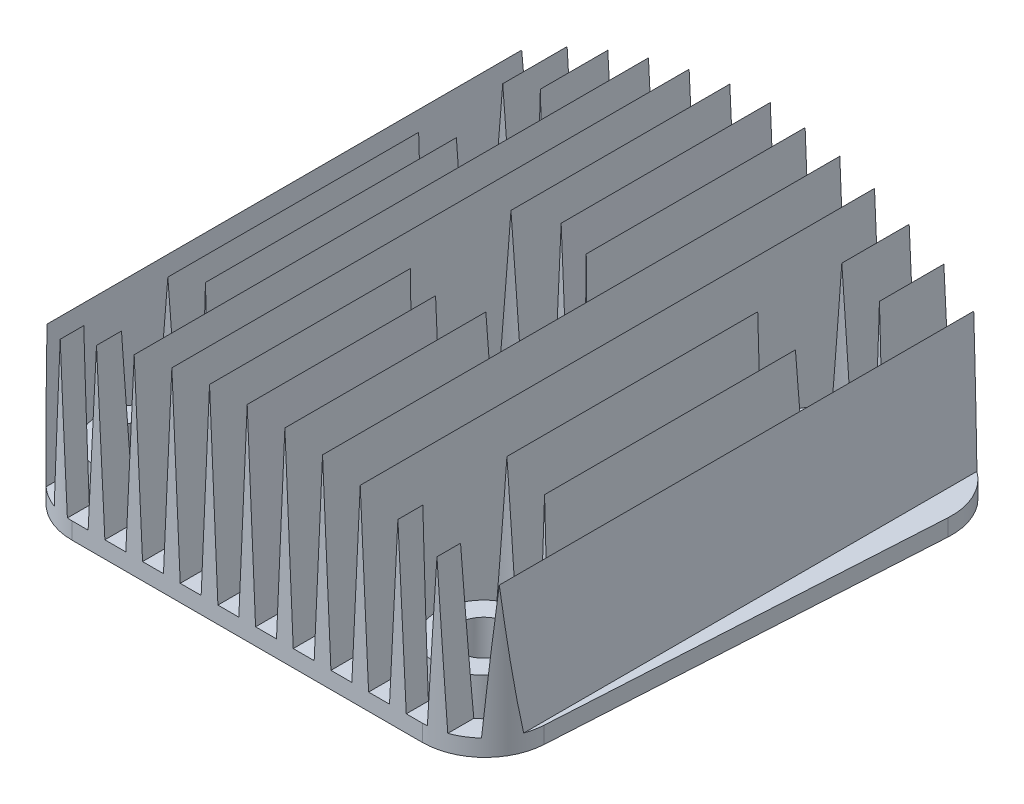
ISO-10303-21;
HEADER;
FILE_DESCRIPTION(('STEP AP214'),'2;1');
FILE_NAME('part.step','',(''),(''),'','','');
FILE_SCHEMA(('AUTOMOTIVE_DESIGN { 1 0 10303 214 1 1 1 1 }'));
ENDSEC;
DATA;
#1=APPLICATION_CONTEXT('core data for automotive mechanical design processes');
#2=APPLICATION_PROTOCOL_DEFINITION('international standard','automotive_design',2000,#1);
#3=PRODUCT_CONTEXT('',#1,'mechanical');
#4=PRODUCT('Part','Part','',(#3));
#5=PRODUCT_RELATED_PRODUCT_CATEGORY('part','',(#4));
#6=PRODUCT_DEFINITION_FORMATION('','',#4);
#7=PRODUCT_DEFINITION_CONTEXT('part definition',#1,'design');
#8=PRODUCT_DEFINITION('design','',#6,#7);
#9=PRODUCT_DEFINITION_SHAPE('','',#8);
#10=(LENGTH_UNIT() NAMED_UNIT(*) SI_UNIT(.MILLI.,.METRE.));
#11=(NAMED_UNIT(*) PLANE_ANGLE_UNIT() SI_UNIT($,.RADIAN.));
#12=(NAMED_UNIT(*) SI_UNIT($,.STERADIAN.) SOLID_ANGLE_UNIT());
#13=UNCERTAINTY_MEASURE_WITH_UNIT(LENGTH_MEASURE(1.E-05),#10,'distance_accuracy_value','');
#14=(GEOMETRIC_REPRESENTATION_CONTEXT(3) GLOBAL_UNCERTAINTY_ASSIGNED_CONTEXT((#13)) GLOBAL_UNIT_ASSIGNED_CONTEXT((#10,
#11,#12)) REPRESENTATION_CONTEXT('',''));
#15=CARTESIAN_POINT('',(0.,0.,0.));
#16=DIRECTION('',(0.,0.,1.));
#17=DIRECTION('',(1.,0.,0.));
#18=AXIS2_PLACEMENT_3D('',#15,#16,#17);
#19=CARTESIAN_POINT('',(-63.,4.,-60.));
#20=DIRECTION('',(0.,-1.,0.));
#21=DIRECTION('',(0.,0.,-1.));
#22=AXIS2_PLACEMENT_3D('',#19,#20,#21);
#23=PLANE('',#22);
#24=CARTESIAN_POINT('',(40.5,4.00000000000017,-36.));
#25=DIRECTION('',(0.,1.,0.));
#26=DIRECTION('',(0.,0.,1.));
#27=AXIS2_PLACEMENT_3D('',#24,#25,#26);
#28=CIRCLE('',#27,11.);
#29=CARTESIAN_POINT('',(34.0104195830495,4.00000000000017,-44.8817422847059));
#30=VERTEX_POINT('',#29);
#31=CARTESIAN_POINT('',(34.0104195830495,4.00000000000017,-27.1182577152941));
#32=VERTEX_POINT('',#31);
#33=EDGE_CURVE('E725',#30,#32,#28,.T.);
#34=ORIENTED_EDGE('',*,*,#33,.F.);
#35=DIRECTION('',(0.,0.,-1.));
#36=VECTOR('',#35,1.);
#37=CARTESIAN_POINT('',(34.0104195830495,4.,65.));
#38=LINE('',#37,#36);
#39=CARTESIAN_POINT('',(34.0104195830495,4.,-62.3007603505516));
#40=VERTEX_POINT('',#39);
#41=EDGE_CURVE('E1013',#30,#40,#38,.T.);
#42=ORIENTED_EDGE('',*,*,#41,.T.);
#43=DIRECTION('',(-0.996865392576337,0.,-0.0791163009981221));
#44=VECTOR('',#43,1.);
#45=CARTESIAN_POINT('',(63.,4.,-60.));
#46=LINE('',#45,#44);
#47=CARTESIAN_POINT('',(29.0104195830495,4.,-62.697585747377));
#48=VERTEX_POINT('',#47);
#49=EDGE_CURVE('E1521',#40,#48,#46,.T.);
#50=ORIENTED_EDGE('',*,*,#49,.T.);
#51=DIRECTION('',(0.,0.,-1.));
#52=VECTOR('',#51,1.);
#53=CARTESIAN_POINT('',(29.0104195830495,4.,65.));
#54=LINE('',#53,#52);
#55=CARTESIAN_POINT('',(29.0104195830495,4.,60.));
#56=VERTEX_POINT('',#55);
#57=EDGE_CURVE('E1021',#56,#48,#54,.T.);
#58=ORIENTED_EDGE('',*,*,#57,.F.);
#59=DIRECTION('',(1.,0.,0.));
#60=VECTOR('',#59,1.);
#61=CARTESIAN_POINT('',(-56.,4.,60.));
#62=LINE('',#61,#60);
#63=CARTESIAN_POINT('',(34.0104195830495,4.,60.));
#64=VERTEX_POINT('',#63);
#65=EDGE_CURVE('E1536',#56,#64,#62,.T.);
#66=ORIENTED_EDGE('',*,*,#65,.T.);
#67=CARTESIAN_POINT('',(34.0104195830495,4.00000000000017,52.8817422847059));
#68=VERTEX_POINT('',#67);
#69=EDGE_CURVE('E1014',#64,#68,#38,.T.);
#70=ORIENTED_EDGE('',*,*,#69,.T.);
#71=CARTESIAN_POINT('',(40.5,4.00000000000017,44.));
#72=DIRECTION('',(0.,1.,0.));
#73=DIRECTION('',(0.,0.,1.));
#74=AXIS2_PLACEMENT_3D('',#71,#72,#73);
#75=CIRCLE('',#74,11.);
#76=CARTESIAN_POINT('',(34.0104195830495,4.00000000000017,35.1182577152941));
#77=VERTEX_POINT('',#76);
#78=EDGE_CURVE('E734',#77,#68,#75,.T.);
#79=ORIENTED_EDGE('',*,*,#78,.F.);
#80=EDGE_CURVE('E1018',#77,#32,#38,.T.);
#81=ORIENTED_EDGE('',*,*,#80,.T.);
#82=EDGE_LOOP('',(#34,#42,#50,#58,#66,#70,#79,#81));
#83=FACE_BOUND('',#82,.T.);
#84=ADVANCED_FACE('F35',(#83),#23,.F.);
#85=CARTESIAN_POINT('',(38.0104195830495,4.,-25.2854309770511));
#86=VERTEX_POINT('',#85);
#87=CARTESIAN_POINT('',(43.0104195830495,4.00000000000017,-25.2902944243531));
#88=VERTEX_POINT('',#87);
#89=EDGE_CURVE('E723',#86,#88,#28,.T.);
#90=ORIENTED_EDGE('',*,*,#89,.F.);
#91=DIRECTION('',(0.,0.,-1.));
#92=VECTOR('',#91,1.);
#93=CARTESIAN_POINT('',(38.0104195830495,4.,65.));
#94=LINE('',#93,#92);
#95=CARTESIAN_POINT('',(38.0104195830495,4.00000000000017,33.2854309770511));
#96=VERTEX_POINT('',#95);
#97=EDGE_CURVE('E694',#96,#86,#94,.T.);
#98=ORIENTED_EDGE('',*,*,#97,.F.);
#99=CARTESIAN_POINT('',(43.0104195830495,4.00000000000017,33.2902944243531));
#100=VERTEX_POINT('',#99);
#101=EDGE_CURVE('E1288',#100,#96,#75,.T.);
#102=ORIENTED_EDGE('',*,*,#101,.F.);
#103=DIRECTION('',(0.,0.,-1.));
#104=VECTOR('',#103,1.);
#105=CARTESIAN_POINT('',(43.0104195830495,4.,65.));
#106=LINE('',#105,#104);
#107=EDGE_CURVE('E1004',#100,#88,#106,.T.);
#108=ORIENTED_EDGE('',*,*,#107,.T.);
#109=EDGE_LOOP('',(#90,#98,#102,#108));
#110=FACE_BOUND('',#109,.T.);
#111=ADVANCED_FACE('F1376',(#110),#23,.F.);
#112=CARTESIAN_POINT('',(47.0104195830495,4.,-27.1335217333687));
#113=VERTEX_POINT('',#112);
#114=CARTESIAN_POINT('',(47.0104195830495,4.00000000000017,-44.8664782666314));
#115=VERTEX_POINT('',#114);
#116=EDGE_CURVE('E705',#113,#115,#28,.T.);
#117=ORIENTED_EDGE('',*,*,#116,.F.);
#118=DIRECTION('',(0.,0.,-1.));
#119=VECTOR('',#118,1.);
#120=CARTESIAN_POINT('',(47.0104195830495,4.,65.));
#121=LINE('',#120,#119);
#122=CARTESIAN_POINT('',(47.0104195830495,4.00000000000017,35.1335217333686));
#123=VERTEX_POINT('',#122);
#124=EDGE_CURVE('E999',#123,#113,#121,.T.);
#125=ORIENTED_EDGE('',*,*,#124,.F.);
#126=CARTESIAN_POINT('',(47.0104195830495,4.,52.8664782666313));
#127=VERTEX_POINT('',#126);
#128=EDGE_CURVE('E735',#127,#123,#75,.T.);
#129=ORIENTED_EDGE('',*,*,#128,.F.);
#130=CARTESIAN_POINT('',(47.0104195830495,4.,59.0842080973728));
#131=VERTEX_POINT('',#130);
#132=EDGE_CURVE('E995',#131,#127,#121,.T.);
#133=ORIENTED_EDGE('',*,*,#132,.F.);
#134=CARTESIAN_POINT('',(41.8495008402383,4.,45.));
#135=DIRECTION('',(0.,-1.,0.));
#136=DIRECTION('',(0.,0.,-1.));
#137=AXIS2_PLACEMENT_3D('',#134,#135,#136);
#138=CIRCLE('',#137,15.);
#139=CARTESIAN_POINT('',(52.0104195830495,4.,56.0342979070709));
#140=VERTEX_POINT('',#139);
#141=EDGE_CURVE('E1202',#131,#140,#138,.F.);
#142=ORIENTED_EDGE('',*,*,#141,.T.);
#143=DIRECTION('',(0.,0.,-1.));
#144=VECTOR('',#143,1.);
#145=CARTESIAN_POINT('',(52.0104195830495,4.,65.));
#146=LINE('',#145,#144);
#147=CARTESIAN_POINT('',(52.0104195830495,4.,-60.4067386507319));
#148=VERTEX_POINT('',#147);
#149=EDGE_CURVE('E986',#140,#148,#146,.T.);
#150=ORIENTED_EDGE('',*,*,#149,.T.);
#151=CARTESIAN_POINT('',(47.1700363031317,4.,-46.2091793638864));
#152=DIRECTION('',(0.,-1.,0.));
#153=DIRECTION('',(0.,0.,-1.));
#154=AXIS2_PLACEMENT_3D('',#151,#152,#153);
#155=CIRCLE('',#154,15.);
#156=CARTESIAN_POINT('',(48.3567808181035,4.,-61.1621602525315));
#157=VERTEX_POINT('',#156);
#158=EDGE_CURVE('E1206',#148,#157,#155,.F.);
#159=ORIENTED_EDGE('',*,*,#158,.T.);
#160=CARTESIAN_POINT('',(47.0104195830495,4.,-61.2690143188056));
#161=VERTEX_POINT('',#160);
#162=EDGE_CURVE('E1154',#157,#161,#46,.T.);
#163=ORIENTED_EDGE('',*,*,#162,.T.);
#164=EDGE_CURVE('E993',#115,#161,#121,.T.);
#165=ORIENTED_EDGE('',*,*,#164,.F.);
#166=EDGE_LOOP('',(#117,#125,#129,#133,#142,#150,#159,#163,#165));
#167=FACE_BOUND('',#166,.T.);
#168=ADVANCED_FACE('F1400',(#167),#23,.F.);
#169=CARTESIAN_POINT('',(43.0104195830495,4.00000000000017,-46.7097055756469));
#170=VERTEX_POINT('',#169);
#171=CARTESIAN_POINT('',(38.0104195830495,4.00000000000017,-46.7145690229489));
#172=VERTEX_POINT('',#171);
#173=EDGE_CURVE('E1380',#170,#172,#28,.T.);
#174=ORIENTED_EDGE('',*,*,#173,.F.);
#175=CARTESIAN_POINT('',(43.0104195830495,4.,-61.5864746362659));
#176=VERTEX_POINT('',#175);
#177=EDGE_CURVE('E998',#170,#176,#106,.T.);
#178=ORIENTED_EDGE('',*,*,#177,.T.);
#179=CARTESIAN_POINT('',(38.0104195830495,4.,-61.9833000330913));
#180=VERTEX_POINT('',#179);
#181=EDGE_CURVE('E1158',#176,#180,#46,.T.);
#182=ORIENTED_EDGE('',*,*,#181,.T.);
#183=EDGE_CURVE('E1008',#172,#180,#94,.T.);
#184=ORIENTED_EDGE('',*,*,#183,.F.);
#185=EDGE_LOOP('',(#174,#178,#182,#184));
#186=FACE_BOUND('',#185,.T.);
#187=ADVANCED_FACE('F1378',(#186),#23,.F.);
#188=CARTESIAN_POINT('',(38.0104195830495,4.,54.7145690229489));
#189=VERTEX_POINT('',#188);
#190=CARTESIAN_POINT('',(43.0104195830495,4.00000000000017,54.7097055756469));
#191=VERTEX_POINT('',#190);
#192=EDGE_CURVE('E719',#189,#191,#75,.T.);
#193=ORIENTED_EDGE('',*,*,#192,.F.);
#194=CARTESIAN_POINT('',(38.0104195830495,4.,60.));
#195=VERTEX_POINT('',#194);
#196=EDGE_CURVE('E1010',#195,#189,#94,.T.);
#197=ORIENTED_EDGE('',*,*,#196,.F.);
#198=CARTESIAN_POINT('',(41.8495008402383,4.,60.));
#199=VERTEX_POINT('',#198);
#200=EDGE_CURVE('E1144',#195,#199,#62,.T.);
#201=ORIENTED_EDGE('',*,*,#200,.T.);
#202=CARTESIAN_POINT('',(43.0104195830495,4.,59.9550081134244));
#203=VERTEX_POINT('',#202);
#204=EDGE_CURVE('E1198',#199,#203,#138,.F.);
#205=ORIENTED_EDGE('',*,*,#204,.T.);
#206=EDGE_CURVE('E1000',#203,#191,#106,.T.);
#207=ORIENTED_EDGE('',*,*,#206,.T.);
#208=EDGE_LOOP('',(#193,#197,#201,#205,#207));
#209=FACE_BOUND('',#208,.T.);
#210=ADVANCED_FACE('F1547',(#209),#23,.F.);
#211=CARTESIAN_POINT('',(-40.5,4.,-36.));
#212=DIRECTION('',(0.,1.,0.));
#213=DIRECTION('',(0.,0.,1.));
#214=AXIS2_PLACEMENT_3D('',#211,#212,#213);
#215=CIRCLE('',#214,11.);
#216=CARTESIAN_POINT('',(-46.9895804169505,4.,-44.8817422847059));
#217=VERTEX_POINT('',#216);
#218=CARTESIAN_POINT('',(-46.9895804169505,4.,-27.1182577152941));
#219=VERTEX_POINT('',#218);
#220=EDGE_CURVE('E743',#217,#219,#215,.T.);
#221=ORIENTED_EDGE('',*,*,#220,.F.);
#222=DIRECTION('',(0.,0.,-1.));
#223=VECTOR('',#222,1.);
#224=CARTESIAN_POINT('',(-46.9895804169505,4.,65.));
#225=LINE('',#224,#223);
#226=CARTESIAN_POINT('',(-46.9895804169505,4.,-61.2706682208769));
#227=VERTEX_POINT('',#226);
#228=EDGE_CURVE('E1114',#217,#227,#225,.T.);
#229=ORIENTED_EDGE('',*,*,#228,.T.);
#230=DIRECTION('',(-0.996865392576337,0.,0.0791163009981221));
#231=VECTOR('',#230,1.);
#232=CARTESIAN_POINT('',(0.,4.,-65.));
#233=LINE('',#232,#231);
#234=CARTESIAN_POINT('',(-48.3567808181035,4.,-61.1621602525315));
#235=VERTEX_POINT('',#234);
#236=EDGE_CURVE('E1157',#227,#235,#233,.T.);
#237=ORIENTED_EDGE('',*,*,#236,.T.);
#238=CARTESIAN_POINT('',(-47.1700363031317,4.,-46.2091793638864));
#239=DIRECTION('',(0.,-1.,0.));
#240=DIRECTION('',(0.,0.,-1.));
#241=AXIS2_PLACEMENT_3D('',#238,#239,#240);
#242=CIRCLE('',#241,15.);
#243=CARTESIAN_POINT('',(-51.9895804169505,4.,-60.413826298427));
#244=VERTEX_POINT('',#243);
#245=EDGE_CURVE('E1212',#235,#244,#242,.F.);
#246=ORIENTED_EDGE('',*,*,#245,.T.);
#247=DIRECTION('',(0.,0.,-1.));
#248=VECTOR('',#247,1.);
#249=CARTESIAN_POINT('',(-51.9895804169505,4.,65.));
#250=LINE('',#249,#248);
#251=CARTESIAN_POINT('',(-51.9895804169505,4.,56.0534513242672));
#252=VERTEX_POINT('',#251);
#253=EDGE_CURVE('E1124',#252,#244,#250,.T.);
#254=ORIENTED_EDGE('',*,*,#253,.F.);
#255=CARTESIAN_POINT('',(-41.8495008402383,4.,45.));
#256=DIRECTION('',(0.,-1.,0.));
#257=DIRECTION('',(0.,0.,-1.));
#258=AXIS2_PLACEMENT_3D('',#255,#256,#257);
#259=CIRCLE('',#258,15.);
#260=CARTESIAN_POINT('',(-46.9895804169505,4.,59.0918267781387));
#261=VERTEX_POINT('',#260);
#262=EDGE_CURVE('E1207',#252,#261,#259,.F.);
#263=ORIENTED_EDGE('',*,*,#262,.T.);
#264=CARTESIAN_POINT('',(-46.9895804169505,4.,52.8817422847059));
#265=VERTEX_POINT('',#264);
#266=EDGE_CURVE('E1116',#261,#265,#225,.T.);
#267=ORIENTED_EDGE('',*,*,#266,.T.);
#268=CARTESIAN_POINT('',(-40.5,4.,44.));
#269=DIRECTION('',(0.,1.,0.));
#270=DIRECTION('',(0.,0.,1.));
#271=AXIS2_PLACEMENT_3D('',#268,#269,#270);
#272=CIRCLE('',#271,11.);
#273=CARTESIAN_POINT('',(-46.9895804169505,4.,35.1182577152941));
#274=VERTEX_POINT('',#273);
#275=EDGE_CURVE('E852',#274,#265,#272,.T.);
#276=ORIENTED_EDGE('',*,*,#275,.F.);
#277=EDGE_CURVE('E1120',#274,#219,#225,.T.);
#278=ORIENTED_EDGE('',*,*,#277,.T.);
#279=EDGE_LOOP('',(#221,#229,#237,#246,#254,#263,#267,#276,#278));
#280=FACE_BOUND('',#279,.T.);
#281=ADVANCED_FACE('F1457',(#280),#23,.F.);
#282=CARTESIAN_POINT('',(-42.9895804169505,4.,-25.2854309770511));
#283=VERTEX_POINT('',#282);
#284=CARTESIAN_POINT('',(-37.9895804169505,4.,-25.2902944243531));
#285=VERTEX_POINT('',#284);
#286=EDGE_CURVE('E729',#283,#285,#215,.T.);
#287=ORIENTED_EDGE('',*,*,#286,.F.);
#288=DIRECTION('',(0.,0.,-1.));
#289=VECTOR('',#288,1.);
#290=CARTESIAN_POINT('',(-42.9895804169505,4.,65.));
#291=LINE('',#290,#289);
#292=CARTESIAN_POINT('',(-42.9895804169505,4.,33.2854309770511));
#293=VERTEX_POINT('',#292);
#294=EDGE_CURVE('E1115',#293,#283,#291,.T.);
#295=ORIENTED_EDGE('',*,*,#294,.F.);
#296=CARTESIAN_POINT('',(-37.9895804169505,4.,33.2902944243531));
#297=VERTEX_POINT('',#296);
#298=EDGE_CURVE('E1845',#297,#293,#272,.T.);
#299=ORIENTED_EDGE('',*,*,#298,.F.);
#300=DIRECTION('',(0.,0.,-1.));
#301=VECTOR('',#300,1.);
#302=CARTESIAN_POINT('',(-37.9895804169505,4.,65.));
#303=LINE('',#302,#301);
#304=EDGE_CURVE('E1105',#297,#285,#303,.T.);
#305=ORIENTED_EDGE('',*,*,#304,.T.);
#306=EDGE_LOOP('',(#287,#295,#299,#305));
#307=FACE_BOUND('',#306,.T.);
#308=ADVANCED_FACE('F1877',(#307),#23,.F.);
#309=CARTESIAN_POINT('',(-33.9895804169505,4.,-27.1335217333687));
#310=VERTEX_POINT('',#309);
#311=CARTESIAN_POINT('',(-33.9895804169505,4.,-44.8664782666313));
#312=VERTEX_POINT('',#311);
#313=EDGE_CURVE('E744',#310,#312,#215,.T.);
#314=ORIENTED_EDGE('',*,*,#313,.F.);
#315=DIRECTION('',(0.,0.,-1.));
#316=VECTOR('',#315,1.);
#317=CARTESIAN_POINT('',(-33.9895804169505,4.,65.));
#318=LINE('',#317,#316);
#319=CARTESIAN_POINT('',(-33.9895804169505,4.,35.1335217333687));
#320=VERTEX_POINT('',#319);
#321=EDGE_CURVE('E1100',#320,#310,#318,.T.);
#322=ORIENTED_EDGE('',*,*,#321,.F.);
#323=CARTESIAN_POINT('',(-33.9895804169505,4.,52.8664782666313));
#324=VERTEX_POINT('',#323);
#325=EDGE_CURVE('E853',#324,#320,#272,.T.);
#326=ORIENTED_EDGE('',*,*,#325,.F.);
#327=CARTESIAN_POINT('',(-33.9895804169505,4.,60.));
#328=VERTEX_POINT('',#327);
#329=EDGE_CURVE('E1096',#328,#324,#318,.T.);
#330=ORIENTED_EDGE('',*,*,#329,.F.);
#331=CARTESIAN_POINT('',(-28.9895804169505,4.,60.));
#332=VERTEX_POINT('',#331);
#333=EDGE_CURVE('E1150',#328,#332,#62,.T.);
#334=ORIENTED_EDGE('',*,*,#333,.T.);
#335=DIRECTION('',(0.,0.,-1.));
#336=VECTOR('',#335,1.);
#337=CARTESIAN_POINT('',(-28.9895804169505,4.,65.));
#338=LINE('',#337,#336);
#339=CARTESIAN_POINT('',(-28.9895804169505,4.,-62.6992396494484));
#340=VERTEX_POINT('',#339);
#341=EDGE_CURVE('E1087',#332,#340,#338,.T.);
#342=ORIENTED_EDGE('',*,*,#341,.T.);
#343=CARTESIAN_POINT('',(-33.9895804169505,4.,-62.302414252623));
#344=VERTEX_POINT('',#343);
#345=EDGE_CURVE('E1444',#340,#344,#233,.T.);
#346=ORIENTED_EDGE('',*,*,#345,.T.);
#347=EDGE_CURVE('E1094',#312,#344,#318,.T.);
#348=ORIENTED_EDGE('',*,*,#347,.F.);
#349=EDGE_LOOP('',(#314,#322,#326,#330,#334,#342,#346,#348));
#350=FACE_BOUND('',#349,.T.);
#351=ADVANCED_FACE('F1750',(#350),#23,.F.);
#352=CARTESIAN_POINT('',(-37.9895804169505,4.,-46.7097055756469));
#353=VERTEX_POINT('',#352);
#354=CARTESIAN_POINT('',(-42.9895804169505,4.,-46.7145690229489));
#355=VERTEX_POINT('',#354);
#356=EDGE_CURVE('E1791',#353,#355,#215,.T.);
#357=ORIENTED_EDGE('',*,*,#356,.F.);
#358=CARTESIAN_POINT('',(-37.9895804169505,4.,-61.9849539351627));
#359=VERTEX_POINT('',#358);
#360=EDGE_CURVE('E1099',#353,#359,#303,.T.);
#361=ORIENTED_EDGE('',*,*,#360,.T.);
#362=CARTESIAN_POINT('',(-42.9895804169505,4.,-61.5881285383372));
#363=VERTEX_POINT('',#362);
#364=EDGE_CURVE('E1447',#359,#363,#233,.T.);
#365=ORIENTED_EDGE('',*,*,#364,.T.);
#366=EDGE_CURVE('E1109',#355,#363,#291,.T.);
#367=ORIENTED_EDGE('',*,*,#366,.F.);
#368=EDGE_LOOP('',(#357,#361,#365,#367));
#369=FACE_BOUND('',#368,.T.);
#370=ADVANCED_FACE('F1878',(#369),#23,.F.);
#371=CARTESIAN_POINT('',(36.0104195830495,43.2165265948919,65.));
#372=DIRECTION('',(0.998702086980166,-0.0509327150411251,0.));
#373=DIRECTION('',(0.0509327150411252,0.998702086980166,0.));
#374=AXIS2_PLACEMENT_3D('',#371,#372,#373);
#375=PLANE('',#374);
#376=CARTESIAN_POINT('',(40.5,131.249401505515,-36.));
#377=DIRECTION('',(0.998702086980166,-0.0509327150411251,0.));
#378=DIRECTION('',(-0.0509327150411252,-0.998702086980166,0.));
#379=AXIS2_PLACEMENT_3D('',#376,#377,#378);
#380=ELLIPSE('',#379,215.971208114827,11.);
#381=CARTESIAN_POINT('',(34.4694097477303,13.0000000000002,-26.8004358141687));
#382=VERTEX_POINT('',#381);
#383=EDGE_CURVE('E751',#32,#382,#380,.F.);
#384=ORIENTED_EDGE('',*,*,#383,.F.);
#385=ORIENTED_EDGE('',*,*,#80,.F.);
#386=CARTESIAN_POINT('',(40.5,131.249401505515,44.));
#387=DIRECTION('',(0.998702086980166,-0.0509327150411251,0.));
#388=DIRECTION('',(-0.0509327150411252,-0.998702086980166,0.));
#389=AXIS2_PLACEMENT_3D('',#386,#387,#388);
#390=ELLIPSE('',#389,215.971208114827,11.);
#391=CARTESIAN_POINT('',(34.4694097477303,13.0000000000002,34.8004358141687));
#392=VERTEX_POINT('',#391);
#393=EDGE_CURVE('E775',#392,#77,#390,.F.);
#394=ORIENTED_EDGE('',*,*,#393,.F.);
#395=CARTESIAN_POINT('',(36.0104195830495,43.2165265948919,33.9579052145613));
#396=VERTEX_POINT('',#395);
#397=EDGE_CURVE('E776',#396,#392,#390,.F.);
#398=ORIENTED_EDGE('',*,*,#397,.F.);
#399=DIRECTION('',(0.,0.,-1.));
#400=VECTOR('',#399,1.);
#401=CARTESIAN_POINT('',(36.0104195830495,43.2165265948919,65.));
#402=LINE('',#401,#400);
#403=CARTESIAN_POINT('',(36.0104195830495,43.2165265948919,-25.9579052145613));
#404=VERTEX_POINT('',#403);
#405=EDGE_CURVE('E1009',#396,#404,#402,.T.);
#406=ORIENTED_EDGE('',*,*,#405,.T.);
#407=EDGE_CURVE('E681',#382,#404,#380,.F.);
#408=ORIENTED_EDGE('',*,*,#407,.F.);
#409=EDGE_LOOP('',(#384,#385,#394,#398,#406,#408));
#410=FACE_BOUND('',#409,.T.);
#411=ADVANCED_FACE('F1332',(#410),#375,.F.);
#412=CARTESIAN_POINT('',(36.0104195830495,43.2165265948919,-46.0420947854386));
#413=VERTEX_POINT('',#412);
#414=CARTESIAN_POINT('',(34.4694097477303,13.0000000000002,-45.1995641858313));
#415=VERTEX_POINT('',#414);
#416=EDGE_CURVE('E754',#413,#415,#380,.F.);
#417=ORIENTED_EDGE('',*,*,#416,.F.);
#418=CARTESIAN_POINT('',(36.0104195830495,43.2165265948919,-62.1420301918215));
#419=VERTEX_POINT('',#418);
#420=EDGE_CURVE('E1003',#413,#419,#402,.T.);
#421=ORIENTED_EDGE('',*,*,#420,.T.);
#422=DIRECTION('',(0.0509322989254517,0.998693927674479,0.00404224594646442));
#423=VECTOR('',#422,1.);
#424=CARTESIAN_POINT('',(36.0365956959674,43.72979470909,-62.1399527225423));
#425=LINE('',#424,#423);
#426=EDGE_CURVE('E889',#40,#419,#425,.T.);
#427=ORIENTED_EDGE('',*,*,#426,.F.);
#428=ORIENTED_EDGE('',*,*,#41,.F.);
#429=EDGE_CURVE('E753',#415,#30,#380,.F.);
#430=ORIENTED_EDGE('',*,*,#429,.F.);
#431=EDGE_LOOP('',(#417,#421,#427,#428,#430));
#432=FACE_BOUND('',#431,.T.);
#433=ADVANCED_FACE('F1325',(#432),#375,.F.);
#434=CARTESIAN_POINT('',(38.0104195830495,4.,65.));
#435=DIRECTION('',(-0.998702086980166,-0.0509327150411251,0.));
#436=DIRECTION('',(0.0509327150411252,-0.998702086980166,0.));
#437=AXIS2_PLACEMENT_3D('',#434,#435,#436);
#438=PLANE('',#437);
#439=CARTESIAN_POINT('',(40.5,-44.8163483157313,-36.));
#440=DIRECTION('',(-0.998702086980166,-0.0509327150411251,0.));
#441=DIRECTION('',(0.0509327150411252,-0.998702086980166,0.));
#442=AXIS2_PLACEMENT_3D('',#439,#440,#441);
#443=ELLIPSE('',#442,215.971208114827,11.);
#444=CARTESIAN_POINT('',(37.5514294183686,13.0000000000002,-46.5974492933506));
#445=VERTEX_POINT('',#444);
#446=EDGE_CURVE('E688',#172,#445,#443,.F.);
#447=ORIENTED_EDGE('',*,*,#446,.F.);
#448=ORIENTED_EDGE('',*,*,#183,.T.);
#449=DIRECTION('',(0.0509322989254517,-0.998693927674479,0.00404224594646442));
#450=VECTOR('',#449,1.);
#451=CARTESIAN_POINT('',(38.0365630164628,3.48737267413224,-61.9812251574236));
#452=LINE('',#451,#450);
#453=EDGE_CURVE('E886',#419,#180,#452,.T.);
#454=ORIENTED_EDGE('',*,*,#453,.F.);
#455=ORIENTED_EDGE('',*,*,#420,.F.);
#456=EDGE_CURVE('E687',#445,#413,#443,.F.);
#457=ORIENTED_EDGE('',*,*,#456,.F.);
#458=EDGE_LOOP('',(#447,#448,#454,#455,#457));
#459=FACE_BOUND('',#458,.T.);
#460=ADVANCED_FACE('F1329',(#459),#438,.F.);
#461=CARTESIAN_POINT('',(37.5514294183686,13.0000000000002,-25.4025507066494));
#462=VERTEX_POINT('',#461);
#463=EDGE_CURVE('E677',#404,#462,#443,.F.);
#464=ORIENTED_EDGE('',*,*,#463,.F.);
#465=ORIENTED_EDGE('',*,*,#405,.F.);
#466=CARTESIAN_POINT('',(40.5,-44.8163483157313,44.));
#467=DIRECTION('',(-0.998702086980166,-0.0509327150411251,0.));
#468=DIRECTION('',(0.0509327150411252,-0.998702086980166,0.));
#469=AXIS2_PLACEMENT_3D('',#466,#467,#468);
#470=ELLIPSE('',#469,215.971208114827,11.);
#471=CARTESIAN_POINT('',(37.5514294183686,13.0000000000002,33.4025507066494));
#472=VERTEX_POINT('',#471);
#473=EDGE_CURVE('E770',#472,#396,#470,.F.);
#474=ORIENTED_EDGE('',*,*,#473,.F.);
#475=EDGE_CURVE('E771',#96,#472,#470,.F.);
#476=ORIENTED_EDGE('',*,*,#475,.F.);
#477=ORIENTED_EDGE('',*,*,#97,.T.);
#478=EDGE_CURVE('E685',#462,#86,#443,.F.);
#479=ORIENTED_EDGE('',*,*,#478,.F.);
#480=EDGE_LOOP('',(#464,#465,#474,#476,#477,#479));
#481=FACE_BOUND('',#480,.T.);
#482=ADVANCED_FACE('F692',(#481),#438,.F.);
#483=CARTESIAN_POINT('',(45.0104195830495,39.8256213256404,65.));
#484=DIRECTION('',(0.998445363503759,-0.0557391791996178,0.));
#485=DIRECTION('',(0.0557391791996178,0.998445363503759,0.));
#486=AXIS2_PLACEMENT_3D('',#483,#484,#485);
#487=PLANE('',#486);
#488=CARTESIAN_POINT('',(40.5,-40.9686706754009,-36.));
#489=DIRECTION('',(0.998445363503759,-0.0557391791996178,0.));
#490=DIRECTION('',(-0.0557391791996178,-0.998445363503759,0.));
#491=AXIS2_PLACEMENT_3D('',#488,#489,#490);
#492=ELLIPSE('',#491,197.347721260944,11.);
#493=CARTESIAN_POINT('',(43.5128532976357,13.0000000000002,-25.4206467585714));
#494=VERTEX_POINT('',#493);
#495=EDGE_CURVE('E702',#88,#494,#492,.F.);
#496=ORIENTED_EDGE('',*,*,#495,.F.);
#497=ORIENTED_EDGE('',*,*,#107,.F.);
#498=CARTESIAN_POINT('',(40.5,-40.9686706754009,44.));
#499=DIRECTION('',(0.998445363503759,-0.0557391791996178,0.));
#500=DIRECTION('',(-0.0557391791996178,-0.998445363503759,0.));
#501=AXIS2_PLACEMENT_3D('',#498,#499,#500);
#502=ELLIPSE('',#501,197.347721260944,11.);
#503=CARTESIAN_POINT('',(43.5128532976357,13.0000000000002,33.4206467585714));
#504=VERTEX_POINT('',#503);
#505=EDGE_CURVE('E1308',#504,#100,#502,.F.);
#506=ORIENTED_EDGE('',*,*,#505,.F.);
#507=CARTESIAN_POINT('',(45.0104195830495,39.8256213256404,33.9672478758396));
#508=VERTEX_POINT('',#507);
#509=EDGE_CURVE('E765',#508,#504,#502,.F.);
#510=ORIENTED_EDGE('',*,*,#509,.F.);
#511=DIRECTION('',(0.,0.,-1.));
#512=VECTOR('',#511,1.);
#513=CARTESIAN_POINT('',(45.0104195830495,39.8256213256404,65.));
#514=LINE('',#513,#512);
#515=CARTESIAN_POINT('',(45.0104195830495,39.8256213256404,-25.9672478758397));
#516=VERTEX_POINT('',#515);
#517=EDGE_CURVE('E994',#508,#516,#514,.T.);
#518=ORIENTED_EDGE('',*,*,#517,.T.);
#519=EDGE_CURVE('E747',#494,#516,#492,.F.);
#520=ORIENTED_EDGE('',*,*,#519,.F.);
#521=EDGE_LOOP('',(#496,#497,#506,#510,#518,#520));
#522=FACE_BOUND('',#521,.T.);
#523=ADVANCED_FACE('F1343',(#522),#487,.F.);
#524=CARTESIAN_POINT('',(45.0104195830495,39.8256213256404,-46.0327521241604));
#525=VERTEX_POINT('',#524);
#526=CARTESIAN_POINT('',(43.5128532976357,13.0000000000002,-46.5793532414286));
#527=VERTEX_POINT('',#526);
#528=EDGE_CURVE('E697',#525,#527,#492,.F.);
#529=ORIENTED_EDGE('',*,*,#528,.F.);
#530=CARTESIAN_POINT('',(45.0104195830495,39.8256213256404,-61.4277444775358));
#531=VERTEX_POINT('',#530);
#532=EDGE_CURVE('E989',#525,#531,#514,.T.);
#533=ORIENTED_EDGE('',*,*,#532,.T.);
#534=DIRECTION('',(0.055738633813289,0.998435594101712,0.00442370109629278));
#535=VECTOR('',#534,1.);
#536=CARTESIAN_POINT('',(45.0415930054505,40.3840249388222,-61.4252703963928));
#537=LINE('',#536,#535);
#538=EDGE_CURVE('E883',#176,#531,#537,.T.);
#539=ORIENTED_EDGE('',*,*,#538,.F.);
#540=ORIENTED_EDGE('',*,*,#177,.F.);
#541=EDGE_CURVE('E1371',#527,#170,#492,.F.);
#542=ORIENTED_EDGE('',*,*,#541,.F.);
#543=EDGE_LOOP('',(#529,#533,#539,#540,#542));
#544=FACE_BOUND('',#543,.T.);
#545=ADVANCED_FACE('F1350',(#544),#487,.F.);
#546=CARTESIAN_POINT('',(47.0104195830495,4.,65.));
#547=DIRECTION('',(-0.998445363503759,-0.0557391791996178,0.));
#548=DIRECTION('',(0.0557391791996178,-0.998445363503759,0.));
#549=AXIS2_PLACEMENT_3D('',#546,#547,#548);
#550=PLANE('',#549);
#551=CARTESIAN_POINT('',(40.5,120.619913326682,-36.));
#552=DIRECTION('',(-0.998445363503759,-0.0557391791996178,0.));
#553=DIRECTION('',(0.0557391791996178,-0.998445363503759,0.));
#554=AXIS2_PLACEMENT_3D('',#551,#552,#553);
#555=ELLIPSE('',#554,197.347721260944,11.);
#556=CARTESIAN_POINT('',(46.5079858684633,13.0000000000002,-45.2143423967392));
#557=VERTEX_POINT('',#556);
#558=EDGE_CURVE('E748',#115,#557,#555,.F.);
#559=ORIENTED_EDGE('',*,*,#558,.F.);
#560=ORIENTED_EDGE('',*,*,#164,.T.);
#561=DIRECTION('',(0.055738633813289,-0.998435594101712,0.00442370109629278));
#562=VECTOR('',#561,1.);
#563=CARTESIAN_POINT('',(47.0415538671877,3.44229746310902,-61.266543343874));
#564=LINE('',#563,#562);
#565=EDGE_CURVE('E1233',#531,#161,#564,.T.);
#566=ORIENTED_EDGE('',*,*,#565,.F.);
#567=ORIENTED_EDGE('',*,*,#532,.F.);
#568=EDGE_CURVE('E749',#557,#525,#555,.F.);
#569=ORIENTED_EDGE('',*,*,#568,.F.);
#570=EDGE_LOOP('',(#559,#560,#566,#567,#569));
#571=FACE_BOUND('',#570,.T.);
#572=ADVANCED_FACE('F1361',(#571),#550,.F.);
#573=CARTESIAN_POINT('',(46.5079858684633,13.0000000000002,-26.7856576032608));
#574=VERTEX_POINT('',#573);
#575=EDGE_CURVE('E745',#516,#574,#555,.F.);
#576=ORIENTED_EDGE('',*,*,#575,.F.);
#577=ORIENTED_EDGE('',*,*,#517,.F.);
#578=CARTESIAN_POINT('',(40.5,120.619913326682,44.));
#579=DIRECTION('',(-0.998445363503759,-0.0557391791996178,0.));
#580=DIRECTION('',(0.0557391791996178,-0.998445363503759,0.));
#581=AXIS2_PLACEMENT_3D('',#578,#579,#580);
#582=ELLIPSE('',#581,197.347721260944,11.);
#583=CARTESIAN_POINT('',(46.5079858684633,13.0000000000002,34.7856576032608));
#584=VERTEX_POINT('',#583);
#585=EDGE_CURVE('E764',#584,#508,#582,.F.);
#586=ORIENTED_EDGE('',*,*,#585,.F.);
#587=EDGE_CURVE('E760',#123,#584,#582,.F.);
#588=ORIENTED_EDGE('',*,*,#587,.F.);
#589=ORIENTED_EDGE('',*,*,#124,.T.);
#590=EDGE_CURVE('E50',#574,#113,#555,.F.);
#591=ORIENTED_EDGE('',*,*,#590,.F.);
#592=EDGE_LOOP('',(#576,#577,#586,#588,#589,#591));
#593=FACE_BOUND('',#592,.T.);
#594=ADVANCED_FACE('F1345',(#593),#550,.F.);
#595=CARTESIAN_POINT('',(34.4694097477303,13.0000000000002,53.1995641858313));
#596=VERTEX_POINT('',#595);
#597=EDGE_CURVE('E772',#68,#596,#390,.F.);
#598=ORIENTED_EDGE('',*,*,#597,.F.);
#599=ORIENTED_EDGE('',*,*,#69,.F.);
#600=DIRECTION('',(-0.0509327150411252,-0.998702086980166,0.));
#601=VECTOR('',#600,1.);
#602=CARTESIAN_POINT('',(36.0104195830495,43.2165265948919,60.));
#603=LINE('',#602,#601);
#604=CARTESIAN_POINT('',(36.0104195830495,43.2165265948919,60.));
#605=VERTEX_POINT('',#604);
#606=EDGE_CURVE('E909',#605,#64,#603,.T.);
#607=ORIENTED_EDGE('',*,*,#606,.F.);
#608=CARTESIAN_POINT('',(36.0104195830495,43.2165265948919,54.0420947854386));
#609=VERTEX_POINT('',#608);
#610=EDGE_CURVE('E1005',#605,#609,#402,.T.);
#611=ORIENTED_EDGE('',*,*,#610,.T.);
#612=EDGE_CURVE('E768',#596,#609,#390,.F.);
#613=ORIENTED_EDGE('',*,*,#612,.F.);
#614=EDGE_LOOP('',(#598,#599,#607,#611,#613));
#615=FACE_BOUND('',#614,.T.);
#616=ADVANCED_FACE('F1277',(#615),#375,.F.);
#617=CARTESIAN_POINT('',(37.5514294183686,13.0000000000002,54.5974492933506));
#618=VERTEX_POINT('',#617);
#619=EDGE_CURVE('E766',#609,#618,#470,.F.);
#620=ORIENTED_EDGE('',*,*,#619,.F.);
#621=ORIENTED_EDGE('',*,*,#610,.F.);
#622=DIRECTION('',(-0.0509327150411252,0.998702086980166,0.));
#623=VECTOR('',#622,1.);
#624=CARTESIAN_POINT('',(38.0104195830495,4.,60.));
#625=LINE('',#624,#623);
#626=EDGE_CURVE('E1236',#195,#605,#625,.T.);
#627=ORIENTED_EDGE('',*,*,#626,.F.);
#628=ORIENTED_EDGE('',*,*,#196,.T.);
#629=EDGE_CURVE('E769',#618,#189,#470,.F.);
#630=ORIENTED_EDGE('',*,*,#629,.F.);
#631=EDGE_LOOP('',(#620,#621,#627,#628,#630));
#632=FACE_BOUND('',#631,.T.);
#633=ADVANCED_FACE('F1565',(#632),#438,.F.);
#634=CARTESIAN_POINT('',(43.5128532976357,13.0000000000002,54.5793532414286));
#635=VERTEX_POINT('',#634);
#636=EDGE_CURVE('E761',#191,#635,#502,.F.);
#637=ORIENTED_EDGE('',*,*,#636,.F.);
#638=ORIENTED_EDGE('',*,*,#206,.F.);
#639=CARTESIAN_POINT('',(41.8495008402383,-16.7953176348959,45.));
#640=DIRECTION('',(0.998445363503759,-0.0557391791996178,0.));
#641=DIRECTION('',(-0.0557391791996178,-0.998445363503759,0.));
#642=AXIS2_PLACEMENT_3D('',#639,#640,#641);
#643=ELLIPSE('',#642,269.110528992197,15.);
#644=CARTESIAN_POINT('',(45.0104195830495,39.8256213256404,59.6631713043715));
#645=VERTEX_POINT('',#644);
#646=EDGE_CURVE('E881',#645,#203,#643,.T.);
#647=ORIENTED_EDGE('',*,*,#646,.F.);
#648=CARTESIAN_POINT('',(45.0104195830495,39.8256213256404,54.0327521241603));
#649=VERTEX_POINT('',#648);
#650=EDGE_CURVE('E990',#645,#649,#514,.T.);
#651=ORIENTED_EDGE('',*,*,#650,.T.);
#652=EDGE_CURVE('E758',#635,#649,#502,.F.);
#653=ORIENTED_EDGE('',*,*,#652,.F.);
#654=EDGE_LOOP('',(#637,#638,#647,#651,#653));
#655=FACE_BOUND('',#654,.T.);
#656=ADVANCED_FACE('F1556',(#655),#487,.F.);
#657=CARTESIAN_POINT('',(46.5079858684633,13.0000000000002,53.2143423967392));
#658=VERTEX_POINT('',#657);
#659=EDGE_CURVE('E755',#649,#658,#582,.F.);
#660=ORIENTED_EDGE('',*,*,#659,.F.);
#661=ORIENTED_EDGE('',*,*,#650,.F.);
#662=CARTESIAN_POINT('',(41.8495008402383,96.4465602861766,45.));
#663=DIRECTION('',(-0.998445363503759,-0.0557391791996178,0.));
#664=DIRECTION('',(0.0557391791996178,-0.998445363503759,0.));
#665=AXIS2_PLACEMENT_3D('',#662,#663,#664);
#666=ELLIPSE('',#665,269.110528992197,15.);
#667=EDGE_CURVE('E879',#131,#645,#666,.T.);
#668=ORIENTED_EDGE('',*,*,#667,.F.);
#669=ORIENTED_EDGE('',*,*,#132,.T.);
#670=EDGE_CURVE('E759',#658,#127,#582,.F.);
#671=ORIENTED_EDGE('',*,*,#670,.F.);
#672=EDGE_LOOP('',(#660,#661,#668,#669,#671));
#673=FACE_BOUND('',#672,.T.);
#674=ADVANCED_FACE('F1560',(#673),#550,.F.);
#675=CARTESIAN_POINT('',(-44.9895804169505,39.8344823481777,65.));
#676=DIRECTION('',(0.998446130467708,-0.0557254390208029,0.));
#677=DIRECTION('',(0.055725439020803,0.998446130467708,0.));
#678=AXIS2_PLACEMENT_3D('',#675,#676,#677);
#679=PLANE('',#678);
#680=CARTESIAN_POINT('',(-40.5,120.275377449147,-36.));
#681=DIRECTION('',(0.998446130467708,-0.0557254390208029,0.));
#682=DIRECTION('',(-0.055725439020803,-0.998446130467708,0.));
#683=AXIS2_PLACEMENT_3D('',#680,#681,#682);
#684=ELLIPSE('',#683,197.396381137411,11.);
#685=CARTESIAN_POINT('',(-46.487270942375,13.,-26.7721840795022));
#686=VERTEX_POINT('',#685);
#687=EDGE_CURVE('E789',#219,#686,#684,.F.);
#688=ORIENTED_EDGE('',*,*,#687,.F.);
#689=ORIENTED_EDGE('',*,*,#277,.F.);
#690=CARTESIAN_POINT('',(-40.5,120.275377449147,44.));
#691=DIRECTION('',(0.998446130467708,-0.0557254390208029,0.));
#692=DIRECTION('',(-0.055725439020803,-0.998446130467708,0.));
#693=AXIS2_PLACEMENT_3D('',#690,#691,#692);
#694=ELLIPSE('',#693,197.396381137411,11.);
#695=CARTESIAN_POINT('',(-46.487270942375,13.,34.7721840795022));
#696=VERTEX_POINT('',#695);
#697=EDGE_CURVE('E873',#696,#274,#694,.F.);
#698=ORIENTED_EDGE('',*,*,#697,.F.);
#699=CARTESIAN_POINT('',(-44.9895804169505,39.8344823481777,33.9579052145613));
#700=VERTEX_POINT('',#699);
#701=EDGE_CURVE('E874',#700,#696,#694,.F.);
#702=ORIENTED_EDGE('',*,*,#701,.F.);
#703=DIRECTION('',(0.,0.,-1.));
#704=VECTOR('',#703,1.);
#705=CARTESIAN_POINT('',(-44.9895804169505,39.8344823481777,65.));
#706=LINE('',#705,#704);
#707=CARTESIAN_POINT('',(-44.9895804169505,39.8344823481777,-25.9579052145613));
#708=VERTEX_POINT('',#707);
#709=EDGE_CURVE('E1110',#700,#708,#706,.T.);
#710=ORIENTED_EDGE('',*,*,#709,.T.);
#711=EDGE_CURVE('E785',#686,#708,#684,.F.);
#712=ORIENTED_EDGE('',*,*,#711,.F.);
#713=EDGE_LOOP('',(#688,#689,#698,#702,#710,#712));
#714=FACE_BOUND('',#713,.T.);
#715=ADVANCED_FACE('F1828',(#714),#679,.F.);
#716=CARTESIAN_POINT('',(-44.9895804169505,39.8344823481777,-46.0420947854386));
#717=VERTEX_POINT('',#716);
#718=CARTESIAN_POINT('',(-46.487270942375,13.,-45.2278159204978));
#719=VERTEX_POINT('',#718);
#720=EDGE_CURVE('E793',#717,#719,#684,.F.);
#721=ORIENTED_EDGE('',*,*,#720,.F.);
#722=CARTESIAN_POINT('',(-44.9895804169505,39.8344823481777,-61.4293983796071));
#723=VERTEX_POINT('',#722);
#724=EDGE_CURVE('E1104',#717,#723,#706,.T.);
#725=ORIENTED_EDGE('',*,*,#724,.T.);
#726=DIRECTION('',(0.0557248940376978,0.998436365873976,-0.00442261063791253));
#727=VECTOR('',#726,1.);
#728=CARTESIAN_POINT('',(-45.0207388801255,39.276208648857,-61.4269254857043));
#729=LINE('',#728,#727);
#730=EDGE_CURVE('E969',#227,#723,#729,.T.);
#731=ORIENTED_EDGE('',*,*,#730,.F.);
#732=ORIENTED_EDGE('',*,*,#228,.F.);
#733=EDGE_CURVE('E792',#719,#217,#684,.F.);
#734=ORIENTED_EDGE('',*,*,#733,.F.);
#735=EDGE_LOOP('',(#721,#725,#731,#732,#734));
#736=FACE_BOUND('',#735,.T.);
#737=ADVANCED_FACE('F1802',(#736),#679,.F.);
#738=CARTESIAN_POINT('',(-42.9895804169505,4.,65.));
#739=DIRECTION('',(-0.998446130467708,-0.0557254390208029,0.));
#740=DIRECTION('',(0.055725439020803,-0.998446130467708,0.));
#741=AXIS2_PLACEMENT_3D('',#738,#739,#740);
#742=PLANE('',#741);
#743=CARTESIAN_POINT('',(-40.5,-40.6064127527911,-36.));
#744=DIRECTION('',(-0.998446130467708,-0.0557254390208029,0.));
#745=DIRECTION('',(0.055725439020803,-0.998446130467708,0.));
#746=AXIS2_PLACEMENT_3D('',#743,#744,#745);
#747=ELLIPSE('',#746,197.396381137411,11.);
#748=CARTESIAN_POINT('',(-43.4918898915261,13.,-46.5853008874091));
#749=VERTEX_POINT('',#748);
#750=EDGE_CURVE('E788',#355,#749,#747,.F.);
#751=ORIENTED_EDGE('',*,*,#750,.F.);
#752=ORIENTED_EDGE('',*,*,#366,.T.);
#753=DIRECTION('',(0.0557248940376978,-0.998436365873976,-0.00442261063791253));
#754=VECTOR('',#753,1.);
#755=CARTESIAN_POINT('',(-43.0207779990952,4.55897460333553,-61.5856525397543));
#756=LINE('',#755,#754);
#757=EDGE_CURVE('E966',#723,#363,#756,.T.);
#758=ORIENTED_EDGE('',*,*,#757,.F.);
#759=ORIENTED_EDGE('',*,*,#724,.F.);
#760=EDGE_CURVE('E787',#749,#717,#747,.F.);
#761=ORIENTED_EDGE('',*,*,#760,.F.);
#762=EDGE_LOOP('',(#751,#752,#758,#759,#761));
#763=FACE_BOUND('',#762,.T.);
#764=ADVANCED_FACE('F1807',(#763),#742,.F.);
#765=CARTESIAN_POINT('',(-43.4918898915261,13.,-25.4146991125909));
#766=VERTEX_POINT('',#765);
#767=EDGE_CURVE('E783',#708,#766,#747,.F.);
#768=ORIENTED_EDGE('',*,*,#767,.F.);
#769=ORIENTED_EDGE('',*,*,#709,.F.);
#770=CARTESIAN_POINT('',(-40.5,-40.6064127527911,44.));
#771=DIRECTION('',(-0.998446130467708,-0.0557254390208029,0.));
#772=DIRECTION('',(0.055725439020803,-0.998446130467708,0.));
#773=AXIS2_PLACEMENT_3D('',#770,#771,#772);
#774=ELLIPSE('',#773,197.396381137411,11.);
#775=CARTESIAN_POINT('',(-43.4918898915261,13.,33.4146991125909));
#776=VERTEX_POINT('',#775);
#777=EDGE_CURVE('E868',#776,#700,#774,.F.);
#778=ORIENTED_EDGE('',*,*,#777,.F.);
#779=EDGE_CURVE('E869',#293,#776,#774,.F.);
#780=ORIENTED_EDGE('',*,*,#779,.F.);
#781=ORIENTED_EDGE('',*,*,#294,.T.);
#782=EDGE_CURVE('E786',#766,#283,#747,.F.);
#783=ORIENTED_EDGE('',*,*,#782,.F.);
#784=EDGE_LOOP('',(#768,#769,#778,#780,#781,#783));
#785=FACE_BOUND('',#784,.T.);
#786=ADVANCED_FACE('F1815',(#785),#742,.F.);
#787=CARTESIAN_POINT('',(-35.9895804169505,43.2233953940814,65.));
#788=DIRECTION('',(0.998702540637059,-0.0509238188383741,0.));
#789=DIRECTION('',(0.0509238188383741,0.998702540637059,0.));
#790=AXIS2_PLACEMENT_3D('',#787,#788,#789);
#791=PLANE('',#790);
#792=CARTESIAN_POINT('',(-40.5,-45.2335899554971,-36.));
#793=DIRECTION('',(0.998702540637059,-0.0509238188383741,0.));
#794=DIRECTION('',(-0.0509238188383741,-0.998702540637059,0.));
#795=AXIS2_PLACEMENT_3D('',#792,#793,#794);
#796=ELLIPSE('',#795,216.008937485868,11.);
#797=CARTESIAN_POINT('',(-37.5306706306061,13.,-25.4083484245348));
#798=VERTEX_POINT('',#797);
#799=EDGE_CURVE('E777',#285,#798,#796,.F.);
#800=ORIENTED_EDGE('',*,*,#799,.F.);
#801=ORIENTED_EDGE('',*,*,#304,.F.);
#802=CARTESIAN_POINT('',(-40.5,-45.2335899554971,44.));
#803=DIRECTION('',(0.998702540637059,-0.0509238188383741,0.));
#804=DIRECTION('',(-0.0509238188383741,-0.998702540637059,0.));
#805=AXIS2_PLACEMENT_3D('',#802,#803,#804);
#806=ELLIPSE('',#805,216.008937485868,11.);
#807=CARTESIAN_POINT('',(-37.5306706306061,13.,33.4083484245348));
#808=VERTEX_POINT('',#807);
#809=EDGE_CURVE('E1862',#808,#297,#806,.F.);
#810=ORIENTED_EDGE('',*,*,#809,.F.);
#811=CARTESIAN_POINT('',(-35.9895804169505,43.2233953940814,33.9672478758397));
#812=VERTEX_POINT('',#811);
#813=EDGE_CURVE('E863',#812,#808,#806,.F.);
#814=ORIENTED_EDGE('',*,*,#813,.F.);
#815=DIRECTION('',(0.,0.,-1.));
#816=VECTOR('',#815,1.);
#817=CARTESIAN_POINT('',(-35.9895804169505,43.2233953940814,65.));
#818=LINE('',#817,#816);
#819=CARTESIAN_POINT('',(-35.9895804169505,43.2233953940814,-25.9672478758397));
#820=VERTEX_POINT('',#819);
#821=EDGE_CURVE('E1095',#812,#820,#818,.T.);
#822=ORIENTED_EDGE('',*,*,#821,.T.);
#823=EDGE_CURVE('E781',#798,#820,#796,.F.);
#824=ORIENTED_EDGE('',*,*,#823,.F.);
#825=EDGE_LOOP('',(#800,#801,#810,#814,#822,#824));
#826=FACE_BOUND('',#825,.T.);
#827=ADVANCED_FACE('F1869',(#826),#791,.F.);
#828=CARTESIAN_POINT('',(-35.9895804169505,43.2233953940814,-46.0327521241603));
#829=VERTEX_POINT('',#828);
#830=CARTESIAN_POINT('',(-37.5306706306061,13.,-46.5916515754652));
#831=VERTEX_POINT('',#830);
#832=EDGE_CURVE('E782',#829,#831,#796,.F.);
#833=ORIENTED_EDGE('',*,*,#832,.F.);
#834=CARTESIAN_POINT('',(-35.9895804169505,43.2233953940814,-62.1436840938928));
#835=VERTEX_POINT('',#834);
#836=EDGE_CURVE('E1090',#829,#835,#818,.T.);
#837=ORIENTED_EDGE('',*,*,#836,.T.);
#838=DIRECTION('',(0.0509234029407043,0.998694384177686,-0.00404153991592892));
#839=VECTOR('',#838,1.);
#840=CARTESIAN_POINT('',(-36.0157477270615,42.7102100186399,-62.1416073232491));
#841=LINE('',#840,#839);
#842=EDGE_CURVE('E963',#359,#835,#841,.T.);
#843=ORIENTED_EDGE('',*,*,#842,.F.);
#844=ORIENTED_EDGE('',*,*,#360,.F.);
#845=EDGE_CURVE('E780',#831,#353,#796,.F.);
#846=ORIENTED_EDGE('',*,*,#845,.F.);
#847=EDGE_LOOP('',(#833,#837,#843,#844,#846));
#848=FACE_BOUND('',#847,.T.);
#849=ADVANCED_FACE('F1873',(#848),#791,.F.);
#850=CARTESIAN_POINT('',(-33.9895804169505,4.,65.));
#851=DIRECTION('',(-0.998702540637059,-0.0509238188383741,0.));
#852=DIRECTION('',(0.0509238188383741,-0.998702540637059,0.));
#853=AXIS2_PLACEMENT_3D('',#850,#851,#852);
#854=PLANE('',#853);
#855=CARTESIAN_POINT('',(-40.5,131.68038074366,-36.));
#856=DIRECTION('',(-0.998702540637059,-0.0509238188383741,0.));
#857=DIRECTION('',(0.0509238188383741,-0.998702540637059,0.));
#858=AXIS2_PLACEMENT_3D('',#855,#856,#857);
#859=ELLIPSE('',#858,216.008937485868,11.);
#860=CARTESIAN_POINT('',(-34.4484902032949,13.,-45.1858167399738));
#861=VERTEX_POINT('',#860);
#862=EDGE_CURVE('E1259',#312,#861,#859,.F.);
#863=ORIENTED_EDGE('',*,*,#862,.F.);
#864=ORIENTED_EDGE('',*,*,#347,.T.);
#865=DIRECTION('',(0.0509234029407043,-0.998694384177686,-0.00404153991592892));
#866=VECTOR('',#865,1.);
#867=CARTESIAN_POINT('',(-34.0157803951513,4.51382605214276,-62.3003348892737));
#868=LINE('',#867,#866);
#869=EDGE_CURVE('E960',#835,#344,#868,.T.);
#870=ORIENTED_EDGE('',*,*,#869,.F.);
#871=ORIENTED_EDGE('',*,*,#836,.F.);
#872=EDGE_CURVE('E1258',#861,#829,#859,.F.);
#873=ORIENTED_EDGE('',*,*,#872,.F.);
#874=EDGE_LOOP('',(#863,#864,#870,#871,#873));
#875=FACE_BOUND('',#874,.T.);
#876=ADVANCED_FACE('F1759',(#875),#854,.F.);
#877=CARTESIAN_POINT('',(-34.4484902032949,13.,-26.8141832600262));
#878=VERTEX_POINT('',#877);
#879=EDGE_CURVE('E1255',#820,#878,#859,.F.);
#880=ORIENTED_EDGE('',*,*,#879,.F.);
#881=ORIENTED_EDGE('',*,*,#821,.F.);
#882=CARTESIAN_POINT('',(-40.5,131.68038074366,44.));
#883=DIRECTION('',(-0.998702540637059,-0.0509238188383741,0.));
#884=DIRECTION('',(0.0509238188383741,-0.998702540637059,0.));
#885=AXIS2_PLACEMENT_3D('',#882,#883,#884);
#886=ELLIPSE('',#885,216.008937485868,11.);
#887=CARTESIAN_POINT('',(-34.4484902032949,13.,34.8141832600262));
#888=VERTEX_POINT('',#887);
#889=EDGE_CURVE('E862',#888,#812,#886,.F.);
#890=ORIENTED_EDGE('',*,*,#889,.F.);
#891=EDGE_CURVE('E858',#320,#888,#886,.F.);
#892=ORIENTED_EDGE('',*,*,#891,.F.);
#893=ORIENTED_EDGE('',*,*,#321,.T.);
#894=EDGE_CURVE('E1254',#878,#310,#859,.F.);
#895=ORIENTED_EDGE('',*,*,#894,.F.);
#896=EDGE_LOOP('',(#880,#881,#890,#892,#893,#895));
#897=FACE_BOUND('',#896,.T.);
#898=ADVANCED_FACE('F1768',(#897),#854,.F.);
#899=CARTESIAN_POINT('',(0.,4.,0.));
#900=DIRECTION('',(0.,1.,0.));
#901=DIRECTION('',(0.,0.,1.));
#902=AXIS2_PLACEMENT_3D('',#899,#900,#901);
#903=CIRCLE('',#902,15.);
#904=CARTESIAN_POINT('',(-1.98958041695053,4.,-14.8674668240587));
#905=VERTEX_POINT('',#904);
#906=CARTESIAN_POINT('',(-6.98958041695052,4.,-13.2719917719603));
#907=VERTEX_POINT('',#906);
#908=EDGE_CURVE('E1897',#905,#907,#903,.T.);
#909=ORIENTED_EDGE('',*,*,#908,.F.);
#910=DIRECTION('',(0.,0.,-1.));
#911=VECTOR('',#910,1.);
#912=CARTESIAN_POINT('',(-1.98958041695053,4.,65.));
#913=LINE('',#912,#911);
#914=CARTESIAN_POINT('',(-1.98958041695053,4.,-64.8420967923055));
#915=VERTEX_POINT('',#914);
#916=EDGE_CURVE('E1056',#905,#915,#913,.T.);
#917=ORIENTED_EDGE('',*,*,#916,.T.);
#918=CARTESIAN_POINT('',(-6.98958041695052,4.,-64.4452713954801));
#919=VERTEX_POINT('',#918);
#920=EDGE_CURVE('E1159',#915,#919,#233,.T.);
#921=ORIENTED_EDGE('',*,*,#920,.T.);
#922=DIRECTION('',(0.,0.,-1.));
#923=VECTOR('',#922,1.);
#924=CARTESIAN_POINT('',(-6.98958041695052,4.,65.));
#925=LINE('',#924,#923);
#926=EDGE_CURVE('E1064',#907,#919,#925,.T.);
#927=ORIENTED_EDGE('',*,*,#926,.F.);
#928=EDGE_LOOP('',(#909,#917,#921,#927));
#929=FACE_BOUND('',#928,.T.);
#930=ADVANCED_FACE('F1880',(#929),#23,.F.);
#931=CARTESIAN_POINT('',(-10.9895804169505,4.,-10.2092664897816));
#932=VERTEX_POINT('',#931);
#933=CARTESIAN_POINT('',(-10.9895804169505,4.,10.2092664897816));
#934=VERTEX_POINT('',#933);
#935=EDGE_CURVE('E1904',#932,#934,#903,.T.);
#936=ORIENTED_EDGE('',*,*,#935,.F.);
#937=DIRECTION('',(0.,0.,-1.));
#938=VECTOR('',#937,1.);
#939=CARTESIAN_POINT('',(-10.9895804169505,4.,65.));
#940=LINE('',#939,#938);
#941=CARTESIAN_POINT('',(-10.9895804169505,4.,-64.1278110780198));
#942=VERTEX_POINT('',#941);
#943=EDGE_CURVE('E1068',#932,#942,#940,.T.);
#944=ORIENTED_EDGE('',*,*,#943,.T.);
#945=CARTESIAN_POINT('',(-15.9895804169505,4.,-63.7309856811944));
#946=VERTEX_POINT('',#945);
#947=EDGE_CURVE('E1163',#942,#946,#233,.T.);
#948=ORIENTED_EDGE('',*,*,#947,.T.);
#949=DIRECTION('',(0.,0.,-1.));
#950=VECTOR('',#949,1.);
#951=CARTESIAN_POINT('',(-15.9895804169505,4.,65.));
#952=LINE('',#951,#950);
#953=CARTESIAN_POINT('',(-15.9895804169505,4.,60.));
#954=VERTEX_POINT('',#953);
#955=EDGE_CURVE('E1075',#954,#946,#952,.T.);
#956=ORIENTED_EDGE('',*,*,#955,.F.);
#957=CARTESIAN_POINT('',(-10.9895804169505,4.00000000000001,60.));
#958=VERTEX_POINT('',#957);
#959=EDGE_CURVE('E1736',#954,#958,#62,.T.);
#960=ORIENTED_EDGE('',*,*,#959,.T.);
#961=EDGE_CURVE('E1069',#958,#934,#940,.T.);
#962=ORIENTED_EDGE('',*,*,#961,.T.);
#963=EDGE_LOOP('',(#936,#944,#948,#956,#960,#962));
#964=FACE_BOUND('',#963,.T.);
#965=ADVANCED_FACE('F1886',(#964),#23,.F.);
#966=CARTESIAN_POINT('',(-6.98958041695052,4.,13.2719917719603));
#967=VERTEX_POINT('',#966);
#968=CARTESIAN_POINT('',(-1.98958041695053,4.,14.8674668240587));
#969=VERTEX_POINT('',#968);
#970=EDGE_CURVE('E800',#967,#969,#903,.T.);
#971=ORIENTED_EDGE('',*,*,#970,.F.);
#972=CARTESIAN_POINT('',(-6.98958041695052,4.,60.));
#973=VERTEX_POINT('',#972);
#974=EDGE_CURVE('E1065',#973,#967,#925,.T.);
#975=ORIENTED_EDGE('',*,*,#974,.F.);
#976=CARTESIAN_POINT('',(-1.98958041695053,4.,60.));
#977=VERTEX_POINT('',#976);
#978=EDGE_CURVE('E1734',#973,#977,#62,.T.);
#979=ORIENTED_EDGE('',*,*,#978,.T.);
#980=EDGE_CURVE('E1057',#977,#969,#913,.T.);
#981=ORIENTED_EDGE('',*,*,#980,.T.);
#982=EDGE_LOOP('',(#971,#975,#979,#981));
#983=FACE_BOUND('',#982,.T.);
#984=ADVANCED_FACE('F1892',(#983),#23,.F.);
#985=CARTESIAN_POINT('',(2.01041958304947,4.,14.8646632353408));
#986=VERTEX_POINT('',#985);
#987=CARTESIAN_POINT('',(7.01041958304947,4.,13.2609960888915));
#988=VERTEX_POINT('',#987);
#989=EDGE_CURVE('E807',#986,#988,#903,.T.);
#990=ORIENTED_EDGE('',*,*,#989,.F.);
#991=DIRECTION('',(0.,0.,-1.));
#992=VECTOR('',#991,1.);
#993=CARTESIAN_POINT('',(2.01041958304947,4.,65.));
#994=LINE('',#993,#992);
#995=CARTESIAN_POINT('',(2.01041958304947,4.,60.));
#996=VERTEX_POINT('',#995);
#997=EDGE_CURVE('E1053',#996,#986,#994,.T.);
#998=ORIENTED_EDGE('',*,*,#997,.F.);
#999=CARTESIAN_POINT('',(7.01041958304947,4.,60.));
#1000=VERTEX_POINT('',#999);
#1001=EDGE_CURVE('E1543',#996,#1000,#62,.T.);
#1002=ORIENTED_EDGE('',*,*,#1001,.T.);
#1003=DIRECTION('',(0.,0.,-1.));
#1004=VECTOR('',#1003,1.);
#1005=CARTESIAN_POINT('',(7.01041958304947,4.,65.));
#1006=LINE('',#1005,#1004);
#1007=EDGE_CURVE('E1045',#1000,#988,#1006,.T.);
#1008=ORIENTED_EDGE('',*,*,#1007,.T.);
#1009=EDGE_LOOP('',(#990,#998,#1002,#1008));
#1010=FACE_BOUND('',#1009,.T.);
#1011=ADVANCED_FACE('F1731',(#1010),#23,.F.);
#1012=CARTESIAN_POINT('',(11.0104195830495,4.,10.186788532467));
#1013=VERTEX_POINT('',#1012);
#1014=CARTESIAN_POINT('',(11.0104195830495,4.,-10.186788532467));
#1015=VERTEX_POINT('',#1014);
#1016=EDGE_CURVE('E810',#1013,#1015,#903,.T.);
#1017=ORIENTED_EDGE('',*,*,#1016,.F.);
#1018=DIRECTION('',(0.,0.,-1.));
#1019=VECTOR('',#1018,1.);
#1020=CARTESIAN_POINT('',(11.0104195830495,4.,65.));
#1021=LINE('',#1020,#1019);
#1022=CARTESIAN_POINT('',(11.0104195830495,4.,60.));
#1023=VERTEX_POINT('',#1022);
#1024=EDGE_CURVE('E1041',#1023,#1013,#1021,.T.);
#1025=ORIENTED_EDGE('',*,*,#1024,.F.);
#1026=CARTESIAN_POINT('',(16.0104195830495,4.,60.));
#1027=VERTEX_POINT('',#1026);
#1028=EDGE_CURVE('E1541',#1023,#1027,#62,.T.);
#1029=ORIENTED_EDGE('',*,*,#1028,.T.);
#1030=DIRECTION('',(0.,0.,-1.));
#1031=VECTOR('',#1030,1.);
#1032=CARTESIAN_POINT('',(16.0104195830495,4.,65.));
#1033=LINE('',#1032,#1031);
#1034=CARTESIAN_POINT('',(16.0104195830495,4.,-63.7293317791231));
#1035=VERTEX_POINT('',#1034);
#1036=EDGE_CURVE('E1033',#1027,#1035,#1033,.T.);
#1037=ORIENTED_EDGE('',*,*,#1036,.T.);
#1038=CARTESIAN_POINT('',(11.0104195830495,4.,-64.1261571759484));
#1039=VERTEX_POINT('',#1038);
#1040=EDGE_CURVE('E1514',#1035,#1039,#46,.T.);
#1041=ORIENTED_EDGE('',*,*,#1040,.T.);
#1042=EDGE_CURVE('E1040',#1015,#1039,#1021,.T.);
#1043=ORIENTED_EDGE('',*,*,#1042,.F.);
#1044=EDGE_LOOP('',(#1017,#1025,#1029,#1037,#1041,#1043));
#1045=FACE_BOUND('',#1044,.T.);
#1046=ADVANCED_FACE('F2303',(#1045),#23,.F.);
#1047=CARTESIAN_POINT('',(7.01041958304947,4.,-13.2609960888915));
#1048=VERTEX_POINT('',#1047);
#1049=CARTESIAN_POINT('',(2.01041958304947,4.,-14.8646632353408));
#1050=VERTEX_POINT('',#1049);
#1051=EDGE_CURVE('E1903',#1048,#1050,#903,.T.);
#1052=ORIENTED_EDGE('',*,*,#1051,.F.);
#1053=CARTESIAN_POINT('',(7.01041958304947,4.,-64.4436174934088));
#1054=VERTEX_POINT('',#1053);
#1055=EDGE_CURVE('E1044',#1048,#1054,#1006,.T.);
#1056=ORIENTED_EDGE('',*,*,#1055,.T.);
#1057=CARTESIAN_POINT('',(2.01041958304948,4.,-64.8404428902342));
#1058=VERTEX_POINT('',#1057);
#1059=EDGE_CURVE('E1153',#1054,#1058,#46,.T.);
#1060=ORIENTED_EDGE('',*,*,#1059,.T.);
#1061=EDGE_CURVE('E1052',#1050,#1058,#994,.T.);
#1062=ORIENTED_EDGE('',*,*,#1061,.F.);
#1063=EDGE_LOOP('',(#1052,#1056,#1060,#1062));
#1064=FACE_BOUND('',#1063,.T.);
#1065=ADVANCED_FACE('F1510',(#1064),#23,.F.);
#1066=CARTESIAN_POINT('',(-8.98958041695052,48.6481026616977,65.));
#1067=DIRECTION('',(0.99899822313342,-0.0447498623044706,0.));
#1068=DIRECTION('',(0.0447498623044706,0.99899822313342,0.));
#1069=AXIS2_PLACEMENT_3D('',#1066,#1067,#1068);
#1070=PLANE('',#1069);
#1071=CARTESIAN_POINT('',(0.,249.331957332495,0.));
#1072=DIRECTION('',(0.99899822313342,-0.0447498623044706,0.));
#1073=DIRECTION('',(-0.0447498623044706,-0.99899822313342,0.));
#1074=AXIS2_PLACEMENT_3D('',#1071,#1072,#1073);
#1075=ELLIPSE('',#1074,335.196562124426,15.);
#1076=CARTESIAN_POINT('',(-10.5864277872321,13.,10.6267373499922));
#1077=VERTEX_POINT('',#1076);
#1078=EDGE_CURVE('E838',#934,#1077,#1075,.F.);
#1079=ORIENTED_EDGE('',*,*,#1078,.F.);
#1080=ORIENTED_EDGE('',*,*,#961,.F.);
#1081=DIRECTION('',(-0.0447498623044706,-0.99899822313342,0.));
#1082=VECTOR('',#1081,1.);
#1083=CARTESIAN_POINT('',(-8.98958041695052,48.6481026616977,60.));
#1084=LINE('',#1083,#1082);
#1085=CARTESIAN_POINT('',(-8.98958041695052,48.6481026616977,60.));
#1086=VERTEX_POINT('',#1085);
#1087=EDGE_CURVE('E929',#1086,#958,#1084,.T.);
#1088=ORIENTED_EDGE('',*,*,#1087,.F.);
#1089=DIRECTION('',(0.,0.,-1.));
#1090=VECTOR('',#1089,1.);
#1091=CARTESIAN_POINT('',(-8.98958041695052,48.6481026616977,65.));
#1092=LINE('',#1091,#1090);
#1093=CARTESIAN_POINT('',(-8.98958041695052,48.6481026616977,12.0078076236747));
#1094=VERTEX_POINT('',#1093);
#1095=EDGE_CURVE('E1061',#1086,#1094,#1092,.T.);
#1096=ORIENTED_EDGE('',*,*,#1095,.T.);
#1097=EDGE_CURVE('E834',#1077,#1094,#1075,.F.);
#1098=ORIENTED_EDGE('',*,*,#1097,.F.);
#1099=EDGE_LOOP('',(#1079,#1080,#1088,#1096,#1098));
#1100=FACE_BOUND('',#1099,.T.);
#1101=ADVANCED_FACE('F1930',(#1100),#1070,.F.);
#1102=CARTESIAN_POINT('',(-8.98958041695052,48.6481026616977,-12.0078076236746));
#1103=VERTEX_POINT('',#1102);
#1104=CARTESIAN_POINT('',(-10.5864277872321,13.,-10.6267373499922));
#1105=VERTEX_POINT('',#1104);
#1106=EDGE_CURVE('E842',#1103,#1105,#1075,.F.);
#1107=ORIENTED_EDGE('',*,*,#1106,.F.);
#1108=CARTESIAN_POINT('',(-8.98958041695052,48.6481026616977,-64.28654123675));
#1109=VERTEX_POINT('',#1108);
#1110=EDGE_CURVE('E1060',#1103,#1109,#1092,.T.);
#1111=ORIENTED_EDGE('',*,*,#1110,.T.);
#1112=DIRECTION('',(0.0447495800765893,0.99899192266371,-0.00355155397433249));
#1113=VECTOR('',#1112,1.);
#1114=CARTESIAN_POINT('',(-9.0101279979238,48.1893974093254,-64.2849104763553));
#1115=LINE('',#1114,#1113);
#1116=EDGE_CURVE('E949',#942,#1109,#1115,.T.);
#1117=ORIENTED_EDGE('',*,*,#1116,.F.);
#1118=ORIENTED_EDGE('',*,*,#943,.F.);
#1119=EDGE_CURVE('E841',#1105,#932,#1075,.F.);
#1120=ORIENTED_EDGE('',*,*,#1119,.F.);
#1121=EDGE_LOOP('',(#1107,#1111,#1117,#1118,#1120));
#1122=FACE_BOUND('',#1121,.T.);
#1123=ADVANCED_FACE('F2642',(#1122),#1070,.F.);
#1124=CARTESIAN_POINT('',(-6.98958041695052,4.,65.));
#1125=DIRECTION('',(-0.99899822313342,-0.0447498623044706,0.));
#1126=DIRECTION('',(0.0447498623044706,-0.99899822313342,0.));
#1127=AXIS2_PLACEMENT_3D('',#1124,#1125,#1126);
#1128=PLANE('',#1127);
#1129=CARTESIAN_POINT('',(0.,-152.035752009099,0.));
#1130=DIRECTION('',(-0.99899822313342,-0.0447498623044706,0.));
#1131=DIRECTION('',(0.0447498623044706,-0.99899822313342,0.));
#1132=AXIS2_PLACEMENT_3D('',#1129,#1130,#1131);
#1133=ELLIPSE('',#1132,335.196562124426,15.);
#1134=CARTESIAN_POINT('',(-7.39273304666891,13.,-13.0517239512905));
#1135=VERTEX_POINT('',#1134);
#1136=EDGE_CURVE('E837',#907,#1135,#1133,.F.);
#1137=ORIENTED_EDGE('',*,*,#1136,.F.);
#1138=ORIENTED_EDGE('',*,*,#926,.T.);
#1139=DIRECTION('',(0.0447495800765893,-0.99899192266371,-0.00355155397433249));
#1140=VECTOR('',#1139,1.);
#1141=CARTESIAN_POINT('',(-7.01015322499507,4.45926842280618,-64.4436386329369));
#1142=LINE('',#1141,#1140);
#1143=EDGE_CURVE('E946',#1109,#919,#1142,.T.);
#1144=ORIENTED_EDGE('',*,*,#1143,.F.);
#1145=ORIENTED_EDGE('',*,*,#1110,.F.);
#1146=EDGE_CURVE('E836',#1135,#1103,#1133,.F.);
#1147=ORIENTED_EDGE('',*,*,#1146,.F.);
#1148=EDGE_LOOP('',(#1137,#1138,#1144,#1145,#1147));
#1149=FACE_BOUND('',#1148,.T.);
#1150=ADVANCED_FACE('F2639',(#1149),#1128,.F.);
#1151=CARTESIAN_POINT('',(-7.39273304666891,13.,13.0517239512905));
#1152=VERTEX_POINT('',#1151);
#1153=EDGE_CURVE('E832',#1094,#1152,#1133,.F.);
#1154=ORIENTED_EDGE('',*,*,#1153,.F.);
#1155=ORIENTED_EDGE('',*,*,#1095,.F.);
#1156=DIRECTION('',(-0.0447498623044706,0.99899822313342,0.));
#1157=VECTOR('',#1156,1.);
#1158=CARTESIAN_POINT('',(-6.98958041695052,4.,60.));
#1159=LINE('',#1158,#1157);
#1160=EDGE_CURVE('E927',#973,#1086,#1159,.T.);
#1161=ORIENTED_EDGE('',*,*,#1160,.F.);
#1162=ORIENTED_EDGE('',*,*,#974,.T.);
#1163=EDGE_CURVE('E835',#1152,#967,#1133,.F.);
#1164=ORIENTED_EDGE('',*,*,#1163,.F.);
#1165=EDGE_LOOP('',(#1154,#1155,#1161,#1162,#1164));
#1166=FACE_BOUND('',#1165,.T.);
#1167=ADVANCED_FACE('F1933',(#1166),#1128,.F.);
#1168=CARTESIAN_POINT('',(0.0104195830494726,48.9999995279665,65.));
#1169=DIRECTION('',(0.99901380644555,-0.0444006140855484,0.));
#1170=DIRECTION('',(0.0444006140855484,0.99901380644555,0.));
#1171=AXIS2_PLACEMENT_3D('',#1168,#1169,#1170);
#1172=PLANE('',#1171);
#1173=CARTESIAN_POINT('',(0.,48.7655589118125,0.));
#1174=DIRECTION('',(0.99901380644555,-0.0444006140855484,0.));
#1175=DIRECTION('',(-0.0444006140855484,-0.99901380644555,0.));
#1176=AXIS2_PLACEMENT_3D('',#1173,#1174,#1175);
#1177=ELLIPSE('',#1176,337.833165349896,15.);
#1178=CARTESIAN_POINT('',(-1.58958041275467,13.,14.9155366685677));
#1179=VERTEX_POINT('',#1178);
#1180=EDGE_CURVE('E827',#969,#1179,#1177,.F.);
#1181=ORIENTED_EDGE('',*,*,#1180,.F.);
#1182=ORIENTED_EDGE('',*,*,#980,.F.);
#1183=DIRECTION('',(-0.0444006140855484,-0.99901380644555,0.));
#1184=VECTOR('',#1183,1.);
#1185=CARTESIAN_POINT('',(0.0104195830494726,48.9999995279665,60.));
#1186=LINE('',#1185,#1184);
#1187=CARTESIAN_POINT('',(0.0104195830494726,48.9999995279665,60.));
#1188=VERTEX_POINT('',#1187);
#1189=EDGE_CURVE('E925',#1188,#977,#1186,.T.);
#1190=ORIENTED_EDGE('',*,*,#1189,.F.);
#1191=DIRECTION('',(0.,0.,-1.));
#1192=VECTOR('',#1191,1.);
#1193=CARTESIAN_POINT('',(0.0104195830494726,48.9999995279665,65.));
#1194=LINE('',#1193,#1192);
#1195=CARTESIAN_POINT('',(0.0104195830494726,48.9999995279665,14.9999963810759));
#1196=VERTEX_POINT('',#1195);
#1197=EDGE_CURVE('E1049',#1188,#1196,#1194,.T.);
#1198=ORIENTED_EDGE('',*,*,#1197,.T.);
#1199=EDGE_CURVE('E824',#1179,#1196,#1177,.F.);
#1200=ORIENTED_EDGE('',*,*,#1199,.F.);
#1201=EDGE_LOOP('',(#1181,#1182,#1190,#1198,#1200));
#1202=FACE_BOUND('',#1201,.T.);
#1203=ADVANCED_FACE('F1925',(#1202),#1172,.F.);
#1204=CARTESIAN_POINT('',(0.0104195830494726,48.9999995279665,-14.9999963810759));
#1205=VERTEX_POINT('',#1204);
#1206=CARTESIAN_POINT('',(-1.58958041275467,13.,-14.9155366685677));
#1207=VERTEX_POINT('',#1206);
#1208=EDGE_CURVE('E831',#1205,#1207,#1177,.F.);
#1209=ORIENTED_EDGE('',*,*,#1208,.F.);
#1210=CARTESIAN_POINT('',(0.0104195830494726,48.9999995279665,-64.952829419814));
#1211=VERTEX_POINT('',#1210);
#1212=EDGE_CURVE('E1048',#1205,#1211,#1194,.T.);
#1213=ORIENTED_EDGE('',*,*,#1212,.T.);
#1214=CARTESIAN_POINT('',(0.,48.7655589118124,-49.9528330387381));
#1215=DIRECTION('',(0.99901380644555,-0.0444006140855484,0.));
#1216=DIRECTION('',(-0.0444006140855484,-0.99901380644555,0.));
#1217=AXIS2_PLACEMENT_3D('',#1214,#1215,#1216);
#1218=ELLIPSE('',#1217,337.833165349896,15.);
#1219=CARTESIAN_POINT('',(-1.18674451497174,22.0638076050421,-64.9058139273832));
#1220=VERTEX_POINT('',#1219);
#1221=EDGE_CURVE('E943',#1220,#1211,#1218,.T.);
#1222=ORIENTED_EDGE('',*,*,#1221,.F.);
#1223=DIRECTION('',(0.0444003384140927,0.999007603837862,-0.00352383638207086));
#1224=VECTOR('',#1223,1.);
#1225=CARTESIAN_POINT('',(-0.00992028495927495,48.5423525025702,-64.9992126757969));
#1226=LINE('',#1225,#1224);
#1227=EDGE_CURVE('E1241',#915,#1220,#1226,.T.);
#1228=ORIENTED_EDGE('',*,*,#1227,.F.);
#1229=ORIENTED_EDGE('',*,*,#916,.F.);
#1230=EDGE_CURVE('E1908',#1207,#905,#1177,.F.);
#1231=ORIENTED_EDGE('',*,*,#1230,.F.);
#1232=EDGE_LOOP('',(#1209,#1213,#1222,#1228,#1229,#1231));
#1233=FACE_BOUND('',#1232,.T.);
#1234=ADVANCED_FACE('F1907',(#1233),#1172,.F.);
#1235=CARTESIAN_POINT('',(2.01041958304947,4.,65.));
#1236=DIRECTION('',(-0.99901380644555,-0.0444006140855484,0.));
#1237=DIRECTION('',(0.0444006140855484,-0.99901380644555,0.));
#1238=AXIS2_PLACEMENT_3D('',#1235,#1236,#1237);
#1239=PLANE('',#1238);
#1240=CARTESIAN_POINT('',(0.,49.2344401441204,0.));
#1241=DIRECTION('',(-0.99901380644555,-0.0444006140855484,0.));
#1242=DIRECTION('',(0.0444006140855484,-0.99901380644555,0.));
#1243=AXIS2_PLACEMENT_3D('',#1240,#1241,#1242);
#1244=ELLIPSE('',#1243,337.833165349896,15.);
#1245=CARTESIAN_POINT('',(1.61041957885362,13.,-14.9133010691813));
#1246=VERTEX_POINT('',#1245);
#1247=EDGE_CURVE('E826',#1050,#1246,#1244,.F.);
#1248=ORIENTED_EDGE('',*,*,#1247,.F.);
#1249=ORIENTED_EDGE('',*,*,#1061,.T.);
#1250=DIRECTION('',(0.0444003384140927,-0.999007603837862,0.00352383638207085));
#1251=VECTOR('',#1250,1.);
#1252=CARTESIAN_POINT('',(2.03073435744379,3.54291758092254,-64.8388306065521));
#1253=LINE('',#1252,#1251);
#1254=CARTESIAN_POINT('',(1.18674451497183,22.5326888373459,-64.9058139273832));
#1255=VERTEX_POINT('',#1254);
#1256=EDGE_CURVE('E906',#1255,#1058,#1253,.T.);
#1257=ORIENTED_EDGE('',*,*,#1256,.F.);
#1258=CARTESIAN_POINT('',(0.,49.2344401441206,-49.9528330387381));
#1259=DIRECTION('',(-0.99901380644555,-0.0444006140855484,0.));
#1260=DIRECTION('',(0.0444006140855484,-0.99901380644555,0.));
#1261=AXIS2_PLACEMENT_3D('',#1258,#1259,#1260);
#1262=ELLIPSE('',#1261,337.833165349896,15.);
#1263=EDGE_CURVE('E1238',#1211,#1255,#1262,.T.);
#1264=ORIENTED_EDGE('',*,*,#1263,.F.);
#1265=ORIENTED_EDGE('',*,*,#1212,.F.);
#1266=EDGE_CURVE('E830',#1246,#1205,#1244,.F.);
#1267=ORIENTED_EDGE('',*,*,#1266,.F.);
#1268=EDGE_LOOP('',(#1248,#1249,#1257,#1264,#1265,#1267));
#1269=FACE_BOUND('',#1268,.T.);
#1270=ADVANCED_FACE('F1505',(#1269),#1239,.F.);
#1271=CARTESIAN_POINT('',(1.61041957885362,13.,14.9133010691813));
#1272=VERTEX_POINT('',#1271);
#1273=EDGE_CURVE('E821',#1196,#1272,#1244,.F.);
#1274=ORIENTED_EDGE('',*,*,#1273,.F.);
#1275=ORIENTED_EDGE('',*,*,#1197,.F.);
#1276=DIRECTION('',(-0.0444006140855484,0.99901380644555,0.));
#1277=VECTOR('',#1276,1.);
#1278=CARTESIAN_POINT('',(2.01041958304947,4.,60.));
#1279=LINE('',#1278,#1277);
#1280=EDGE_CURVE('E923',#996,#1188,#1279,.T.);
#1281=ORIENTED_EDGE('',*,*,#1280,.F.);
#1282=ORIENTED_EDGE('',*,*,#997,.T.);
#1283=EDGE_CURVE('E825',#1272,#986,#1244,.F.);
#1284=ORIENTED_EDGE('',*,*,#1283,.F.);
#1285=EDGE_LOOP('',(#1274,#1275,#1281,#1282,#1284));
#1286=FACE_BOUND('',#1285,.T.);
#1287=ADVANCED_FACE('F1923',(#1286),#1239,.F.);
#1288=CARTESIAN_POINT('',(9.01041958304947,48.6464667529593,65.));
#1289=DIRECTION('',(0.998998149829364,-0.0447514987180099,0.));
#1290=DIRECTION('',(0.0447514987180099,0.998998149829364,0.));
#1291=AXIS2_PLACEMENT_3D('',#1288,#1289,#1290);
#1292=PLANE('',#1291);
#1293=CARTESIAN_POINT('',(0.,-152.495232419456,0.));
#1294=DIRECTION('',(0.998998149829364,-0.0447514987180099,0.));
#1295=DIRECTION('',(-0.0447514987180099,-0.998998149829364,0.));
#1296=AXIS2_PLACEMENT_3D('',#1293,#1294,#1295);
#1297=ELLIPSE('',#1296,335.184305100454,15.);
#1298=CARTESIAN_POINT('',(7.41358698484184,13.,13.0398898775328));
#1299=VERTEX_POINT('',#1298);
#1300=EDGE_CURVE('E816',#988,#1299,#1297,.F.);
#1301=ORIENTED_EDGE('',*,*,#1300,.F.);
#1302=ORIENTED_EDGE('',*,*,#1007,.F.);
#1303=DIRECTION('',(-0.0447514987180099,-0.998998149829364,0.));
#1304=VECTOR('',#1303,1.);
#1305=CARTESIAN_POINT('',(9.01041958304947,48.6464667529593,60.));
#1306=LINE('',#1305,#1304);
#1307=CARTESIAN_POINT('',(9.01041958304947,48.6464667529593,60.));
#1308=VERTEX_POINT('',#1307);
#1309=EDGE_CURVE('E921',#1308,#1000,#1306,.T.);
#1310=ORIENTED_EDGE('',*,*,#1309,.F.);
#1311=DIRECTION('',(0.,0.,-1.));
#1312=VECTOR('',#1311,1.);
#1313=CARTESIAN_POINT('',(9.01041958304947,48.6464667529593,65.));
#1314=LINE('',#1313,#1312);
#1315=CARTESIAN_POINT('',(9.01041958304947,48.6464667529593,11.9921782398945));
#1316=VERTEX_POINT('',#1315);
#1317=EDGE_CURVE('E1037',#1308,#1316,#1314,.T.);
#1318=ORIENTED_EDGE('',*,*,#1317,.T.);
#1319=EDGE_CURVE('E814',#1299,#1316,#1297,.F.);
#1320=ORIENTED_EDGE('',*,*,#1319,.F.);
#1321=EDGE_LOOP('',(#1301,#1302,#1310,#1318,#1320));
#1322=FACE_BOUND('',#1321,.T.);
#1323=ADVANCED_FACE('F1727',(#1322),#1292,.F.);
#1324=CARTESIAN_POINT('',(9.01041958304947,48.6464667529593,-11.9921782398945));
#1325=VERTEX_POINT('',#1324);
#1326=CARTESIAN_POINT('',(7.41358698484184,13.,-13.0398898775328));
#1327=VERTEX_POINT('',#1326);
#1328=EDGE_CURVE('E820',#1325,#1327,#1297,.F.);
#1329=ORIENTED_EDGE('',*,*,#1328,.F.);
#1330=CARTESIAN_POINT('',(9.01041958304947,48.6464667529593,-64.2848873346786));
#1331=VERTEX_POINT('',#1330);
#1332=EDGE_CURVE('E1036',#1325,#1331,#1314,.T.);
#1333=ORIENTED_EDGE('',*,*,#1332,.T.);
#1334=DIRECTION('',(0.044751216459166,0.998991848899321,0.00355168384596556));
#1335=VECTOR('',#1334,1.);
#1336=CARTESIAN_POINT('',(9.0309684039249,49.1051828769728,-64.283256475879));
#1337=LINE('',#1336,#1335);
#1338=EDGE_CURVE('E903',#1054,#1331,#1337,.T.);
#1339=ORIENTED_EDGE('',*,*,#1338,.F.);
#1340=ORIENTED_EDGE('',*,*,#1055,.F.);
#1341=EDGE_CURVE('E1964',#1327,#1048,#1297,.F.);
#1342=ORIENTED_EDGE('',*,*,#1341,.F.);
#1343=EDGE_LOOP('',(#1329,#1333,#1339,#1340,#1342));
#1344=FACE_BOUND('',#1343,.T.);
#1345=ADVANCED_FACE('F1972',(#1344),#1292,.F.);
#1346=CARTESIAN_POINT('',(11.0104195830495,4.,65.));
#1347=DIRECTION('',(-0.998998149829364,-0.0447514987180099,0.));
#1348=DIRECTION('',(0.0447514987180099,-0.998998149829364,0.));
#1349=AXIS2_PLACEMENT_3D('',#1346,#1347,#1348);
#1350=PLANE('',#1349);
#1351=CARTESIAN_POINT('',(0.,249.788165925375,0.));
#1352=DIRECTION('',(-0.998998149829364,-0.0447514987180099,0.));
#1353=DIRECTION('',(0.0447514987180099,-0.998998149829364,0.));
#1354=AXIS2_PLACEMENT_3D('',#1351,#1352,#1353);
#1355=ELLIPSE('',#1354,335.184305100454,15.);
#1356=CARTESIAN_POINT('',(10.6072521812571,13.,-10.6059512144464));
#1357=VERTEX_POINT('',#1356);
#1358=EDGE_CURVE('E815',#1015,#1357,#1355,.F.);
#1359=ORIENTED_EDGE('',*,*,#1358,.F.);
#1360=ORIENTED_EDGE('',*,*,#1042,.T.);
#1361=DIRECTION('',(0.044751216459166,-0.998991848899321,0.00355168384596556));
#1362=VECTOR('',#1361,1.);
#1363=CARTESIAN_POINT('',(11.0309431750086,3.54184706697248,-64.1245283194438));
#1364=LINE('',#1363,#1362);
#1365=EDGE_CURVE('E900',#1331,#1039,#1364,.T.);
#1366=ORIENTED_EDGE('',*,*,#1365,.F.);
#1367=ORIENTED_EDGE('',*,*,#1332,.F.);
#1368=EDGE_CURVE('E819',#1357,#1325,#1355,.F.);
#1369=ORIENTED_EDGE('',*,*,#1368,.F.);
#1370=EDGE_LOOP('',(#1359,#1360,#1366,#1367,#1369));
#1371=FACE_BOUND('',#1370,.T.);
#1372=ADVANCED_FACE('F1974',(#1371),#1350,.F.);
#1373=CARTESIAN_POINT('',(10.6072521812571,13.,10.6059512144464));
#1374=VERTEX_POINT('',#1373);
#1375=EDGE_CURVE('E811',#1316,#1374,#1355,.F.);
#1376=ORIENTED_EDGE('',*,*,#1375,.F.);
#1377=ORIENTED_EDGE('',*,*,#1317,.F.);
#1378=DIRECTION('',(-0.0447514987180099,0.998998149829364,0.));
#1379=VECTOR('',#1378,1.);
#1380=CARTESIAN_POINT('',(11.0104195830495,4.,60.));
#1381=LINE('',#1380,#1379);
#1382=EDGE_CURVE('E919',#1023,#1308,#1381,.T.);
#1383=ORIENTED_EDGE('',*,*,#1382,.F.);
#1384=ORIENTED_EDGE('',*,*,#1024,.T.);
#1385=EDGE_CURVE('E804',#1374,#1013,#1355,.F.);
#1386=ORIENTED_EDGE('',*,*,#1385,.F.);
#1387=EDGE_LOOP('',(#1376,#1377,#1383,#1384,#1386));
#1388=FACE_BOUND('',#1387,.T.);
#1389=ADVANCED_FACE('F2632',(#1388),#1350,.F.);
#1390=CARTESIAN_POINT('',(-42.9895804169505,4.,54.7145690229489));
#1391=VERTEX_POINT('',#1390);
#1392=CARTESIAN_POINT('',(-37.9895804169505,4.,54.7097055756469));
#1393=VERTEX_POINT('',#1392);
#1394=EDGE_CURVE('E849',#1391,#1393,#272,.T.);
#1395=ORIENTED_EDGE('',*,*,#1394,.F.);
#1396=CARTESIAN_POINT('',(-42.9895804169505,4.,59.9566111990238));
#1397=VERTEX_POINT('',#1396);
#1398=EDGE_CURVE('E1111',#1397,#1391,#291,.T.);
#1399=ORIENTED_EDGE('',*,*,#1398,.F.);
#1400=CARTESIAN_POINT('',(-41.8495008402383,4.,60.));
#1401=VERTEX_POINT('',#1400);
#1402=EDGE_CURVE('E1201',#1397,#1401,#259,.F.);
#1403=ORIENTED_EDGE('',*,*,#1402,.T.);
#1404=CARTESIAN_POINT('',(-37.9895804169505,4.,60.));
#1405=VERTEX_POINT('',#1404);
#1406=EDGE_CURVE('E1146',#1401,#1405,#62,.T.);
#1407=ORIENTED_EDGE('',*,*,#1406,.T.);
#1408=EDGE_CURVE('E1101',#1405,#1393,#303,.T.);
#1409=ORIENTED_EDGE('',*,*,#1408,.T.);
#1410=EDGE_LOOP('',(#1395,#1399,#1403,#1407,#1409));
#1411=FACE_BOUND('',#1410,.T.);
#1412=ADVANCED_FACE('F1481',(#1411),#23,.F.);
#1413=CARTESIAN_POINT('',(-46.487270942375,13.,53.2278159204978));
#1414=VERTEX_POINT('',#1413);
#1415=EDGE_CURVE('E870',#265,#1414,#694,.F.);
#1416=ORIENTED_EDGE('',*,*,#1415,.F.);
#1417=ORIENTED_EDGE('',*,*,#266,.F.);
#1418=CARTESIAN_POINT('',(-41.8495008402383,96.0960454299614,45.));
#1419=DIRECTION('',(0.998446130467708,-0.0557254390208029,0.));
#1420=DIRECTION('',(-0.055725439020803,-0.998446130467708,0.));
#1421=AXIS2_PLACEMENT_3D('',#1418,#1419,#1420);
#1422=ELLIPSE('',#1421,269.176883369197,15.);
#1423=CARTESIAN_POINT('',(-44.9895804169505,39.8344823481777,59.6676480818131));
#1424=VERTEX_POINT('',#1423);
#1425=EDGE_CURVE('E972',#1424,#261,#1422,.T.);
#1426=ORIENTED_EDGE('',*,*,#1425,.F.);
#1427=CARTESIAN_POINT('',(-44.9895804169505,39.8344823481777,54.0420947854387));
#1428=VERTEX_POINT('',#1427);
#1429=EDGE_CURVE('E1106',#1424,#1428,#706,.T.);
#1430=ORIENTED_EDGE('',*,*,#1429,.T.);
#1431=EDGE_CURVE('E866',#1414,#1428,#694,.F.);
#1432=ORIENTED_EDGE('',*,*,#1431,.F.);
#1433=EDGE_LOOP('',(#1416,#1417,#1426,#1430,#1432));
#1434=FACE_BOUND('',#1433,.T.);
#1435=ADVANCED_FACE('F1842',(#1434),#679,.F.);
#1436=CARTESIAN_POINT('',(-43.4918898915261,13.,54.5853008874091));
#1437=VERTEX_POINT('',#1436);
#1438=EDGE_CURVE('E864',#1428,#1437,#774,.F.);
#1439=ORIENTED_EDGE('',*,*,#1438,.F.);
#1440=ORIENTED_EDGE('',*,*,#1429,.F.);
#1441=CARTESIAN_POINT('',(-41.8495008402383,-16.427080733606,45.));
#1442=DIRECTION('',(-0.998446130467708,-0.0557254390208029,0.));
#1443=DIRECTION('',(0.055725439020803,-0.998446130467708,0.));
#1444=AXIS2_PLACEMENT_3D('',#1441,#1442,#1443);
#1445=ELLIPSE('',#1444,269.176883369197,15.);
#1446=EDGE_CURVE('E1244',#1397,#1424,#1445,.T.);
#1447=ORIENTED_EDGE('',*,*,#1446,.F.);
#1448=ORIENTED_EDGE('',*,*,#1398,.T.);
#1449=EDGE_CURVE('E867',#1437,#1391,#774,.F.);
#1450=ORIENTED_EDGE('',*,*,#1449,.F.);
#1451=EDGE_LOOP('',(#1439,#1440,#1447,#1448,#1450));
#1452=FACE_BOUND('',#1451,.T.);
#1453=ADVANCED_FACE('F1839',(#1452),#742,.F.);
#1454=CARTESIAN_POINT('',(-37.5306706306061,13.,54.5916515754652));
#1455=VERTEX_POINT('',#1454);
#1456=EDGE_CURVE('E859',#1393,#1455,#806,.F.);
#1457=ORIENTED_EDGE('',*,*,#1456,.F.);
#1458=ORIENTED_EDGE('',*,*,#1408,.F.);
#1459=DIRECTION('',(-0.0509238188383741,-0.998702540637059,0.));
#1460=VECTOR('',#1459,1.);
#1461=CARTESIAN_POINT('',(-35.9895804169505,43.2233953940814,60.));
#1462=LINE('',#1461,#1460);
#1463=CARTESIAN_POINT('',(-35.9895804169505,43.2233953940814,60.));
#1464=VERTEX_POINT('',#1463);
#1465=EDGE_CURVE('E941',#1464,#1405,#1462,.T.);
#1466=ORIENTED_EDGE('',*,*,#1465,.F.);
#1467=CARTESIAN_POINT('',(-35.9895804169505,43.2233953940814,54.0327521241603));
#1468=VERTEX_POINT('',#1467);
#1469=EDGE_CURVE('E1091',#1464,#1468,#818,.T.);
#1470=ORIENTED_EDGE('',*,*,#1469,.T.);
#1471=EDGE_CURVE('E857',#1455,#1468,#806,.F.);
#1472=ORIENTED_EDGE('',*,*,#1471,.F.);
#1473=EDGE_LOOP('',(#1457,#1458,#1466,#1470,#1472));
#1474=FACE_BOUND('',#1473,.T.);
#1475=ADVANCED_FACE('F2386',(#1474),#791,.F.);
#1476=CARTESIAN_POINT('',(-34.4484902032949,13.,53.1858167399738));
#1477=VERTEX_POINT('',#1476);
#1478=EDGE_CURVE('E854',#1468,#1477,#886,.F.);
#1479=ORIENTED_EDGE('',*,*,#1478,.F.);
#1480=ORIENTED_EDGE('',*,*,#1469,.F.);
#1481=DIRECTION('',(-0.0509238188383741,0.998702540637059,0.));
#1482=VECTOR('',#1481,1.);
#1483=CARTESIAN_POINT('',(-33.9895804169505,4.,60.));
#1484=LINE('',#1483,#1482);
#1485=EDGE_CURVE('E939',#328,#1464,#1484,.T.);
#1486=ORIENTED_EDGE('',*,*,#1485,.F.);
#1487=ORIENTED_EDGE('',*,*,#329,.T.);
#1488=EDGE_CURVE('E846',#1477,#324,#886,.F.);
#1489=ORIENTED_EDGE('',*,*,#1488,.F.);
#1490=EDGE_LOOP('',(#1479,#1480,#1486,#1487,#1489));
#1491=FACE_BOUND('',#1490,.T.);
#1492=ADVANCED_FACE('F1894',(#1491),#854,.F.);
#1493=CARTESIAN_POINT('',(-53.9895804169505,35.5387867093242,65.));
#1494=DIRECTION('',(0.997995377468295,-0.0632868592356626,0.));
#1495=DIRECTION('',(0.0632868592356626,0.997995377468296,0.));
#1496=AXIS2_PLACEMENT_3D('',#1493,#1494,#1495);
#1497=PLANE('',#1496);
#1498=CARTESIAN_POINT('',(-41.8495008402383,226.9804769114,45.));
#1499=DIRECTION('',(0.997995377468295,-0.0632868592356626,0.));
#1500=DIRECTION('',(-0.0632868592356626,-0.997995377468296,0.));
#1501=AXIS2_PLACEMENT_3D('',#1498,#1499,#1500);
#1502=ELLIPSE('',#1501,237.016027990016,15.);
#1503=CARTESIAN_POINT('',(-53.9895804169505,35.5387867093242,53.8101343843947));
#1504=VERTEX_POINT('',#1503);
#1505=CARTESIAN_POINT('',(-55.9895804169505,4.,50.0058115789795));
#1506=VERTEX_POINT('',#1505);
#1507=EDGE_CURVE('E976',#1504,#1506,#1502,.T.);
#1508=ORIENTED_EDGE('',*,*,#1507,.F.);
#1509=DIRECTION('',(0.,0.,-1.));
#1510=VECTOR('',#1509,1.);
#1511=CARTESIAN_POINT('',(-53.9895804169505,35.5387867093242,65.));
#1512=LINE('',#1511,#1510);
#1513=CARTESIAN_POINT('',(-53.9895804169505,35.5387867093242,-59.5693372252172));
#1514=VERTEX_POINT('',#1513);
#1515=EDGE_CURVE('E1119',#1504,#1514,#1512,.T.);
#1516=ORIENTED_EDGE('',*,*,#1515,.T.);
#1517=CARTESIAN_POINT('',(-47.1700363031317,143.078860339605,-46.2091793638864));
#1518=DIRECTION('',(0.997995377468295,-0.0632868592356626,0.));
#1519=DIRECTION('',(-0.0632868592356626,-0.997995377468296,0.));
#1520=AXIS2_PLACEMENT_3D('',#1517,#1518,#1519);
#1521=ELLIPSE('',#1520,237.016027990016,15.);
#1522=CARTESIAN_POINT('',(-55.9895804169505,4.,-58.342424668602));
#1523=VERTEX_POINT('',#1522);
#1524=EDGE_CURVE('E978',#1523,#1514,#1521,.T.);
#1525=ORIENTED_EDGE('',*,*,#1524,.F.);
#1526=DIRECTION('',(0.,0.,-1.));
#1527=VECTOR('',#1526,1.);
#1528=CARTESIAN_POINT('',(-55.9895804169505,4.,65.));
#1529=LINE('',#1528,#1527);
#1530=EDGE_CURVE('E1128',#1506,#1523,#1529,.T.);
#1531=ORIENTED_EDGE('',*,*,#1530,.F.);
#1532=EDGE_LOOP('',(#1508,#1516,#1525,#1531));
#1533=FACE_BOUND('',#1532,.T.);
#1534=ADVANCED_FACE('F2662',(#1533),#1497,.F.);
#1535=CARTESIAN_POINT('',(-51.9895804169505,4.,65.));
#1536=DIRECTION('',(-0.997995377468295,-0.0632868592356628,0.));
#1537=DIRECTION('',(0.0632868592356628,-0.997995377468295,0.));
#1538=AXIS2_PLACEMENT_3D('',#1535,#1536,#1537);
#1539=PLANE('',#1538);
#1540=CARTESIAN_POINT('',(-41.8495008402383,-155.902903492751,45.));
#1541=DIRECTION('',(-0.997995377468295,-0.0632868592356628,0.));
#1542=DIRECTION('',(0.0632868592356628,-0.997995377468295,0.));
#1543=AXIS2_PLACEMENT_3D('',#1540,#1541,#1542);
#1544=ELLIPSE('',#1543,237.016027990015,15.);
#1545=EDGE_CURVE('E974',#252,#1504,#1544,.T.);
#1546=ORIENTED_EDGE('',*,*,#1545,.F.);
#1547=ORIENTED_EDGE('',*,*,#253,.T.);
#1548=CARTESIAN_POINT('',(-47.1700363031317,-72.0012869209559,-46.2091793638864));
#1549=DIRECTION('',(-0.997995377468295,-0.0632868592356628,0.));
#1550=DIRECTION('',(0.0632868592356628,-0.997995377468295,0.));
#1551=AXIS2_PLACEMENT_3D('',#1548,#1549,#1550);
#1552=ELLIPSE('',#1551,237.016027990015,15.);
#1553=EDGE_CURVE('E1246',#1514,#244,#1552,.T.);
#1554=ORIENTED_EDGE('',*,*,#1553,.F.);
#1555=ORIENTED_EDGE('',*,*,#1515,.F.);
#1556=EDGE_LOOP('',(#1546,#1547,#1554,#1555));
#1557=FACE_BOUND('',#1556,.T.);
#1558=ADVANCED_FACE('F1468',(#1557),#1539,.F.);
#1559=CARTESIAN_POINT('',(-26.9895804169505,45.7880250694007,65.));
#1560=DIRECTION('',(0.998856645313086,-0.047805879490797,0.));
#1561=DIRECTION('',(0.047805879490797,0.998856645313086,0.));
#1562=AXIS2_PLACEMENT_3D('',#1559,#1560,#1561);
#1563=PLANE('',#1562);
#1564=DIRECTION('',(-0.047805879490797,-0.998856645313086,0.));
#1565=VECTOR('',#1564,1.);
#1566=CARTESIAN_POINT('',(-26.9895804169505,45.7880250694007,60.));
#1567=LINE('',#1566,#1565);
#1568=CARTESIAN_POINT('',(-26.9895804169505,45.7880250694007,60.));
#1569=VERTEX_POINT('',#1568);
#1570=EDGE_CURVE('E937',#1569,#332,#1567,.T.);
#1571=ORIENTED_EDGE('',*,*,#1570,.F.);
#1572=DIRECTION('',(0.,0.,-1.));
#1573=VECTOR('',#1572,1.);
#1574=CARTESIAN_POINT('',(-26.9895804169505,45.7880250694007,65.));
#1575=LINE('',#1574,#1573);
#1576=CARTESIAN_POINT('',(-26.9895804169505,45.7880250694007,-62.8579698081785));
#1577=VERTEX_POINT('',#1576);
#1578=EDGE_CURVE('E1081',#1569,#1577,#1575,.T.);
#1579=ORIENTED_EDGE('',*,*,#1578,.T.);
#1580=DIRECTION('',(0.0478055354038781,0.99884945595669,-0.00379409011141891));
#1581=VECTOR('',#1580,1.);
#1582=CARTESIAN_POINT('',(-27.0127711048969,45.3034785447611,-62.8561292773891));
#1583=LINE('',#1582,#1581);
#1584=EDGE_CURVE('E958',#340,#1577,#1583,.T.);
#1585=ORIENTED_EDGE('',*,*,#1584,.F.);
#1586=ORIENTED_EDGE('',*,*,#341,.F.);
#1587=EDGE_LOOP('',(#1571,#1579,#1585,#1586));
#1588=FACE_BOUND('',#1587,.T.);
#1589=ADVANCED_FACE('F1753',(#1588),#1563,.F.);
#1590=CARTESIAN_POINT('',(-24.9895804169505,4.,65.));
#1591=DIRECTION('',(-0.998856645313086,-0.0478058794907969,0.));
#1592=DIRECTION('',(0.0478058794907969,-0.998856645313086,0.));
#1593=AXIS2_PLACEMENT_3D('',#1590,#1591,#1592);
#1594=PLANE('',#1593);
#1595=DIRECTION('',(-0.0478058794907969,0.998856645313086,0.));
#1596=VECTOR('',#1595,1.);
#1597=CARTESIAN_POINT('',(-24.9895804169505,4.,60.));
#1598=LINE('',#1597,#1596);
#1599=CARTESIAN_POINT('',(-24.9895804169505,4.,60.));
#1600=VERTEX_POINT('',#1599);
#1601=EDGE_CURVE('E935',#1600,#1569,#1598,.T.);
#1602=ORIENTED_EDGE('',*,*,#1601,.F.);
#1603=DIRECTION('',(0.,0.,-1.));
#1604=VECTOR('',#1603,1.);
#1605=CARTESIAN_POINT('',(-24.9895804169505,4.,65.));
#1606=LINE('',#1605,#1604);
#1607=CARTESIAN_POINT('',(-24.9895804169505,4.,-63.0166999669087));
#1608=VERTEX_POINT('',#1607);
#1609=EDGE_CURVE('E1084',#1600,#1608,#1606,.T.);
#1610=ORIENTED_EDGE('',*,*,#1609,.T.);
#1611=DIRECTION('',(0.047805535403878,-0.99884945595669,-0.0037940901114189));
#1612=VECTOR('',#1611,1.);
#1613=CARTESIAN_POINT('',(-25.0127998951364,4.48514806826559,-63.0148571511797));
#1614=LINE('',#1613,#1612);
#1615=EDGE_CURVE('E956',#1577,#1608,#1614,.T.);
#1616=ORIENTED_EDGE('',*,*,#1615,.F.);
#1617=ORIENTED_EDGE('',*,*,#1578,.F.);
#1618=EDGE_LOOP('',(#1602,#1610,#1616,#1617));
#1619=FACE_BOUND('',#1618,.T.);
#1620=ADVANCED_FACE('F2651',(#1619),#1594,.F.);
#1621=CARTESIAN_POINT('',(-17.9895804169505,47.5842198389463,65.));
#1622=DIRECTION('',(0.998948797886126,-0.0458399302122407,0.));
#1623=DIRECTION('',(0.0458399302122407,0.998948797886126,0.));
#1624=AXIS2_PLACEMENT_3D('',#1621,#1622,#1623);
#1625=PLANE('',#1624);
#1626=DIRECTION('',(-0.0458399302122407,-0.998948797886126,0.));
#1627=VECTOR('',#1626,1.);
#1628=CARTESIAN_POINT('',(-17.9895804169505,47.5842198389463,60.));
#1629=LINE('',#1628,#1627);
#1630=CARTESIAN_POINT('',(-17.9895804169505,47.5842198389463,60.));
#1631=VERTEX_POINT('',#1630);
#1632=CARTESIAN_POINT('',(-19.9895804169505,4.,60.));
#1633=VERTEX_POINT('',#1632);
#1634=EDGE_CURVE('E933',#1631,#1633,#1629,.T.);
#1635=ORIENTED_EDGE('',*,*,#1634,.F.);
#1636=DIRECTION('',(0.,0.,-1.));
#1637=VECTOR('',#1636,1.);
#1638=CARTESIAN_POINT('',(-17.9895804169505,47.5842198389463,65.));
#1639=LINE('',#1638,#1637);
#1640=CARTESIAN_POINT('',(-17.9895804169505,47.5842198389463,-63.5722555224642));
#1641=VERTEX_POINT('',#1640);
#1642=EDGE_CURVE('E1072',#1631,#1641,#1639,.T.);
#1643=ORIENTED_EDGE('',*,*,#1642,.T.);
#1644=DIRECTION('',(0.0458396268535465,0.998942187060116,-0.00363806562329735));
#1645=VECTOR('',#1644,1.);
#1646=CARTESIAN_POINT('',(-18.0110220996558,47.1169603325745,-63.5705538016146));
#1647=LINE('',#1646,#1645);
#1648=CARTESIAN_POINT('',(-19.9895804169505,4.,-63.413525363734));
#1649=VERTEX_POINT('',#1648);
#1650=EDGE_CURVE('E954',#1649,#1641,#1647,.T.);
#1651=ORIENTED_EDGE('',*,*,#1650,.F.);
#1652=DIRECTION('',(0.,0.,-1.));
#1653=VECTOR('',#1652,1.);
#1654=CARTESIAN_POINT('',(-19.9895804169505,4.,65.));
#1655=LINE('',#1654,#1653);
#1656=EDGE_CURVE('E1078',#1633,#1649,#1655,.T.);
#1657=ORIENTED_EDGE('',*,*,#1656,.F.);
#1658=EDGE_LOOP('',(#1635,#1643,#1651,#1657));
#1659=FACE_BOUND('',#1658,.T.);
#1660=ADVANCED_FACE('F1440',(#1659),#1625,.F.);
#1661=CARTESIAN_POINT('',(-15.9895804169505,4.,65.));
#1662=DIRECTION('',(-0.998948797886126,-0.0458399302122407,0.));
#1663=DIRECTION('',(0.0458399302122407,-0.998948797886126,0.));
#1664=AXIS2_PLACEMENT_3D('',#1661,#1662,#1663);
#1665=PLANE('',#1664);
#1666=DIRECTION('',(-0.0458399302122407,0.998948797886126,0.));
#1667=VECTOR('',#1666,1.);
#1668=CARTESIAN_POINT('',(-15.9895804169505,4.,60.));
#1669=LINE('',#1668,#1667);
#1670=EDGE_CURVE('E931',#954,#1631,#1669,.T.);
#1671=ORIENTED_EDGE('',*,*,#1670,.F.);
#1672=ORIENTED_EDGE('',*,*,#955,.T.);
#1673=DIRECTION('',(0.0458396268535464,-0.998942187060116,-0.00363806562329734));
#1674=VECTOR('',#1673,1.);
#1675=CARTESIAN_POINT('',(-16.0110485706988,4.4678363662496,-63.7292818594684));
#1676=LINE('',#1675,#1674);
#1677=EDGE_CURVE('E952',#1641,#946,#1676,.T.);
#1678=ORIENTED_EDGE('',*,*,#1677,.F.);
#1679=ORIENTED_EDGE('',*,*,#1642,.F.);
#1680=EDGE_LOOP('',(#1671,#1672,#1678,#1679));
#1681=FACE_BOUND('',#1680,.T.);
#1682=ADVANCED_FACE('F2628',(#1681),#1665,.F.);
#1683=CARTESIAN_POINT('',(18.0104195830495,47.5809173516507,65.));
#1684=DIRECTION('',(0.998948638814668,-0.0458433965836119,0.));
#1685=DIRECTION('',(0.0458433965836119,0.998948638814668,0.));
#1686=AXIS2_PLACEMENT_3D('',#1683,#1684,#1685);
#1687=PLANE('',#1686);
#1688=DIRECTION('',(-0.0458433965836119,-0.998948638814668,0.));
#1689=VECTOR('',#1688,1.);
#1690=CARTESIAN_POINT('',(18.0104195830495,47.5809173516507,60.));
#1691=LINE('',#1690,#1689);
#1692=CARTESIAN_POINT('',(18.0104195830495,47.5809173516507,60.));
#1693=VERTEX_POINT('',#1692);
#1694=EDGE_CURVE('E917',#1693,#1027,#1691,.T.);
#1695=ORIENTED_EDGE('',*,*,#1694,.F.);
#1696=DIRECTION('',(0.,0.,-1.));
#1697=VECTOR('',#1696,1.);
#1698=CARTESIAN_POINT('',(18.0104195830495,47.5809173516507,65.));
#1699=LINE('',#1698,#1697);
#1700=CARTESIAN_POINT('',(18.0104195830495,47.5809173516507,-63.5706016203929));
#1701=VERTEX_POINT('',#1700);
#1702=EDGE_CURVE('E1027',#1693,#1701,#1699,.T.);
#1703=ORIENTED_EDGE('',*,*,#1702,.T.);
#1704=DIRECTION('',(0.0458430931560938,0.998942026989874,0.00363834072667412));
#1705=VECTOR('',#1704,1.);
#1706=CARTESIAN_POINT('',(18.0318642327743,48.0482061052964,-63.5688996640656));
#1707=LINE('',#1706,#1705);
#1708=EDGE_CURVE('E898',#1035,#1701,#1707,.T.);
#1709=ORIENTED_EDGE('',*,*,#1708,.F.);
#1710=ORIENTED_EDGE('',*,*,#1036,.F.);
#1711=EDGE_LOOP('',(#1695,#1703,#1709,#1710));
#1712=FACE_BOUND('',#1711,.T.);
#1713=ADVANCED_FACE('F2624',(#1712),#1687,.F.);
#1714=CARTESIAN_POINT('',(20.0104195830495,4.,65.));
#1715=DIRECTION('',(-0.998948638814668,-0.0458433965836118,0.));
#1716=DIRECTION('',(0.0458433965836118,-0.998948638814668,0.));
#1717=AXIS2_PLACEMENT_3D('',#1714,#1715,#1716);
#1718=PLANE('',#1717);
#1719=DIRECTION('',(-0.0458433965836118,0.998948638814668,0.));
#1720=VECTOR('',#1719,1.);
#1721=CARTESIAN_POINT('',(20.0104195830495,4.,60.));
#1722=LINE('',#1721,#1720);
#1723=CARTESIAN_POINT('',(20.0104195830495,4.,60.));
#1724=VERTEX_POINT('',#1723);
#1725=EDGE_CURVE('E915',#1724,#1693,#1722,.T.);
#1726=ORIENTED_EDGE('',*,*,#1725,.F.);
#1727=DIRECTION('',(0.,0.,-1.));
#1728=VECTOR('',#1727,1.);
#1729=CARTESIAN_POINT('',(20.0104195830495,4.,65.));
#1730=LINE('',#1729,#1728);
#1731=CARTESIAN_POINT('',(20.0104195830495,4.,-63.4118714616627));
#1732=VERTEX_POINT('',#1731);
#1733=EDGE_CURVE('E1030',#1724,#1732,#1730,.T.);
#1734=ORIENTED_EDGE('',*,*,#1733,.T.);
#1735=DIRECTION('',(0.0458430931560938,-0.998942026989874,0.00363834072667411));
#1736=VECTOR('',#1735,1.);
#1737=CARTESIAN_POINT('',(20.0318377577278,3.5332881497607,-63.4101716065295));
#1738=LINE('',#1737,#1736);
#1739=EDGE_CURVE('E896',#1701,#1732,#1738,.T.);
#1740=ORIENTED_EDGE('',*,*,#1739,.F.);
#1741=ORIENTED_EDGE('',*,*,#1702,.F.);
#1742=EDGE_LOOP('',(#1726,#1734,#1740,#1741));
#1743=FACE_BOUND('',#1742,.T.);
#1744=ADVANCED_FACE('F2621',(#1743),#1718,.F.);
#1745=CARTESIAN_POINT('',(27.0104195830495,45.7829917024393,65.));
#1746=DIRECTION('',(0.998856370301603,-0.0478116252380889,0.));
#1747=DIRECTION('',(0.0478116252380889,0.998856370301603,0.));
#1748=AXIS2_PLACEMENT_3D('',#1745,#1746,#1747);
#1749=PLANE('',#1748);
#1750=DIRECTION('',(-0.0478116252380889,-0.998856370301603,0.));
#1751=VECTOR('',#1750,1.);
#1752=CARTESIAN_POINT('',(27.0104195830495,45.7829917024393,60.));
#1753=LINE('',#1752,#1751);
#1754=CARTESIAN_POINT('',(27.0104195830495,45.7829917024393,60.));
#1755=VERTEX_POINT('',#1754);
#1756=CARTESIAN_POINT('',(25.0104195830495,4.,60.));
#1757=VERTEX_POINT('',#1756);
#1758=EDGE_CURVE('E913',#1755,#1757,#1753,.T.);
#1759=ORIENTED_EDGE('',*,*,#1758,.F.);
#1760=DIRECTION('',(0.,0.,-1.));
#1761=VECTOR('',#1760,1.);
#1762=CARTESIAN_POINT('',(27.0104195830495,45.7829917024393,65.));
#1763=LINE('',#1762,#1761);
#1764=CARTESIAN_POINT('',(27.0104195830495,45.7829917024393,-62.8563159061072));
#1765=VERTEX_POINT('',#1764);
#1766=EDGE_CURVE('E1017',#1755,#1765,#1763,.T.);
#1767=ORIENTED_EDGE('',*,*,#1766,.T.);
#1768=DIRECTION('',(0.0478112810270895,0.998849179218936,0.00379454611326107));
#1769=VECTOR('',#1768,1.);
#1770=CARTESIAN_POINT('',(27.0336155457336,46.2675900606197,-62.8544749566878));
#1771=LINE('',#1770,#1769);
#1772=CARTESIAN_POINT('',(25.0104195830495,4.,-63.0150460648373));
#1773=VERTEX_POINT('',#1772);
#1774=EDGE_CURVE('E894',#1773,#1765,#1771,.T.);
#1775=ORIENTED_EDGE('',*,*,#1774,.F.);
#1776=DIRECTION('',(0.,0.,-1.));
#1777=VECTOR('',#1776,1.);
#1778=CARTESIAN_POINT('',(25.0104195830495,4.,65.));
#1779=LINE('',#1778,#1777);
#1780=EDGE_CURVE('E1024',#1757,#1773,#1779,.T.);
#1781=ORIENTED_EDGE('',*,*,#1780,.F.);
#1782=EDGE_LOOP('',(#1759,#1767,#1775,#1781));
#1783=FACE_BOUND('',#1782,.T.);
#1784=ADVANCED_FACE('F1539',(#1783),#1749,.F.);
#1785=CARTESIAN_POINT('',(29.0104195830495,4.,65.));
#1786=DIRECTION('',(-0.998856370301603,-0.0478116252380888,0.));
#1787=DIRECTION('',(0.0478116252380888,-0.998856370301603,0.));
#1788=AXIS2_PLACEMENT_3D('',#1785,#1786,#1787);
#1789=PLANE('',#1788);
#1790=DIRECTION('',(-0.0478116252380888,0.998856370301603,0.));
#1791=VECTOR('',#1790,1.);
#1792=CARTESIAN_POINT('',(29.0104195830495,4.,60.));
#1793=LINE('',#1792,#1791);
#1794=EDGE_CURVE('E911',#56,#1755,#1793,.T.);
#1795=ORIENTED_EDGE('',*,*,#1794,.F.);
#1796=ORIENTED_EDGE('',*,*,#57,.T.);
#1797=DIRECTION('',(0.0478112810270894,-0.998849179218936,0.00379454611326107));
#1798=VECTOR('',#1797,1.);
#1799=CARTESIAN_POINT('',(29.0335867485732,3.51600325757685,-62.6957470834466));
#1800=LINE('',#1799,#1798);
#1801=EDGE_CURVE('E892',#1765,#48,#1800,.T.);
#1802=ORIENTED_EDGE('',*,*,#1801,.F.);
#1803=ORIENTED_EDGE('',*,*,#1766,.F.);
#1804=EDGE_LOOP('',(#1795,#1796,#1802,#1803));
#1805=FACE_BOUND('',#1804,.T.);
#1806=ADVANCED_FACE('F1531',(#1805),#1789,.F.);
#1807=CARTESIAN_POINT('',(54.0104195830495,35.5277034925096,65.));
#1808=DIRECTION('',(0.997993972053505,-0.0633090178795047,0.));
#1809=DIRECTION('',(0.0633090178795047,0.997993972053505,0.));
#1810=AXIS2_PLACEMENT_3D('',#1807,#1808,#1809);
#1811=PLANE('',#1810);
#1812=CARTESIAN_POINT('',(41.8495008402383,-156.175216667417,45.));
#1813=DIRECTION('',(0.997993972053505,-0.0633090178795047,0.));
#1814=DIRECTION('',(-0.0633090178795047,-0.997993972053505,0.));
#1815=AXIS2_PLACEMENT_3D('',#1812,#1813,#1814);
#1816=ELLIPSE('',#1815,236.933070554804,15.);
#1817=CARTESIAN_POINT('',(54.0104195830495,35.5277034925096,53.7813470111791));
#1818=VERTEX_POINT('',#1817);
#1819=EDGE_CURVE('E877',#1818,#140,#1816,.T.);
#1820=ORIENTED_EDGE('',*,*,#1819,.F.);
#1821=DIRECTION('',(0.,0.,-1.));
#1822=VECTOR('',#1821,1.);
#1823=CARTESIAN_POINT('',(54.0104195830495,35.5277034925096,65.));
#1824=LINE('',#1823,#1822);
#1825=CARTESIAN_POINT('',(54.0104195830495,35.5277034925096,-59.558679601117));
#1826=VERTEX_POINT('',#1825);
#1827=EDGE_CURVE('E980',#1818,#1826,#1824,.T.);
#1828=ORIENTED_EDGE('',*,*,#1827,.T.);
#1829=CARTESIAN_POINT('',(47.1700363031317,-72.3030844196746,-46.2091793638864));
#1830=DIRECTION('',(0.997993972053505,-0.0633090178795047,0.));
#1831=DIRECTION('',(-0.0633090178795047,-0.997993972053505,0.));
#1832=AXIS2_PLACEMENT_3D('',#1829,#1830,#1831);
#1833=ELLIPSE('',#1832,236.933070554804,15.);
#1834=EDGE_CURVE('E875',#148,#1826,#1833,.T.);
#1835=ORIENTED_EDGE('',*,*,#1834,.F.);
#1836=ORIENTED_EDGE('',*,*,#149,.F.);
#1837=EDGE_LOOP('',(#1820,#1828,#1835,#1836));
#1838=FACE_BOUND('',#1837,.T.);
#1839=ADVANCED_FACE('F1585',(#1838),#1811,.F.);
#1840=CARTESIAN_POINT('',(56.0104195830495,4.,65.));
#1841=DIRECTION('',(-0.997993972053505,-0.0633090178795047,0.));
#1842=DIRECTION('',(0.0633090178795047,-0.997993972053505,0.));
#1843=AXIS2_PLACEMENT_3D('',#1840,#1841,#1842);
#1844=PLANE('',#1843);
#1845=CARTESIAN_POINT('',(41.8495008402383,227.230623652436,45.));
#1846=DIRECTION('',(-0.997993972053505,-0.0633090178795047,0.));
#1847=DIRECTION('',(0.0633090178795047,-0.997993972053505,0.));
#1848=AXIS2_PLACEMENT_3D('',#1845,#1846,#1847);
#1849=ELLIPSE('',#1848,236.933070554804,15.);
#1850=CARTESIAN_POINT('',(56.0104195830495,4.,49.9465523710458));
#1851=VERTEX_POINT('',#1850);
#1852=EDGE_CURVE('E1231',#1851,#1818,#1849,.T.);
#1853=ORIENTED_EDGE('',*,*,#1852,.F.);
#1854=DIRECTION('',(0.,0.,-1.));
#1855=VECTOR('',#1854,1.);
#1856=CARTESIAN_POINT('',(56.0104195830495,4.,65.));
#1857=LINE('',#1856,#1855);
#1858=CARTESIAN_POINT('',(56.0104195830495,4.,-58.3272494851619));
#1859=VERTEX_POINT('',#1858);
#1860=EDGE_CURVE('E983',#1851,#1859,#1857,.T.);
#1861=ORIENTED_EDGE('',*,*,#1860,.T.);
#1862=CARTESIAN_POINT('',(47.1700363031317,143.358491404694,-46.2091793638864));
#1863=DIRECTION('',(-0.997993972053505,-0.0633090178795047,0.));
#1864=DIRECTION('',(0.0633090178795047,-0.997993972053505,0.));
#1865=AXIS2_PLACEMENT_3D('',#1862,#1863,#1864);
#1866=ELLIPSE('',#1865,236.933070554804,15.);
#1867=EDGE_CURVE('E1127',#1826,#1859,#1866,.T.);
#1868=ORIENTED_EDGE('',*,*,#1867,.F.);
#1869=ORIENTED_EDGE('',*,*,#1827,.F.);
#1870=EDGE_LOOP('',(#1853,#1861,#1868,#1869));
#1871=FACE_BOUND('',#1870,.T.);
#1872=ADVANCED_FACE('F1588',(#1871),#1844,.F.);
#1873=ORIENTED_EDGE('',*,*,#1860,.F.);
#1874=CARTESIAN_POINT('',(56.8240449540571,4.,45.8735150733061));
#1875=VERTEX_POINT('',#1874);
#1876=EDGE_CURVE('E1197',#1851,#1875,#138,.F.);
#1877=ORIENTED_EDGE('',*,*,#1876,.T.);
#1878=DIRECTION('',(0.0582343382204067,0.,-0.998302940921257));
#1879=VECTOR('',#1878,1.);
#1880=CARTESIAN_POINT('',(56.,4.,60.));
#1881=LINE('',#1880,#1879);
#1882=CARTESIAN_POINT('',(62.1445804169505,4.,-45.3356642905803));
#1883=VERTEX_POINT('',#1882);
#1884=EDGE_CURVE('E1149',#1875,#1883,#1881,.T.);
#1885=ORIENTED_EDGE('',*,*,#1884,.T.);
#1886=EDGE_CURVE('E1208',#1883,#1859,#155,.F.);
#1887=ORIENTED_EDGE('',*,*,#1886,.T.);
#1888=EDGE_LOOP('',(#1873,#1877,#1885,#1887));
#1889=FACE_BOUND('',#1888,.T.);
#1890=ADVANCED_FACE('F1428',(#1889),#23,.F.);
#1891=ORIENTED_EDGE('',*,*,#1780,.T.);
#1892=EDGE_CURVE('E1516',#1773,#1732,#46,.T.);
#1893=ORIENTED_EDGE('',*,*,#1892,.T.);
#1894=ORIENTED_EDGE('',*,*,#1733,.F.);
#1895=EDGE_CURVE('E1540',#1724,#1757,#62,.T.);
#1896=ORIENTED_EDGE('',*,*,#1895,.T.);
#1897=EDGE_LOOP('',(#1891,#1893,#1894,#1896));
#1898=FACE_BOUND('',#1897,.T.);
#1899=ADVANCED_FACE('F1419',(#1898),#23,.F.);
#1900=ORIENTED_EDGE('',*,*,#1656,.T.);
#1901=EDGE_CURVE('E1435',#1649,#1608,#233,.T.);
#1902=ORIENTED_EDGE('',*,*,#1901,.T.);
#1903=ORIENTED_EDGE('',*,*,#1609,.F.);
#1904=EDGE_CURVE('E1437',#1600,#1633,#62,.T.);
#1905=ORIENTED_EDGE('',*,*,#1904,.T.);
#1906=EDGE_LOOP('',(#1900,#1902,#1903,#1905));
#1907=FACE_BOUND('',#1906,.T.);
#1908=ADVANCED_FACE('F1407',(#1907),#23,.F.);
#1909=CARTESIAN_POINT('',(0.,-4.,0.));
#1910=DIRECTION('',(0.,-1.,0.));
#1911=DIRECTION('',(0.,0.,-1.));
#1912=AXIS2_PLACEMENT_3D('',#1909,#1910,#1911);
#1913=PLANE('',#1912);
#1914=CARTESIAN_POINT('',(0.,-4.,0.));
#1915=DIRECTION('',(0.,-1.,0.));
#1916=DIRECTION('',(0.,0.,-1.));
#1917=AXIS2_PLACEMENT_3D('',#1914,#1915,#1916);
#1918=CIRCLE('',#1917,27.5);
#1919=CARTESIAN_POINT('',(0.,-4.,-27.5));
#1920=VERTEX_POINT('',#1919);
#1921=EDGE_CURVE('E1135',#1920,#1920,#1918,.T.);
#1922=ORIENTED_EDGE('',*,*,#1921,.T.);
#1923=EDGE_LOOP('',(#1922));
#1924=FACE_BOUND('',#1923,.T.);
#1925=CARTESIAN_POINT('',(0.,-4.,0.));
#1926=DIRECTION('',(0.,1.,0.));
#1927=DIRECTION('',(0.,0.,1.));
#1928=AXIS2_PLACEMENT_3D('',#1925,#1926,#1927);
#1929=CIRCLE('',#1928,22.5);
#1930=CARTESIAN_POINT('',(22.5,-4.,0.));
#1931=VERTEX_POINT('',#1930);
#1932=EDGE_CURVE('E1123',#1931,#1931,#1929,.T.);
#1933=ORIENTED_EDGE('',*,*,#1932,.T.);
#1934=EDGE_LOOP('',(#1933));
#1935=FACE_BOUND('',#1934,.T.);
#1936=ADVANCED_FACE('F1418',(#1924,#1935),#1913,.T.);
#1937=CARTESIAN_POINT('',(-63.,0.,-60.));
#1938=DIRECTION('',(0.,-1.,0.));
#1939=DIRECTION('',(0.,0.,-1.));
#1940=AXIS2_PLACEMENT_3D('',#1937,#1938,#1939);
#1941=PLANE('',#1940);
#1942=DIRECTION('',(0.0582343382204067,0.,0.998302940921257));
#1943=VECTOR('',#1942,1.);
#1944=CARTESIAN_POINT('',(-63.,0.,-60.));
#1945=LINE('',#1944,#1943);
#1946=CARTESIAN_POINT('',(-62.1445804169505,0.,-45.3356642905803));
#1947=VERTEX_POINT('',#1946);
#1948=CARTESIAN_POINT('',(-56.8240449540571,0.,45.8735150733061));
#1949=VERTEX_POINT('',#1948);
#1950=EDGE_CURVE('E1138',#1947,#1949,#1945,.T.);
#1951=ORIENTED_EDGE('',*,*,#1950,.F.);
#1952=CARTESIAN_POINT('',(-47.1700363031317,0.,-46.2091793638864));
#1953=DIRECTION('',(0.,-1.,0.));
#1954=DIRECTION('',(0.,0.,-1.));
#1955=AXIS2_PLACEMENT_3D('',#1952,#1953,#1954);
#1956=CIRCLE('',#1955,15.);
#1957=CARTESIAN_POINT('',(-48.3567808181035,0.,-61.1621602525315));
#1958=VERTEX_POINT('',#1957);
#1959=EDGE_CURVE('E1189',#1947,#1958,#1956,.T.);
#1960=ORIENTED_EDGE('',*,*,#1959,.T.);
#1961=DIRECTION('',(-0.996865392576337,0.,0.0791163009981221));
#1962=VECTOR('',#1961,1.);
#1963=CARTESIAN_POINT('',(0.,0.,-65.));
#1964=LINE('',#1963,#1962);
#1965=CARTESIAN_POINT('',(-1.18674451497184,0.,-64.9058139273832));
#1966=VERTEX_POINT('',#1965);
#1967=EDGE_CURVE('E1145',#1966,#1958,#1964,.T.);
#1968=ORIENTED_EDGE('',*,*,#1967,.F.);
#1969=CARTESIAN_POINT('',(0.,0.,-49.9528330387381));
#1970=DIRECTION('',(0.,-1.,0.));
#1971=DIRECTION('',(0.,0.,-1.));
#1972=AXIS2_PLACEMENT_3D('',#1969,#1970,#1971);
#1973=CIRCLE('',#1972,15.);
#1974=CARTESIAN_POINT('',(1.18674451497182,0.,-64.9058139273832));
#1975=VERTEX_POINT('',#1974);
#1976=EDGE_CURVE('E1187',#1966,#1975,#1973,.T.);
#1977=ORIENTED_EDGE('',*,*,#1976,.T.);
#1978=DIRECTION('',(-0.996865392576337,0.,-0.0791163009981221));
#1979=VECTOR('',#1978,1.);
#1980=CARTESIAN_POINT('',(63.,0.,-60.));
#1981=LINE('',#1980,#1979);
#1982=CARTESIAN_POINT('',(48.3567808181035,0.,-61.1621602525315));
#1983=VERTEX_POINT('',#1982);
#1984=EDGE_CURVE('E1172',#1983,#1975,#1981,.T.);
#1985=ORIENTED_EDGE('',*,*,#1984,.F.);
#1986=CARTESIAN_POINT('',(47.1700363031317,0.,-46.2091793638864));
#1987=DIRECTION('',(0.,-1.,0.));
#1988=DIRECTION('',(0.,0.,-1.));
#1989=AXIS2_PLACEMENT_3D('',#1986,#1987,#1988);
#1990=CIRCLE('',#1989,15.);
#1991=CARTESIAN_POINT('',(62.1445804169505,0.,-45.3356642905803));
#1992=VERTEX_POINT('',#1991);
#1993=EDGE_CURVE('E1185',#1983,#1992,#1990,.T.);
#1994=ORIENTED_EDGE('',*,*,#1993,.T.);
#1995=DIRECTION('',(0.0582343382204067,0.,-0.998302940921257));
#1996=VECTOR('',#1995,1.);
#1997=CARTESIAN_POINT('',(56.,0.,60.));
#1998=LINE('',#1997,#1996);
#1999=CARTESIAN_POINT('',(56.8240449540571,0.,45.8735150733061));
#2000=VERTEX_POINT('',#1999);
#2001=EDGE_CURVE('E1169',#2000,#1992,#1998,.T.);
#2002=ORIENTED_EDGE('',*,*,#2001,.F.);
#2003=CARTESIAN_POINT('',(41.8495008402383,0.,45.));
#2004=DIRECTION('',(0.,-1.,0.));
#2005=DIRECTION('',(0.,0.,-1.));
#2006=AXIS2_PLACEMENT_3D('',#2003,#2004,#2005);
#2007=CIRCLE('',#2006,15.);
#2008=CARTESIAN_POINT('',(41.8495008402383,0.,60.));
#2009=VERTEX_POINT('',#2008);
#2010=EDGE_CURVE('E1181',#2000,#2009,#2007,.T.);
#2011=ORIENTED_EDGE('',*,*,#2010,.T.);
#2012=DIRECTION('',(1.,0.,0.));
#2013=VECTOR('',#2012,1.);
#2014=CARTESIAN_POINT('',(-56.,0.,60.));
#2015=LINE('',#2014,#2013);
#2016=CARTESIAN_POINT('',(-41.8495008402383,0.,60.));
#2017=VERTEX_POINT('',#2016);
#2018=EDGE_CURVE('E1166',#2017,#2009,#2015,.T.);
#2019=ORIENTED_EDGE('',*,*,#2018,.F.);
#2020=CARTESIAN_POINT('',(-41.8495008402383,0.,45.));
#2021=DIRECTION('',(0.,-1.,0.));
#2022=DIRECTION('',(0.,0.,-1.));
#2023=AXIS2_PLACEMENT_3D('',#2020,#2021,#2022);
#2024=CIRCLE('',#2023,15.);
#2025=EDGE_CURVE('E1183',#2017,#1949,#2024,.T.);
#2026=ORIENTED_EDGE('',*,*,#2025,.T.);
#2027=EDGE_LOOP('',(#1951,#1960,#1968,#1977,#1985,#1994,#2002,#2011,#2019,#2026));
#2028=FACE_BOUND('',#2027,.T.);
#2029=CARTESIAN_POINT('',(0.,0.,0.));
#2030=DIRECTION('',(0.,-1.,0.));
#2031=DIRECTION('',(0.,0.,-1.));
#2032=AXIS2_PLACEMENT_3D('',#2029,#2030,#2031);
#2033=CIRCLE('',#2032,27.5);
#2034=CARTESIAN_POINT('',(0.,0.,-27.5));
#2035=VERTEX_POINT('',#2034);
#2036=EDGE_CURVE('E1134',#2035,#2035,#2033,.T.);
#2037=ORIENTED_EDGE('',*,*,#2036,.F.);
#2038=EDGE_LOOP('',(#2037));
#2039=FACE_BOUND('',#2038,.T.);
#2040=ADVANCED_FACE('F1425',(#2028,#2039),#1941,.T.);
#2041=CARTESIAN_POINT('',(-63.,4.,-60.));
#2042=DIRECTION('',(0.998302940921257,0.,-0.0582343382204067));
#2043=DIRECTION('',(-0.0582343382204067,0.,-0.998302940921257));
#2044=AXIS2_PLACEMENT_3D('',#2041,#2042,#2043);
#2045=PLANE('',#2044);
#2046=DIRECTION('',(0.0582343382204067,0.,0.998302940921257));
#2047=VECTOR('',#2046,1.);
#2048=CARTESIAN_POINT('',(-63.,4.,-60.));
#2049=LINE('',#2048,#2047);
#2050=CARTESIAN_POINT('',(-62.1445804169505,4.,-45.3356642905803));
#2051=VERTEX_POINT('',#2050);
#2052=CARTESIAN_POINT('',(-56.8240449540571,4.,45.8735150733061));
#2053=VERTEX_POINT('',#2052);
#2054=EDGE_CURVE('E1141',#2051,#2053,#2049,.T.);
#2055=ORIENTED_EDGE('',*,*,#2054,.F.);
#2056=DIRECTION('',(0.,-1.,0.));
#2057=VECTOR('',#2056,1.);
#2058=CARTESIAN_POINT('',(-62.1445804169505,4.,-45.3356642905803));
#2059=LINE('',#2058,#2057);
#2060=EDGE_CURVE('E1178',#2051,#1947,#2059,.T.);
#2061=ORIENTED_EDGE('',*,*,#2060,.T.);
#2062=ORIENTED_EDGE('',*,*,#1950,.T.);
#2063=DIRECTION('',(0.,-1.,0.));
#2064=VECTOR('',#2063,1.);
#2065=CARTESIAN_POINT('',(-56.8240449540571,4.,45.8735150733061));
#2066=LINE('',#2065,#2064);
#2067=EDGE_CURVE('E1162',#1949,#2053,#2066,.F.);
#2068=ORIENTED_EDGE('',*,*,#2067,.T.);
#2069=EDGE_LOOP('',(#2055,#2061,#2062,#2068));
#2070=FACE_BOUND('',#2069,.T.);
#2071=ADVANCED_FACE('F1494',(#2070),#2045,.F.);
#2072=CARTESIAN_POINT('',(-56.,4.,60.));
#2073=DIRECTION('',(0.,0.,-1.));
#2074=DIRECTION('',(-1.,0.,0.));
#2075=AXIS2_PLACEMENT_3D('',#2072,#2073,#2074);
#2076=PLANE('',#2075);
#2077=ORIENTED_EDGE('',*,*,#1406,.F.);
#2078=DIRECTION('',(0.,-1.,0.));
#2079=VECTOR('',#2078,1.);
#2080=CARTESIAN_POINT('',(-41.8495008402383,4.,60.));
#2081=LINE('',#2080,#2079);
#2082=EDGE_CURVE('E1131',#1401,#2017,#2081,.T.);
#2083=ORIENTED_EDGE('',*,*,#2082,.T.);
#2084=ORIENTED_EDGE('',*,*,#2018,.T.);
#2085=DIRECTION('',(0.,-1.,0.));
#2086=VECTOR('',#2085,1.);
#2087=CARTESIAN_POINT('',(41.8495008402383,4.,60.));
#2088=LINE('',#2087,#2086);
#2089=EDGE_CURVE('E1225',#2009,#199,#2088,.F.);
#2090=ORIENTED_EDGE('',*,*,#2089,.T.);
#2091=ORIENTED_EDGE('',*,*,#200,.F.);
#2092=ORIENTED_EDGE('',*,*,#626,.T.);
#2093=ORIENTED_EDGE('',*,*,#606,.T.);
#2094=ORIENTED_EDGE('',*,*,#65,.F.);
#2095=ORIENTED_EDGE('',*,*,#1794,.T.);
#2096=ORIENTED_EDGE('',*,*,#1758,.T.);
#2097=ORIENTED_EDGE('',*,*,#1895,.F.);
#2098=ORIENTED_EDGE('',*,*,#1725,.T.);
#2099=ORIENTED_EDGE('',*,*,#1694,.T.);
#2100=ORIENTED_EDGE('',*,*,#1028,.F.);
#2101=ORIENTED_EDGE('',*,*,#1382,.T.);
#2102=ORIENTED_EDGE('',*,*,#1309,.T.);
#2103=ORIENTED_EDGE('',*,*,#1001,.F.);
#2104=ORIENTED_EDGE('',*,*,#1280,.T.);
#2105=ORIENTED_EDGE('',*,*,#1189,.T.);
#2106=ORIENTED_EDGE('',*,*,#978,.F.);
#2107=ORIENTED_EDGE('',*,*,#1160,.T.);
#2108=ORIENTED_EDGE('',*,*,#1087,.T.);
#2109=ORIENTED_EDGE('',*,*,#959,.F.);
#2110=ORIENTED_EDGE('',*,*,#1670,.T.);
#2111=ORIENTED_EDGE('',*,*,#1634,.T.);
#2112=ORIENTED_EDGE('',*,*,#1904,.F.);
#2113=ORIENTED_EDGE('',*,*,#1601,.T.);
#2114=ORIENTED_EDGE('',*,*,#1570,.T.);
#2115=ORIENTED_EDGE('',*,*,#333,.F.);
#2116=ORIENTED_EDGE('',*,*,#1485,.T.);
#2117=ORIENTED_EDGE('',*,*,#1465,.T.);
#2118=EDGE_LOOP('',(#2077,#2083,#2084,#2090,#2091,#2092,#2093,#2094,#2095,#2096,#2097,#2098,
#2099,#2100,#2101,#2102,#2103,#2104,#2105,#2106,#2107,#2108,#2109,#2110,#2111,#2112,#2113,#2114,
#2115,#2116,#2117));
#2119=FACE_BOUND('',#2118,.T.);
#2120=ADVANCED_FACE('F1485',(#2119),#2076,.F.);
#2121=CARTESIAN_POINT('',(56.,4.,60.));
#2122=DIRECTION('',(-0.998302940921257,0.,-0.0582343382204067));
#2123=DIRECTION('',(-0.0582343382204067,0.,0.998302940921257));
#2124=AXIS2_PLACEMENT_3D('',#2121,#2122,#2123);
#2125=PLANE('',#2124);
#2126=ORIENTED_EDGE('',*,*,#2001,.T.);
#2127=DIRECTION('',(0.,-1.,0.));
#2128=VECTOR('',#2127,1.);
#2129=CARTESIAN_POINT('',(62.1445804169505,4.,-45.3356642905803));
#2130=LINE('',#2129,#2128);
#2131=EDGE_CURVE('E1223',#1992,#1883,#2130,.F.);
#2132=ORIENTED_EDGE('',*,*,#2131,.T.);
#2133=ORIENTED_EDGE('',*,*,#1884,.F.);
#2134=DIRECTION('',(0.,-1.,0.));
#2135=VECTOR('',#2134,1.);
#2136=CARTESIAN_POINT('',(56.8240449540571,4.,45.8735150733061));
#2137=LINE('',#2136,#2135);
#2138=EDGE_CURVE('E1220',#1875,#2000,#2137,.T.);
#2139=ORIENTED_EDGE('',*,*,#2138,.T.);
#2140=EDGE_LOOP('',(#2126,#2132,#2133,#2139));
#2141=FACE_BOUND('',#2140,.T.);
#2142=ADVANCED_FACE('F2677',(#2141),#2125,.F.);
#2143=CARTESIAN_POINT('',(63.,4.,-60.));
#2144=DIRECTION('',(-0.0791163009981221,0.,0.996865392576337));
#2145=DIRECTION('',(0.996865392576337,0.,0.0791163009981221));
#2146=AXIS2_PLACEMENT_3D('',#2143,#2144,#2145);
#2147=PLANE('',#2146);
#2148=ORIENTED_EDGE('',*,*,#1984,.T.);
#2149=DIRECTION('',(0.,-1.,0.));
#2150=VECTOR('',#2149,1.);
#2151=CARTESIAN_POINT('',(1.18674451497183,4.,-64.9058139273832));
#2152=LINE('',#2151,#2150);
#2153=EDGE_CURVE('E1218',#1975,#1255,#2152,.F.);
#2154=ORIENTED_EDGE('',*,*,#2153,.T.);
#2155=ORIENTED_EDGE('',*,*,#1256,.T.);
#2156=ORIENTED_EDGE('',*,*,#1059,.F.);
#2157=ORIENTED_EDGE('',*,*,#1338,.T.);
#2158=ORIENTED_EDGE('',*,*,#1365,.T.);
#2159=ORIENTED_EDGE('',*,*,#1040,.F.);
#2160=ORIENTED_EDGE('',*,*,#1708,.T.);
#2161=ORIENTED_EDGE('',*,*,#1739,.T.);
#2162=ORIENTED_EDGE('',*,*,#1892,.F.);
#2163=ORIENTED_EDGE('',*,*,#1774,.T.);
#2164=ORIENTED_EDGE('',*,*,#1801,.T.);
#2165=ORIENTED_EDGE('',*,*,#49,.F.);
#2166=ORIENTED_EDGE('',*,*,#426,.T.);
#2167=ORIENTED_EDGE('',*,*,#453,.T.);
#2168=ORIENTED_EDGE('',*,*,#181,.F.);
#2169=ORIENTED_EDGE('',*,*,#538,.T.);
#2170=ORIENTED_EDGE('',*,*,#565,.T.);
#2171=ORIENTED_EDGE('',*,*,#162,.F.);
#2172=DIRECTION('',(0.,-1.,0.));
#2173=VECTOR('',#2172,1.);
#2174=CARTESIAN_POINT('',(48.3567808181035,4.,-61.1621602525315));
#2175=LINE('',#2174,#2173);
#2176=EDGE_CURVE('E1215',#157,#1983,#2175,.T.);
#2177=ORIENTED_EDGE('',*,*,#2176,.T.);
#2178=EDGE_LOOP('',(#2148,#2154,#2155,#2156,#2157,#2158,#2159,#2160,#2161,#2162,#2163,#2164,
#2165,#2166,#2167,#2168,#2169,#2170,#2171,#2177));
#2179=FACE_BOUND('',#2178,.T.);
#2180=ADVANCED_FACE('F1358',(#2179),#2147,.F.);
#2181=CARTESIAN_POINT('',(0.,4.,-65.));
#2182=DIRECTION('',(0.0791163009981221,0.,0.996865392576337));
#2183=DIRECTION('',(0.996865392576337,0.,-0.0791163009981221));
#2184=AXIS2_PLACEMENT_3D('',#2181,#2182,#2183);
#2185=PLANE('',#2184);
#2186=ORIENTED_EDGE('',*,*,#1967,.T.);
#2187=DIRECTION('',(0.,-1.,0.));
#2188=VECTOR('',#2187,1.);
#2189=CARTESIAN_POINT('',(-48.3567808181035,4.,-61.1621602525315));
#2190=LINE('',#2189,#2188);
#2191=EDGE_CURVE('E1194',#1958,#235,#2190,.F.);
#2192=ORIENTED_EDGE('',*,*,#2191,.T.);
#2193=ORIENTED_EDGE('',*,*,#236,.F.);
#2194=ORIENTED_EDGE('',*,*,#730,.T.);
#2195=ORIENTED_EDGE('',*,*,#757,.T.);
#2196=ORIENTED_EDGE('',*,*,#364,.F.);
#2197=ORIENTED_EDGE('',*,*,#842,.T.);
#2198=ORIENTED_EDGE('',*,*,#869,.T.);
#2199=ORIENTED_EDGE('',*,*,#345,.F.);
#2200=ORIENTED_EDGE('',*,*,#1584,.T.);
#2201=ORIENTED_EDGE('',*,*,#1615,.T.);
#2202=ORIENTED_EDGE('',*,*,#1901,.F.);
#2203=ORIENTED_EDGE('',*,*,#1650,.T.);
#2204=ORIENTED_EDGE('',*,*,#1677,.T.);
#2205=ORIENTED_EDGE('',*,*,#947,.F.);
#2206=ORIENTED_EDGE('',*,*,#1116,.T.);
#2207=ORIENTED_EDGE('',*,*,#1143,.T.);
#2208=ORIENTED_EDGE('',*,*,#920,.F.);
#2209=ORIENTED_EDGE('',*,*,#1227,.T.);
#2210=DIRECTION('',(0.,-1.,0.));
#2211=VECTOR('',#2210,1.);
#2212=CARTESIAN_POINT('',(-1.18674451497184,4.,-64.9058139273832));
#2213=LINE('',#2212,#2211);
#2214=EDGE_CURVE('E1191',#1220,#1966,#2213,.T.);
#2215=ORIENTED_EDGE('',*,*,#2214,.T.);
#2216=EDGE_LOOP('',(#2186,#2192,#2193,#2194,#2195,#2196,#2197,#2198,#2199,#2200,#2201,#2202,
#2203,#2204,#2205,#2206,#2207,#2208,#2209,#2215));
#2217=FACE_BOUND('',#2216,.T.);
#2218=ADVANCED_FACE('F1405',(#2217),#2185,.F.);
#2219=EDGE_CURVE('E1203',#2053,#1506,#259,.F.);
#2220=ORIENTED_EDGE('',*,*,#2219,.T.);
#2221=ORIENTED_EDGE('',*,*,#1530,.T.);
#2222=EDGE_CURVE('E1211',#1523,#2051,#242,.F.);
#2223=ORIENTED_EDGE('',*,*,#2222,.T.);
#2224=ORIENTED_EDGE('',*,*,#2054,.T.);
#2225=EDGE_LOOP('',(#2220,#2221,#2223,#2224));
#2226=FACE_BOUND('',#2225,.T.);
#2227=ADVANCED_FACE('F1396',(#2226),#23,.F.);
#2228=CARTESIAN_POINT('',(-47.1700363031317,4.,-46.2091793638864));
#2229=DIRECTION('',(0.,-1.,0.));
#2230=DIRECTION('',(0.,0.,-1.));
#2231=AXIS2_PLACEMENT_3D('',#2228,#2229,#2230);
#2232=CYLINDRICAL_SURFACE('',#2231,15.);
#2233=ORIENTED_EDGE('',*,*,#245,.F.);
#2234=ORIENTED_EDGE('',*,*,#2191,.F.);
#2235=ORIENTED_EDGE('',*,*,#1959,.F.);
#2236=ORIENTED_EDGE('',*,*,#2060,.F.);
#2237=ORIENTED_EDGE('',*,*,#2222,.F.);
#2238=ORIENTED_EDGE('',*,*,#1524,.T.);
#2239=ORIENTED_EDGE('',*,*,#1553,.T.);
#2240=EDGE_LOOP('',(#2233,#2234,#2235,#2236,#2237,#2238,#2239));
#2241=FACE_BOUND('',#2240,.T.);
#2242=ADVANCED_FACE('F1404',(#2241),#2232,.T.);
#2243=CARTESIAN_POINT('',(0.,4.,-49.9528330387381));
#2244=DIRECTION('',(0.,-1.,0.));
#2245=DIRECTION('',(0.,0.,-1.));
#2246=AXIS2_PLACEMENT_3D('',#2243,#2244,#2245);
#2247=CYLINDRICAL_SURFACE('',#2246,15.);
#2248=ORIENTED_EDGE('',*,*,#2214,.F.);
#2249=ORIENTED_EDGE('',*,*,#1221,.T.);
#2250=ORIENTED_EDGE('',*,*,#1263,.T.);
#2251=ORIENTED_EDGE('',*,*,#2153,.F.);
#2252=ORIENTED_EDGE('',*,*,#1976,.F.);
#2253=EDGE_LOOP('',(#2248,#2249,#2250,#2251,#2252));
#2254=FACE_BOUND('',#2253,.T.);
#2255=ADVANCED_FACE('F1412',(#2254),#2247,.T.);
#2256=CARTESIAN_POINT('',(47.1700363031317,4.,-46.2091793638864));
#2257=DIRECTION('',(0.,-1.,0.));
#2258=DIRECTION('',(0.,0.,-1.));
#2259=AXIS2_PLACEMENT_3D('',#2256,#2257,#2258);
#2260=CYLINDRICAL_SURFACE('',#2259,15.);
#2261=ORIENTED_EDGE('',*,*,#1886,.F.);
#2262=ORIENTED_EDGE('',*,*,#2131,.F.);
#2263=ORIENTED_EDGE('',*,*,#1993,.F.);
#2264=ORIENTED_EDGE('',*,*,#2176,.F.);
#2265=ORIENTED_EDGE('',*,*,#158,.F.);
#2266=ORIENTED_EDGE('',*,*,#1834,.T.);
#2267=ORIENTED_EDGE('',*,*,#1867,.T.);
#2268=EDGE_LOOP('',(#2261,#2262,#2263,#2264,#2265,#2266,#2267));
#2269=FACE_BOUND('',#2268,.T.);
#2270=ADVANCED_FACE('F2685',(#2269),#2260,.T.);
#2271=CARTESIAN_POINT('',(-41.8495008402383,4.,45.));
#2272=DIRECTION('',(0.,-1.,0.));
#2273=DIRECTION('',(0.,0.,-1.));
#2274=AXIS2_PLACEMENT_3D('',#2271,#2272,#2273);
#2275=CYLINDRICAL_SURFACE('',#2274,15.);
#2276=ORIENTED_EDGE('',*,*,#2219,.F.);
#2277=ORIENTED_EDGE('',*,*,#2067,.F.);
#2278=ORIENTED_EDGE('',*,*,#2025,.F.);
#2279=ORIENTED_EDGE('',*,*,#2082,.F.);
#2280=ORIENTED_EDGE('',*,*,#1402,.F.);
#2281=ORIENTED_EDGE('',*,*,#1446,.T.);
#2282=ORIENTED_EDGE('',*,*,#1425,.T.);
#2283=ORIENTED_EDGE('',*,*,#262,.F.);
#2284=ORIENTED_EDGE('',*,*,#1545,.T.);
#2285=ORIENTED_EDGE('',*,*,#1507,.T.);
#2286=EDGE_LOOP('',(#2276,#2277,#2278,#2279,#2280,#2281,#2282,#2283,#2284,#2285));
#2287=FACE_BOUND('',#2286,.T.);
#2288=ADVANCED_FACE('F1474',(#2287),#2275,.T.);
#2289=CARTESIAN_POINT('',(41.8495008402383,4.,45.));
#2290=DIRECTION('',(0.,-1.,0.));
#2291=DIRECTION('',(0.,0.,-1.));
#2292=AXIS2_PLACEMENT_3D('',#2289,#2290,#2291);
#2293=CYLINDRICAL_SURFACE('',#2292,15.);
#2294=ORIENTED_EDGE('',*,*,#204,.F.);
#2295=ORIENTED_EDGE('',*,*,#2089,.F.);
#2296=ORIENTED_EDGE('',*,*,#2010,.F.);
#2297=ORIENTED_EDGE('',*,*,#2138,.F.);
#2298=ORIENTED_EDGE('',*,*,#1876,.F.);
#2299=ORIENTED_EDGE('',*,*,#1852,.T.);
#2300=ORIENTED_EDGE('',*,*,#1819,.T.);
#2301=ORIENTED_EDGE('',*,*,#141,.F.);
#2302=ORIENTED_EDGE('',*,*,#667,.T.);
#2303=ORIENTED_EDGE('',*,*,#646,.T.);
#2304=EDGE_LOOP('',(#2294,#2295,#2296,#2297,#2298,#2299,#2300,#2301,#2302,#2303));
#2305=FACE_BOUND('',#2304,.T.);
#2306=ADVANCED_FACE('F37',(#2305),#2293,.T.);
#2307=CARTESIAN_POINT('',(0.,-4.,0.));
#2308=DIRECTION('',(0.,1.,0.));
#2309=DIRECTION('',(0.,0.,1.));
#2310=AXIS2_PLACEMENT_3D('',#2307,#2308,#2309);
#2311=CYLINDRICAL_SURFACE('',#2310,27.5);
#2312=ORIENTED_EDGE('',*,*,#1921,.F.);
#2313=EDGE_LOOP('',(#2312));
#2314=FACE_BOUND('',#2313,.T.);
#2315=ORIENTED_EDGE('',*,*,#2036,.T.);
#2316=EDGE_LOOP('',(#2315));
#2317=FACE_BOUND('',#2316,.T.);
#2318=ADVANCED_FACE('F2213',(#2314,#2317),#2311,.T.);
#2319=CARTESIAN_POINT('',(0.,-45.2643914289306,0.));
#2320=DIRECTION('',(0.,1.,0.));
#2321=DIRECTION('',(1.,0.,0.));
#2322=AXIS2_PLACEMENT_3D('',#2319,#2320,#2321);
#2323=SPHERICAL_SURFACE('',#2322,47.);
#2324=CARTESIAN_POINT('',(0.,1.0058744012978,0.));
#2325=DIRECTION('',(0.,-1.,0.));
#2326=DIRECTION('',(0.,0.,-1.));
#2327=AXIS2_PLACEMENT_3D('',#2324,#2325,#2326);
#2328=CIRCLE('',#2327,8.24999999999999);
#2329=CARTESIAN_POINT('',(8.24999999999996,1.0058744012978,0.));
#2330=VERTEX_POINT('',#2329);
#2331=EDGE_CURVE('E1706',#2330,#2330,#2328,.T.);
#2332=CARTESIAN_POINT('',(8.24999999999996,1.0058744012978,0.));
#2333=CARTESIAN_POINT('',(8.40556162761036,0.978137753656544,0.));
#2334=CARTESIAN_POINT('',(8.56098336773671,0.949616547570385,0.));
#2335=CARTESIAN_POINT('',(8.87153128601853,0.891008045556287,0.));
#2336=CARTESIAN_POINT('',(9.02665746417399,0.860920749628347,0.));
#2337=CARTESIAN_POINT('',(9.33659847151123,0.799183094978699,0.));
#2338=CARTESIAN_POINT('',(9.491413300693,0.76753273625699,0.));
#2339=CARTESIAN_POINT('',(9.80071586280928,0.702672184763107,0.));
#2340=CARTESIAN_POINT('',(9.95520359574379,0.669461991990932,0.));
#2341=CARTESIAN_POINT('',(10.2638362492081,0.601485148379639,0.));
#2342=CARTESIAN_POINT('',(10.4179811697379,0.566718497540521,0.));
#2343=CARTESIAN_POINT('',(10.7259125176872,0.495632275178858,0.));
#2344=CARTESIAN_POINT('',(10.8796989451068,0.459312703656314,0.));
#2345=CARTESIAN_POINT('',(11.186897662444,0.38512433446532,0.));
#2346=CARTESIAN_POINT('',(11.3403099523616,0.34725553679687,0.));
#2347=CARTESIAN_POINT('',(11.6467447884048,0.269972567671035,0.));
#2348=CARTESIAN_POINT('',(11.7997673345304,0.230558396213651,0.));
#2349=CARTESIAN_POINT('',(12.1054071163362,0.150188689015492,0.));
#2350=CARTESIAN_POINT('',(12.2580243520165,0.109233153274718,0.));
#2351=CARTESIAN_POINT('',(12.5628379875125,0.0257848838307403,0.));
#2352=CARTESIAN_POINT('',(12.7150343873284,-0.0167078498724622,0.));
#2353=CARTESIAN_POINT('',(13.0189908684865,-0.103226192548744,0.));
#2354=CARTESIAN_POINT('',(13.1707509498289,-0.147251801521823,0.));
#2355=CARTESIAN_POINT('',(13.4738193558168,-0.236831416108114,0.));
#2356=CARTESIAN_POINT('',(13.6251276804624,-0.282385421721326,0.));
#2357=CARTESIAN_POINT('',(13.92727718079,-0.375017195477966,0.));
#2358=CARTESIAN_POINT('',(14.078118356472,-0.422094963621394,0.));
#2359=CARTESIAN_POINT('',(14.3793182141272,-0.517769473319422,0.));
#2360=CARTESIAN_POINT('',(14.5296768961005,-0.566366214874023,0.));
#2361=CARTESIAN_POINT('',(14.8298964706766,-0.66507372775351,0.));
#2362=CARTESIAN_POINT('',(14.9797573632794,-0.715184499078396,0.));
#2363=CARTESIAN_POINT('',(15.2789661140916,-0.816914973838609,0.));
#2364=CARTESIAN_POINT('',(15.428313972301,-0.868534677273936,0.));
#2365=CARTESIAN_POINT('',(15.7264814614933,-0.973277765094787,0.));
#2366=CARTESIAN_POINT('',(15.8753010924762,-1.02640114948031,0.));
#2367=CARTESIAN_POINT('',(16.1723969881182,-1.13414619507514,0.));
#2368=CARTESIAN_POINT('',(16.3206732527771,-1.18876785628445,0.));
#2369=CARTESIAN_POINT('',(16.6166673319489,-1.29950389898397,0.));
#2370=CARTESIAN_POINT('',(16.7643851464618,-1.35561828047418,0.));
#2371=CARTESIAN_POINT('',(17.0592472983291,-1.46933405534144,0.));
#2372=CARTESIAN_POINT('',(17.2063916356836,-1.52693544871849,0.));
#2373=CARTESIAN_POINT('',(17.5000918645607,-1.64361938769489,0.));
#2374=CARTESIAN_POINT('',(17.6466477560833,-1.70270193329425,0.));
#2375=CARTESIAN_POINT('',(17.9391561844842,-1.82234216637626,0.));
#2376=CARTESIAN_POINT('',(18.0851087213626,-1.88289985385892,0.));
#2377=CARTESIAN_POINT('',(18.3763955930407,-2.00548421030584,0.));
#2378=CARTESIAN_POINT('',(18.5217299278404,-2.0675108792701,0.));
#2379=CARTESIAN_POINT('',(18.8117656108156,-2.19302688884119,0.));
#2380=CARTESIAN_POINT('',(18.956466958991,-2.25651622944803,0.));
#2381=CARTESIAN_POINT('',(19.2452219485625,-2.38495112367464,0.));
#2382=CARTESIAN_POINT('',(19.3892755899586,-2.44989667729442,0.));
#2383=CARTESIAN_POINT('',(19.6767205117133,-2.58123739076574,0.));
#2384=CARTESIAN_POINT('',(19.820111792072,-2.64763255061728,0.));
#2385=CARTESIAN_POINT('',(20.1062174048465,-2.78186572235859,0.));
#2386=CARTESIAN_POINT('',(20.2489317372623,-2.84970373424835,0.));
#2387=CARTESIAN_POINT('',(20.5336689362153,-2.98681570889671,0.));
#2388=CARTESIAN_POINT('',(20.6756918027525,-3.0560896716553,0.));
#2389=CARTESIAN_POINT('',(20.9590316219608,-3.19606650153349,0.));
#2390=CARTESIAN_POINT('',(21.100348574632,-3.26676936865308,0.));
#2391=CARTESIAN_POINT('',(21.3822621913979,-3.40959681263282,0.));
#2392=CARTESIAN_POINT('',(21.5228588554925,-3.48172138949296,0.));
#2393=CARTESIAN_POINT('',(21.8033175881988,-3.62738492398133,0.));
#2394=CARTESIAN_POINT('',(21.9431796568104,-3.70092388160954,0.));
#2395=CARTESIAN_POINT('',(22.2221549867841,-3.84940866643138,0.));
#2396=CARTESIAN_POINT('',(22.3612682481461,-3.92435449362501,0.));
#2397=CARTESIAN_POINT('',(22.5,-4.,0.));
#2398=B_SPLINE_CURVE_WITH_KNOTS('',3,(#2332,#2333,#2334,#2335,#2336,#2337,#2338,#2339,#2340,
#2341,#2342,#2343,#2344,#2345,#2346,#2347,#2348,#2349,#2350,#2351,#2352,#2353,#2354,#2355,#2356,
#2357,#2358,#2359,#2360,#2361,#2362,#2363,#2364,#2365,#2366,#2367,#2368,#2369,#2370,#2371,#2372,
#2373,#2374,#2375,#2376,#2377,#2378,#2379,#2380,#2381,#2382,#2383,#2384,#2385,#2386,#2387,#2388,
#2389,#2390,#2391,#2392,#2393,#2394,#2395,#2396,#2397),.UNSPECIFIED.,.F.,.F.,(4,2,2,2,2,2,2,2,2,
2,2,2,2,2,2,2,2,2,2,2,2,2,2,2,2,2,2,2,2,2,2,2,4),(0.,0.474043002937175,0.94808600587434,
1.42212900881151,1.89617201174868,2.37021501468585,2.84425801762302,3.31830102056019,
3.79234402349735,4.26638702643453,4.74043002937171,5.21447303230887,5.68851603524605,
6.16255903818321,6.63660204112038,7.11064504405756,7.58468804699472,8.05873104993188,
8.53277405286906,9.00681705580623,9.4808600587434,9.95490306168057,10.4289460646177,
10.9029890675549,11.3770320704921,11.8510750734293,12.3251180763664,12.7991610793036,
13.2732040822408,13.7472470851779,14.2212900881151,14.6953330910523,15.1693760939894),.UNSPECIFIED.);
#2399=EDGE_CURVE('BSEAM2209',#2330,#1931,#2398,.T.);
#2400=ORIENTED_EDGE('',*,*,#2331,.F.);
#2401=ORIENTED_EDGE('',*,*,#1932,.F.);
#2402=ORIENTED_EDGE('',*,*,#2399,.T.);
#2403=ORIENTED_EDGE('',*,*,#2399,.F.);
#2404=EDGE_LOOP('',(#2400,#2402,#2401,#2403));
#2405=FACE_BOUND('',#2404,.T.);
#2406=ADVANCED_FACE('F2209',(#2405),#2323,.F.);
#2407=CARTESIAN_POINT('',(-40.5,134.,44.));
#2408=DIRECTION('',(0.,-1.,0.));
#2409=DIRECTION('',(0.,0.,-1.));
#2410=AXIS2_PLACEMENT_3D('',#2407,#2408,#2409);
#2411=CYLINDRICAL_SURFACE('',#2410,11.);
#2412=CARTESIAN_POINT('',(-40.5,13.,44.));
#2413=DIRECTION('',(0.,1.,0.));
#2414=DIRECTION('',(0.,0.,1.));
#2415=AXIS2_PLACEMENT_3D('',#2412,#2413,#2414);
#2416=CIRCLE('',#2415,11.);
#2417=EDGE_CURVE('E843',#1455,#1477,#2416,.T.);
#2418=ORIENTED_EDGE('',*,*,#2417,.F.);
#2419=ORIENTED_EDGE('',*,*,#1471,.T.);
#2420=ORIENTED_EDGE('',*,*,#1478,.T.);
#2421=EDGE_LOOP('',(#2418,#2419,#2420));
#2422=FACE_BOUND('',#2421,.T.);
#2423=ADVANCED_FACE('F1599',(#2422),#2411,.F.);
#2424=EDGE_CURVE('E1857',#888,#808,#2416,.T.);
#2425=ORIENTED_EDGE('',*,*,#2424,.F.);
#2426=ORIENTED_EDGE('',*,*,#889,.T.);
#2427=ORIENTED_EDGE('',*,*,#813,.T.);
#2428=EDGE_LOOP('',(#2425,#2426,#2427));
#2429=FACE_BOUND('',#2428,.T.);
#2430=ADVANCED_FACE('F1597',(#2429),#2411,.F.);
#2431=EDGE_CURVE('E1853',#776,#696,#2416,.T.);
#2432=ORIENTED_EDGE('',*,*,#2431,.F.);
#2433=ORIENTED_EDGE('',*,*,#777,.T.);
#2434=ORIENTED_EDGE('',*,*,#701,.T.);
#2435=EDGE_LOOP('',(#2432,#2433,#2434));
#2436=FACE_BOUND('',#2435,.T.);
#2437=ADVANCED_FACE('F1593',(#2436),#2411,.F.);
#2438=CARTESIAN_POINT('',(-40.5,13.,44.));
#2439=DIRECTION('',(0.,1.,0.));
#2440=DIRECTION('',(0.,0.,1.));
#2441=AXIS2_PLACEMENT_3D('',#2438,#2439,#2440);
#2442=CIRCLE('',#2441,11.);
#2443=EDGE_CURVE('E1248',#1414,#1437,#2442,.T.);
#2444=ORIENTED_EDGE('',*,*,#2443,.F.);
#2445=ORIENTED_EDGE('',*,*,#1431,.T.);
#2446=ORIENTED_EDGE('',*,*,#1438,.T.);
#2447=EDGE_LOOP('',(#2444,#2445,#2446));
#2448=FACE_BOUND('',#2447,.T.);
#2449=ADVANCED_FACE('F1596',(#2448),#2411,.F.);
#2450=CARTESIAN_POINT('',(-40.5,13.,44.));
#2451=DIRECTION('',(0.,-1.,0.));
#2452=DIRECTION('',(0.,0.,-1.));
#2453=AXIS2_PLACEMENT_3D('',#2450,#2451,#2452);
#2454=CYLINDRICAL_SURFACE('',#2453,11.);
#2455=ORIENTED_EDGE('',*,*,#275,.T.);
#2456=ORIENTED_EDGE('',*,*,#1415,.T.);
#2457=EDGE_CURVE('E1851',#696,#1414,#2416,.T.);
#2458=ORIENTED_EDGE('',*,*,#2457,.F.);
#2459=ORIENTED_EDGE('',*,*,#697,.T.);
#2460=EDGE_LOOP('',(#2455,#2456,#2458,#2459));
#2461=FACE_BOUND('',#2460,.T.);
#2462=ADVANCED_FACE('F1600',(#2461),#2454,.T.);
#2463=ORIENTED_EDGE('',*,*,#298,.T.);
#2464=ORIENTED_EDGE('',*,*,#779,.T.);
#2465=EDGE_CURVE('E1855',#808,#776,#2416,.T.);
#2466=ORIENTED_EDGE('',*,*,#2465,.F.);
#2467=ORIENTED_EDGE('',*,*,#809,.T.);
#2468=EDGE_LOOP('',(#2463,#2464,#2466,#2467));
#2469=FACE_BOUND('',#2468,.T.);
#2470=ADVANCED_FACE('F1603',(#2469),#2454,.T.);
#2471=EDGE_CURVE('E848',#1437,#1455,#2416,.T.);
#2472=ORIENTED_EDGE('',*,*,#2471,.F.);
#2473=ORIENTED_EDGE('',*,*,#1449,.T.);
#2474=ORIENTED_EDGE('',*,*,#1394,.T.);
#2475=ORIENTED_EDGE('',*,*,#1456,.T.);
#2476=EDGE_LOOP('',(#2472,#2473,#2474,#2475));
#2477=FACE_BOUND('',#2476,.T.);
#2478=ADVANCED_FACE('F2254',(#2477),#2454,.T.);
#2479=ORIENTED_EDGE('',*,*,#325,.T.);
#2480=ORIENTED_EDGE('',*,*,#891,.T.);
#2481=EDGE_CURVE('E847',#1477,#888,#2416,.T.);
#2482=ORIENTED_EDGE('',*,*,#2481,.F.);
#2483=ORIENTED_EDGE('',*,*,#1488,.T.);
#2484=EDGE_LOOP('',(#2479,#2480,#2482,#2483));
#2485=FACE_BOUND('',#2484,.T.);
#2486=ADVANCED_FACE('F1605',(#2485),#2454,.T.);
#2487=CARTESIAN_POINT('',(-40.5,13.,44.));
#2488=DIRECTION('',(0.,1.,0.));
#2489=DIRECTION('',(0.,0.,1.));
#2490=AXIS2_PLACEMENT_3D('',#2487,#2488,#2489);
#2491=PLANE('',#2490);
#2492=CARTESIAN_POINT('',(-40.5,13.,44.));
#2493=DIRECTION('',(0.,1.,0.));
#2494=DIRECTION('',(0.,0.,1.));
#2495=AXIS2_PLACEMENT_3D('',#2492,#2493,#2494);
#2496=CIRCLE('',#2495,6.);
#2497=CARTESIAN_POINT('',(-40.5,13.,50.));
#2498=VERTEX_POINT('',#2497);
#2499=EDGE_CURVE('E794',#2498,#2498,#2496,.T.);
#2500=ORIENTED_EDGE('',*,*,#2499,.F.);
#2501=EDGE_LOOP('',(#2500));
#2502=FACE_BOUND('',#2501,.T.);
#2503=ORIENTED_EDGE('',*,*,#2417,.T.);
#2504=ORIENTED_EDGE('',*,*,#2481,.T.);
#2505=ORIENTED_EDGE('',*,*,#2424,.T.);
#2506=ORIENTED_EDGE('',*,*,#2465,.T.);
#2507=ORIENTED_EDGE('',*,*,#2431,.T.);
#2508=ORIENTED_EDGE('',*,*,#2457,.T.);
#2509=ORIENTED_EDGE('',*,*,#2443,.T.);
#2510=ORIENTED_EDGE('',*,*,#2471,.T.);
#2511=EDGE_LOOP('',(#2503,#2504,#2505,#2506,#2507,#2508,#2509,#2510));
#2512=FACE_BOUND('',#2511,.T.);
#2513=ADVANCED_FACE('F1606',(#2502,#2512),#2491,.T.);
#2514=CARTESIAN_POINT('',(0.,96.,0.));
#2515=DIRECTION('',(0.,-1.,0.));
#2516=DIRECTION('',(0.,0.,-1.));
#2517=AXIS2_PLACEMENT_3D('',#2514,#2515,#2516);
#2518=CYLINDRICAL_SURFACE('',#2517,15.);
#2519=CARTESIAN_POINT('',(0.,13.,0.));
#2520=DIRECTION('',(0.,1.,0.));
#2521=DIRECTION('',(0.,0.,1.));
#2522=AXIS2_PLACEMENT_3D('',#2519,#2520,#2521);
#2523=CIRCLE('',#2522,15.);
#2524=EDGE_CURVE('E805',#1299,#1374,#2523,.T.);
#2525=ORIENTED_EDGE('',*,*,#2524,.F.);
#2526=ORIENTED_EDGE('',*,*,#1319,.T.);
#2527=ORIENTED_EDGE('',*,*,#1375,.T.);
#2528=EDGE_LOOP('',(#2525,#2526,#2527));
#2529=FACE_BOUND('',#2528,.T.);
#2530=ADVANCED_FACE('F1609',(#2529),#2518,.F.);
#2531=EDGE_CURVE('E1953',#1357,#1327,#2523,.T.);
#2532=ORIENTED_EDGE('',*,*,#2531,.F.);
#2533=ORIENTED_EDGE('',*,*,#1368,.T.);
#2534=ORIENTED_EDGE('',*,*,#1328,.T.);
#2535=EDGE_LOOP('',(#2532,#2533,#2534));
#2536=FACE_BOUND('',#2535,.T.);
#2537=ADVANCED_FACE('F1969',(#2536),#2518,.F.);
#2538=EDGE_CURVE('E806',#1179,#1272,#2523,.T.);
#2539=ORIENTED_EDGE('',*,*,#2538,.F.);
#2540=ORIENTED_EDGE('',*,*,#1199,.T.);
#2541=ORIENTED_EDGE('',*,*,#1273,.T.);
#2542=EDGE_LOOP('',(#2539,#2540,#2541));
#2543=FACE_BOUND('',#2542,.T.);
#2544=ADVANCED_FACE('F1919',(#2543),#2518,.F.);
#2545=EDGE_CURVE('E1950',#1246,#1207,#2523,.T.);
#2546=ORIENTED_EDGE('',*,*,#2545,.F.);
#2547=ORIENTED_EDGE('',*,*,#1266,.T.);
#2548=ORIENTED_EDGE('',*,*,#1208,.T.);
#2549=EDGE_LOOP('',(#2546,#2547,#2548));
#2550=FACE_BOUND('',#2549,.T.);
#2551=ADVANCED_FACE('F1615',(#2550),#2518,.F.);
#2552=EDGE_CURVE('E1949',#1135,#1105,#2523,.T.);
#2553=ORIENTED_EDGE('',*,*,#2552,.F.);
#2554=ORIENTED_EDGE('',*,*,#1146,.T.);
#2555=ORIENTED_EDGE('',*,*,#1106,.T.);
#2556=EDGE_LOOP('',(#2553,#2554,#2555));
#2557=FACE_BOUND('',#2556,.T.);
#2558=ADVANCED_FACE('F1611',(#2557),#2518,.F.);
#2559=CARTESIAN_POINT('',(0.,13.,0.));
#2560=DIRECTION('',(0.,1.,0.));
#2561=DIRECTION('',(0.,0.,1.));
#2562=AXIS2_PLACEMENT_3D('',#2559,#2560,#2561);
#2563=CIRCLE('',#2562,15.);
#2564=EDGE_CURVE('E1251',#1077,#1152,#2563,.T.);
#2565=ORIENTED_EDGE('',*,*,#2564,.F.);
#2566=ORIENTED_EDGE('',*,*,#1097,.T.);
#2567=ORIENTED_EDGE('',*,*,#1153,.T.);
#2568=EDGE_LOOP('',(#2565,#2566,#2567));
#2569=FACE_BOUND('',#2568,.T.);
#2570=ADVANCED_FACE('F1614',(#2569),#2518,.F.);
#2571=CARTESIAN_POINT('',(0.,13.,0.));
#2572=DIRECTION('',(0.,-1.,0.));
#2573=DIRECTION('',(0.,0.,-1.));
#2574=AXIS2_PLACEMENT_3D('',#2571,#2572,#2573);
#2575=CYLINDRICAL_SURFACE('',#2574,15.);
#2576=ORIENTED_EDGE('',*,*,#935,.T.);
#2577=ORIENTED_EDGE('',*,*,#1078,.T.);
#2578=EDGE_CURVE('E1946',#1105,#1077,#2523,.T.);
#2579=ORIENTED_EDGE('',*,*,#2578,.F.);
#2580=ORIENTED_EDGE('',*,*,#1119,.T.);
#2581=EDGE_LOOP('',(#2576,#2577,#2579,#2580));
#2582=FACE_BOUND('',#2581,.T.);
#2583=ADVANCED_FACE('F1617',(#2582),#2575,.T.);
#2584=ORIENTED_EDGE('',*,*,#908,.T.);
#2585=ORIENTED_EDGE('',*,*,#1136,.T.);
#2586=EDGE_CURVE('E1913',#1207,#1135,#2523,.T.);
#2587=ORIENTED_EDGE('',*,*,#2586,.F.);
#2588=ORIENTED_EDGE('',*,*,#1230,.T.);
#2589=EDGE_LOOP('',(#2584,#2585,#2587,#2588));
#2590=FACE_BOUND('',#2589,.T.);
#2591=ADVANCED_FACE('F1620',(#2590),#2575,.T.);
#2592=EDGE_CURVE('E1945',#1152,#1179,#2523,.T.);
#2593=ORIENTED_EDGE('',*,*,#2592,.F.);
#2594=ORIENTED_EDGE('',*,*,#1163,.T.);
#2595=ORIENTED_EDGE('',*,*,#970,.T.);
#2596=ORIENTED_EDGE('',*,*,#1180,.T.);
#2597=EDGE_LOOP('',(#2593,#2594,#2595,#2596));
#2598=FACE_BOUND('',#2597,.T.);
#2599=ADVANCED_FACE('F1944',(#2598),#2575,.T.);
#2600=ORIENTED_EDGE('',*,*,#1051,.T.);
#2601=ORIENTED_EDGE('',*,*,#1247,.T.);
#2602=EDGE_CURVE('E1951',#1327,#1246,#2523,.T.);
#2603=ORIENTED_EDGE('',*,*,#2602,.F.);
#2604=ORIENTED_EDGE('',*,*,#1341,.T.);
#2605=EDGE_LOOP('',(#2600,#2601,#2603,#2604));
#2606=FACE_BOUND('',#2605,.T.);
#2607=ADVANCED_FACE('F1976',(#2606),#2575,.T.);
#2608=EDGE_CURVE('E801',#1272,#1299,#2523,.T.);
#2609=ORIENTED_EDGE('',*,*,#2608,.F.);
#2610=ORIENTED_EDGE('',*,*,#1283,.T.);
#2611=ORIENTED_EDGE('',*,*,#989,.T.);
#2612=ORIENTED_EDGE('',*,*,#1300,.T.);
#2613=EDGE_LOOP('',(#2609,#2610,#2611,#2612));
#2614=FACE_BOUND('',#2613,.T.);
#2615=ADVANCED_FACE('F1723',(#2614),#2575,.T.);
#2616=ORIENTED_EDGE('',*,*,#1016,.T.);
#2617=ORIENTED_EDGE('',*,*,#1358,.T.);
#2618=EDGE_CURVE('E1956',#1374,#1357,#2523,.T.);
#2619=ORIENTED_EDGE('',*,*,#2618,.F.);
#2620=ORIENTED_EDGE('',*,*,#1385,.T.);
#2621=EDGE_LOOP('',(#2616,#2617,#2619,#2620));
#2622=FACE_BOUND('',#2621,.T.);
#2623=ADVANCED_FACE('F1622',(#2622),#2575,.T.);
#2624=CARTESIAN_POINT('',(0.,13.,0.));
#2625=DIRECTION('',(0.,1.,0.));
#2626=DIRECTION('',(0.,0.,1.));
#2627=AXIS2_PLACEMENT_3D('',#2624,#2625,#2626);
#2628=PLANE('',#2627);
#2629=CARTESIAN_POINT('',(0.,13.,0.));
#2630=DIRECTION('',(0.,1.,0.));
#2631=DIRECTION('',(0.,0.,1.));
#2632=AXIS2_PLACEMENT_3D('',#2629,#2630,#2631);
#2633=CIRCLE('',#2632,8.24999999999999);
#2634=CARTESIAN_POINT('',(0.,13.,8.24999999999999));
#2635=VERTEX_POINT('',#2634);
#2636=EDGE_CURVE('E1708',#2635,#2635,#2633,.T.);
#2637=ORIENTED_EDGE('',*,*,#2636,.F.);
#2638=EDGE_LOOP('',(#2637));
#2639=FACE_BOUND('',#2638,.T.);
#2640=ORIENTED_EDGE('',*,*,#2608,.T.);
#2641=ORIENTED_EDGE('',*,*,#2524,.T.);
#2642=ORIENTED_EDGE('',*,*,#2618,.T.);
#2643=ORIENTED_EDGE('',*,*,#2531,.T.);
#2644=ORIENTED_EDGE('',*,*,#2602,.T.);
#2645=ORIENTED_EDGE('',*,*,#2545,.T.);
#2646=ORIENTED_EDGE('',*,*,#2586,.T.);
#2647=ORIENTED_EDGE('',*,*,#2552,.T.);
#2648=ORIENTED_EDGE('',*,*,#2578,.T.);
#2649=ORIENTED_EDGE('',*,*,#2564,.T.);
#2650=ORIENTED_EDGE('',*,*,#2592,.T.);
#2651=ORIENTED_EDGE('',*,*,#2538,.T.);
#2652=EDGE_LOOP('',(#2640,#2641,#2642,#2643,#2644,#2645,#2646,#2647,#2648,#2649,#2650,#2651));
#2653=FACE_BOUND('',#2652,.T.);
#2654=ADVANCED_FACE('F1623',(#2639,#2653),#2628,.T.);
#2655=CARTESIAN_POINT('',(-63.,4.,-60.));
#2656=DIRECTION('',(0.,-1.,0.));
#2657=DIRECTION('',(0.,0.,-1.));
#2658=AXIS2_PLACEMENT_3D('',#2655,#2656,#2657);
#2659=PLANE('',#2658);
#2660=CARTESIAN_POINT('',(-40.5,4.,44.));
#2661=DIRECTION('',(0.,-1.,0.));
#2662=DIRECTION('',(0.,0.,-1.));
#2663=AXIS2_PLACEMENT_3D('',#2660,#2661,#2662);
#2664=CIRCLE('',#2663,6.);
#2665=CARTESIAN_POINT('',(-40.5,4.,38.));
#2666=VERTEX_POINT('',#2665);
#2667=EDGE_CURVE('E797',#2666,#2666,#2664,.F.);
#2668=ORIENTED_EDGE('',*,*,#2667,.T.);
#2669=EDGE_LOOP('',(#2668));
#2670=FACE_BOUND('',#2669,.T.);
#2671=ADVANCED_FACE('F1626',(#2670),#2659,.F.);
#2672=CARTESIAN_POINT('',(-40.5,-12.9705627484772,44.));
#2673=DIRECTION('',(0.,1.,0.));
#2674=DIRECTION('',(0.,0.,1.));
#2675=AXIS2_PLACEMENT_3D('',#2672,#2673,#2674);
#2676=CYLINDRICAL_SURFACE('',#2675,6.);
#2677=ORIENTED_EDGE('',*,*,#2499,.T.);
#2678=EDGE_LOOP('',(#2677));
#2679=FACE_BOUND('',#2678,.T.);
#2680=ORIENTED_EDGE('',*,*,#2667,.F.);
#2681=EDGE_LOOP('',(#2680));
#2682=FACE_BOUND('',#2681,.T.);
#2683=ADVANCED_FACE('F1630',(#2679,#2682),#2676,.F.);
#2684=CARTESIAN_POINT('',(-40.5,134.,-36.));
#2685=DIRECTION('',(0.,-1.,0.));
#2686=DIRECTION('',(0.,0.,-1.));
#2687=AXIS2_PLACEMENT_3D('',#2684,#2685,#2686);
#2688=CYLINDRICAL_SURFACE('',#2687,11.);
#2689=CARTESIAN_POINT('',(-40.5,13.,-36.));
#2690=DIRECTION('',(0.,1.,0.));
#2691=DIRECTION('',(0.,0.,1.));
#2692=AXIS2_PLACEMENT_3D('',#2689,#2690,#2691);
#2693=CIRCLE('',#2692,11.);
#2694=EDGE_CURVE('E736',#798,#878,#2693,.T.);
#2695=ORIENTED_EDGE('',*,*,#2694,.F.);
#2696=ORIENTED_EDGE('',*,*,#823,.T.);
#2697=ORIENTED_EDGE('',*,*,#879,.T.);
#2698=EDGE_LOOP('',(#2695,#2696,#2697));
#2699=FACE_BOUND('',#2698,.T.);
#2700=ADVANCED_FACE('F1634',(#2699),#2688,.F.);
#2701=EDGE_CURVE('E1781',#861,#831,#2693,.T.);
#2702=ORIENTED_EDGE('',*,*,#2701,.F.);
#2703=ORIENTED_EDGE('',*,*,#872,.T.);
#2704=ORIENTED_EDGE('',*,*,#832,.T.);
#2705=EDGE_LOOP('',(#2702,#2703,#2704));
#2706=FACE_BOUND('',#2705,.T.);
#2707=ADVANCED_FACE('F1640',(#2706),#2688,.F.);
#2708=EDGE_CURVE('E1784',#749,#719,#2693,.T.);
#2709=ORIENTED_EDGE('',*,*,#2708,.F.);
#2710=ORIENTED_EDGE('',*,*,#760,.T.);
#2711=ORIENTED_EDGE('',*,*,#720,.T.);
#2712=EDGE_LOOP('',(#2709,#2710,#2711));
#2713=FACE_BOUND('',#2712,.T.);
#2714=ADVANCED_FACE('F1636',(#2713),#2688,.F.);
#2715=CARTESIAN_POINT('',(-40.5,13.,-36.));
#2716=DIRECTION('',(0.,1.,0.));
#2717=DIRECTION('',(0.,0.,1.));
#2718=AXIS2_PLACEMENT_3D('',#2715,#2716,#2717);
#2719=CIRCLE('',#2718,11.);
#2720=EDGE_CURVE('E1260',#686,#766,#2719,.T.);
#2721=ORIENTED_EDGE('',*,*,#2720,.F.);
#2722=ORIENTED_EDGE('',*,*,#711,.T.);
#2723=ORIENTED_EDGE('',*,*,#767,.T.);
#2724=EDGE_LOOP('',(#2721,#2722,#2723));
#2725=FACE_BOUND('',#2724,.T.);
#2726=ADVANCED_FACE('F1639',(#2725),#2688,.F.);
#2727=CARTESIAN_POINT('',(40.5,134.,44.));
#2728=DIRECTION('',(0.,-1.,0.));
#2729=DIRECTION('',(0.,0.,-1.));
#2730=AXIS2_PLACEMENT_3D('',#2727,#2728,#2729);
#2731=CYLINDRICAL_SURFACE('',#2730,11.);
#2732=CARTESIAN_POINT('',(40.5,13.0000000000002,44.));
#2733=DIRECTION('',(0.,1.,0.));
#2734=DIRECTION('',(0.,0.,1.));
#2735=AXIS2_PLACEMENT_3D('',#2732,#2733,#2734);
#2736=CIRCLE('',#2735,11.);
#2737=EDGE_CURVE('E726',#635,#658,#2736,.T.);
#2738=ORIENTED_EDGE('',*,*,#2737,.F.);
#2739=ORIENTED_EDGE('',*,*,#652,.T.);
#2740=ORIENTED_EDGE('',*,*,#659,.T.);
#2741=EDGE_LOOP('',(#2738,#2739,#2740));
#2742=FACE_BOUND('',#2741,.T.);
#2743=ADVANCED_FACE('F1562',(#2742),#2731,.F.);
#2744=EDGE_CURVE('E1300',#584,#504,#2736,.T.);
#2745=ORIENTED_EDGE('',*,*,#2744,.F.);
#2746=ORIENTED_EDGE('',*,*,#585,.T.);
#2747=ORIENTED_EDGE('',*,*,#509,.T.);
#2748=EDGE_LOOP('',(#2745,#2746,#2747));
#2749=FACE_BOUND('',#2748,.T.);
#2750=ADVANCED_FACE('F1339',(#2749),#2731,.F.);
#2751=EDGE_CURVE('E1297',#472,#392,#2736,.T.);
#2752=ORIENTED_EDGE('',*,*,#2751,.F.);
#2753=ORIENTED_EDGE('',*,*,#473,.T.);
#2754=ORIENTED_EDGE('',*,*,#397,.T.);
#2755=EDGE_LOOP('',(#2752,#2753,#2754));
#2756=FACE_BOUND('',#2755,.T.);
#2757=ADVANCED_FACE('F1642',(#2756),#2731,.F.);
#2758=CARTESIAN_POINT('',(40.5,13.0000000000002,44.));
#2759=DIRECTION('',(0.,1.,0.));
#2760=DIRECTION('',(0.,0.,1.));
#2761=AXIS2_PLACEMENT_3D('',#2758,#2759,#2760);
#2762=CIRCLE('',#2761,11.);
#2763=EDGE_CURVE('E43',#596,#618,#2762,.T.);
#2764=ORIENTED_EDGE('',*,*,#2763,.F.);
#2765=ORIENTED_EDGE('',*,*,#612,.T.);
#2766=ORIENTED_EDGE('',*,*,#619,.T.);
#2767=EDGE_LOOP('',(#2764,#2765,#2766));
#2768=FACE_BOUND('',#2767,.T.);
#2769=ADVANCED_FACE('F1273',(#2768),#2731,.F.);
#2770=CARTESIAN_POINT('',(40.5,134.,-36.));
#2771=DIRECTION('',(0.,-1.,0.));
#2772=DIRECTION('',(0.,0.,-1.));
#2773=AXIS2_PLACEMENT_3D('',#2770,#2771,#2772);
#2774=CYLINDRICAL_SURFACE('',#2773,11.);
#2775=CARTESIAN_POINT('',(40.5,13.0000000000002,-36.));
#2776=DIRECTION('',(0.,1.,0.));
#2777=DIRECTION('',(0.,0.,1.));
#2778=AXIS2_PLACEMENT_3D('',#2775,#2776,#2777);
#2779=CIRCLE('',#2778,11.);
#2780=EDGE_CURVE('E57',#494,#574,#2779,.T.);
#2781=ORIENTED_EDGE('',*,*,#2780,.F.);
#2782=ORIENTED_EDGE('',*,*,#519,.T.);
#2783=ORIENTED_EDGE('',*,*,#575,.T.);
#2784=EDGE_LOOP('',(#2781,#2782,#2783));
#2785=FACE_BOUND('',#2784,.T.);
#2786=ADVANCED_FACE('F1373',(#2785),#2774,.F.);
#2787=EDGE_CURVE('E1383',#557,#527,#2779,.T.);
#2788=ORIENTED_EDGE('',*,*,#2787,.F.);
#2789=ORIENTED_EDGE('',*,*,#568,.T.);
#2790=ORIENTED_EDGE('',*,*,#528,.T.);
#2791=EDGE_LOOP('',(#2788,#2789,#2790));
#2792=FACE_BOUND('',#2791,.T.);
#2793=ADVANCED_FACE('F1381',(#2792),#2774,.F.);
#2794=EDGE_CURVE('E712',#445,#415,#2779,.T.);
#2795=ORIENTED_EDGE('',*,*,#2794,.F.);
#2796=ORIENTED_EDGE('',*,*,#456,.T.);
#2797=ORIENTED_EDGE('',*,*,#416,.T.);
#2798=EDGE_LOOP('',(#2795,#2796,#2797));
#2799=FACE_BOUND('',#2798,.T.);
#2800=ADVANCED_FACE('F1321',(#2799),#2774,.F.);
#2801=CARTESIAN_POINT('',(40.5,13.0000000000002,-36.));
#2802=DIRECTION('',(0.,1.,0.));
#2803=DIRECTION('',(0.,0.,1.));
#2804=AXIS2_PLACEMENT_3D('',#2801,#2802,#2803);
#2805=CIRCLE('',#2804,11.);
#2806=EDGE_CURVE('E12',#382,#462,#2805,.T.);
#2807=ORIENTED_EDGE('',*,*,#2806,.F.);
#2808=ORIENTED_EDGE('',*,*,#407,.T.);
#2809=ORIENTED_EDGE('',*,*,#463,.T.);
#2810=EDGE_LOOP('',(#2807,#2808,#2809));
#2811=FACE_BOUND('',#2810,.T.);
#2812=ADVANCED_FACE('F679',(#2811),#2774,.F.);
#2813=CARTESIAN_POINT('',(-40.5,13.,-36.));
#2814=DIRECTION('',(0.,-1.,0.));
#2815=DIRECTION('',(0.,0.,-1.));
#2816=AXIS2_PLACEMENT_3D('',#2813,#2814,#2815);
#2817=CYLINDRICAL_SURFACE('',#2816,11.);
#2818=ORIENTED_EDGE('',*,*,#220,.T.);
#2819=ORIENTED_EDGE('',*,*,#687,.T.);
#2820=EDGE_CURVE('E1787',#719,#686,#2693,.T.);
#2821=ORIENTED_EDGE('',*,*,#2820,.F.);
#2822=ORIENTED_EDGE('',*,*,#733,.T.);
#2823=EDGE_LOOP('',(#2818,#2819,#2821,#2822));
#2824=FACE_BOUND('',#2823,.T.);
#2825=ADVANCED_FACE('F1647',(#2824),#2817,.T.);
#2826=ORIENTED_EDGE('',*,*,#356,.T.);
#2827=ORIENTED_EDGE('',*,*,#750,.T.);
#2828=EDGE_CURVE('E1783',#831,#749,#2693,.T.);
#2829=ORIENTED_EDGE('',*,*,#2828,.F.);
#2830=ORIENTED_EDGE('',*,*,#845,.T.);
#2831=EDGE_LOOP('',(#2826,#2827,#2829,#2830));
#2832=FACE_BOUND('',#2831,.T.);
#2833=ADVANCED_FACE('F1650',(#2832),#2817,.T.);
#2834=EDGE_CURVE('E740',#766,#798,#2693,.T.);
#2835=ORIENTED_EDGE('',*,*,#2834,.F.);
#2836=ORIENTED_EDGE('',*,*,#782,.T.);
#2837=ORIENTED_EDGE('',*,*,#286,.T.);
#2838=ORIENTED_EDGE('',*,*,#799,.T.);
#2839=EDGE_LOOP('',(#2835,#2836,#2837,#2838));
#2840=FACE_BOUND('',#2839,.T.);
#2841=ADVANCED_FACE('F1821',(#2840),#2817,.T.);
#2842=ORIENTED_EDGE('',*,*,#313,.T.);
#2843=ORIENTED_EDGE('',*,*,#862,.T.);
#2844=EDGE_CURVE('E739',#878,#861,#2693,.T.);
#2845=ORIENTED_EDGE('',*,*,#2844,.F.);
#2846=ORIENTED_EDGE('',*,*,#894,.T.);
#2847=EDGE_LOOP('',(#2842,#2843,#2845,#2846));
#2848=FACE_BOUND('',#2847,.T.);
#2849=ADVANCED_FACE('F1652',(#2848),#2817,.T.);
#2850=CARTESIAN_POINT('',(-40.5,13.,-36.));
#2851=DIRECTION('',(0.,1.,0.));
#2852=DIRECTION('',(0.,0.,1.));
#2853=AXIS2_PLACEMENT_3D('',#2850,#2851,#2852);
#2854=PLANE('',#2853);
#2855=CARTESIAN_POINT('',(-40.5,13.,-36.));
#2856=DIRECTION('',(0.,1.,0.));
#2857=DIRECTION('',(0.,0.,1.));
#2858=AXIS2_PLACEMENT_3D('',#2855,#2856,#2857);
#2859=CIRCLE('',#2858,6.);
#2860=CARTESIAN_POINT('',(-40.5,13.,-30.));
#2861=VERTEX_POINT('',#2860);
#2862=EDGE_CURVE('E1671',#2861,#2861,#2859,.T.);
#2863=ORIENTED_EDGE('',*,*,#2862,.F.);
#2864=EDGE_LOOP('',(#2863));
#2865=FACE_BOUND('',#2864,.T.);
#2866=ORIENTED_EDGE('',*,*,#2694,.T.);
#2867=ORIENTED_EDGE('',*,*,#2844,.T.);
#2868=ORIENTED_EDGE('',*,*,#2701,.T.);
#2869=ORIENTED_EDGE('',*,*,#2828,.T.);
#2870=ORIENTED_EDGE('',*,*,#2708,.T.);
#2871=ORIENTED_EDGE('',*,*,#2820,.T.);
#2872=ORIENTED_EDGE('',*,*,#2720,.T.);
#2873=ORIENTED_EDGE('',*,*,#2834,.T.);
#2874=EDGE_LOOP('',(#2866,#2867,#2868,#2869,#2870,#2871,#2872,#2873));
#2875=FACE_BOUND('',#2874,.T.);
#2876=ADVANCED_FACE('F1653',(#2865,#2875),#2854,.T.);
#2877=CARTESIAN_POINT('',(40.5,13.0000000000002,44.));
#2878=DIRECTION('',(0.,-1.,0.));
#2879=DIRECTION('',(0.,0.,-1.));
#2880=AXIS2_PLACEMENT_3D('',#2877,#2878,#2879);
#2881=CYLINDRICAL_SURFACE('',#2880,11.);
#2882=EDGE_CURVE('E1270',#392,#596,#2736,.T.);
#2883=ORIENTED_EDGE('',*,*,#2882,.F.);
#2884=ORIENTED_EDGE('',*,*,#393,.T.);
#2885=ORIENTED_EDGE('',*,*,#78,.T.);
#2886=ORIENTED_EDGE('',*,*,#597,.T.);
#2887=EDGE_LOOP('',(#2883,#2884,#2885,#2886));
#2888=FACE_BOUND('',#2887,.T.);
#2889=ADVANCED_FACE('F1283',(#2888),#2881,.T.);
#2890=ORIENTED_EDGE('',*,*,#101,.T.);
#2891=ORIENTED_EDGE('',*,*,#475,.T.);
#2892=EDGE_CURVE('E1298',#504,#472,#2736,.T.);
#2893=ORIENTED_EDGE('',*,*,#2892,.F.);
#2894=ORIENTED_EDGE('',*,*,#505,.T.);
#2895=EDGE_LOOP('',(#2890,#2891,#2893,#2894));
#2896=FACE_BOUND('',#2895,.T.);
#2897=ADVANCED_FACE('F1336',(#2896),#2881,.T.);
#2898=ORIENTED_EDGE('',*,*,#128,.T.);
#2899=ORIENTED_EDGE('',*,*,#587,.T.);
#2900=EDGE_CURVE('E730',#658,#584,#2736,.T.);
#2901=ORIENTED_EDGE('',*,*,#2900,.F.);
#2902=ORIENTED_EDGE('',*,*,#670,.T.);
#2903=EDGE_LOOP('',(#2898,#2899,#2901,#2902));
#2904=FACE_BOUND('',#2903,.T.);
#2905=ADVANCED_FACE('F1305',(#2904),#2881,.T.);
#2906=EDGE_CURVE('E731',#618,#635,#2736,.T.);
#2907=ORIENTED_EDGE('',*,*,#2906,.F.);
#2908=ORIENTED_EDGE('',*,*,#629,.T.);
#2909=ORIENTED_EDGE('',*,*,#192,.T.);
#2910=ORIENTED_EDGE('',*,*,#636,.T.);
#2911=EDGE_LOOP('',(#2907,#2908,#2909,#2910));
#2912=FACE_BOUND('',#2911,.T.);
#2913=ADVANCED_FACE('F1563',(#2912),#2881,.T.);
#2914=CARTESIAN_POINT('',(40.5,13.0000000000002,44.));
#2915=DIRECTION('',(0.,1.,0.));
#2916=DIRECTION('',(0.,0.,1.));
#2917=AXIS2_PLACEMENT_3D('',#2914,#2915,#2916);
#2918=PLANE('',#2917);
#2919=CARTESIAN_POINT('',(40.5,13.0000000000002,44.));
#2920=DIRECTION('',(0.,1.,0.));
#2921=DIRECTION('',(0.,0.,1.));
#2922=AXIS2_PLACEMENT_3D('',#2919,#2920,#2921);
#2923=CIRCLE('',#2922,6.);
#2924=CARTESIAN_POINT('',(40.5,13.0000000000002,50.));
#2925=VERTEX_POINT('',#2924);
#2926=EDGE_CURVE('E1665',#2925,#2925,#2923,.T.);
#2927=ORIENTED_EDGE('',*,*,#2926,.F.);
#2928=EDGE_LOOP('',(#2927));
#2929=FACE_BOUND('',#2928,.T.);
#2930=ORIENTED_EDGE('',*,*,#2737,.T.);
#2931=ORIENTED_EDGE('',*,*,#2900,.T.);
#2932=ORIENTED_EDGE('',*,*,#2744,.T.);
#2933=ORIENTED_EDGE('',*,*,#2892,.T.);
#2934=ORIENTED_EDGE('',*,*,#2751,.T.);
#2935=ORIENTED_EDGE('',*,*,#2882,.T.);
#2936=ORIENTED_EDGE('',*,*,#2763,.T.);
#2937=ORIENTED_EDGE('',*,*,#2906,.T.);
#2938=EDGE_LOOP('',(#2930,#2931,#2932,#2933,#2934,#2935,#2936,#2937));
#2939=FACE_BOUND('',#2938,.T.);
#2940=ADVANCED_FACE('F1266',(#2929,#2939),#2918,.T.);
#2941=CARTESIAN_POINT('',(40.5,13.0000000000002,-36.));
#2942=DIRECTION('',(0.,-1.,0.));
#2943=DIRECTION('',(0.,0.,-1.));
#2944=AXIS2_PLACEMENT_3D('',#2941,#2942,#2943);
#2945=CYLINDRICAL_SURFACE('',#2944,11.);
#2946=ORIENTED_EDGE('',*,*,#33,.T.);
#2947=ORIENTED_EDGE('',*,*,#383,.T.);
#2948=EDGE_CURVE('E704',#415,#382,#2779,.T.);
#2949=ORIENTED_EDGE('',*,*,#2948,.F.);
#2950=ORIENTED_EDGE('',*,*,#429,.T.);
#2951=EDGE_LOOP('',(#2946,#2947,#2949,#2950));
#2952=FACE_BOUND('',#2951,.T.);
#2953=ADVANCED_FACE('F1386',(#2952),#2945,.T.);
#2954=ORIENTED_EDGE('',*,*,#173,.T.);
#2955=ORIENTED_EDGE('',*,*,#446,.T.);
#2956=EDGE_CURVE('E716',#527,#445,#2779,.T.);
#2957=ORIENTED_EDGE('',*,*,#2956,.F.);
#2958=ORIENTED_EDGE('',*,*,#541,.T.);
#2959=EDGE_LOOP('',(#2954,#2955,#2957,#2958));
#2960=FACE_BOUND('',#2959,.T.);
#2961=ADVANCED_FACE('F1384',(#2960),#2945,.T.);
#2962=EDGE_CURVE('E700',#462,#494,#2779,.T.);
#2963=ORIENTED_EDGE('',*,*,#2962,.F.);
#2964=ORIENTED_EDGE('',*,*,#478,.T.);
#2965=ORIENTED_EDGE('',*,*,#89,.T.);
#2966=ORIENTED_EDGE('',*,*,#495,.T.);
#2967=EDGE_LOOP('',(#2963,#2964,#2965,#2966));
#2968=FACE_BOUND('',#2967,.T.);
#2969=ADVANCED_FACE('F701',(#2968),#2945,.T.);
#2970=ORIENTED_EDGE('',*,*,#116,.T.);
#2971=ORIENTED_EDGE('',*,*,#558,.T.);
#2972=EDGE_CURVE('E720',#574,#557,#2779,.T.);
#2973=ORIENTED_EDGE('',*,*,#2972,.F.);
#2974=ORIENTED_EDGE('',*,*,#590,.T.);
#2975=EDGE_LOOP('',(#2970,#2971,#2973,#2974));
#2976=FACE_BOUND('',#2975,.T.);
#2977=ADVANCED_FACE('F1368',(#2976),#2945,.T.);
#2978=CARTESIAN_POINT('',(40.5,13.0000000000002,-36.));
#2979=DIRECTION('',(0.,1.,0.));
#2980=DIRECTION('',(0.,0.,1.));
#2981=AXIS2_PLACEMENT_3D('',#2978,#2979,#2980);
#2982=PLANE('',#2981);
#2983=CARTESIAN_POINT('',(40.5,13.0000000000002,-36.));
#2984=DIRECTION('',(0.,1.,0.));
#2985=DIRECTION('',(0.,0.,1.));
#2986=AXIS2_PLACEMENT_3D('',#2983,#2984,#2985);
#2987=CIRCLE('',#2986,6.);
#2988=CARTESIAN_POINT('',(40.5,13.0000000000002,-30.));
#2989=VERTEX_POINT('',#2988);
#2990=EDGE_CURVE('E1674',#2989,#2989,#2987,.T.);
#2991=ORIENTED_EDGE('',*,*,#2990,.F.);
#2992=EDGE_LOOP('',(#2991));
#2993=FACE_BOUND('',#2992,.T.);
#2994=ORIENTED_EDGE('',*,*,#2780,.T.);
#2995=ORIENTED_EDGE('',*,*,#2972,.T.);
#2996=ORIENTED_EDGE('',*,*,#2787,.T.);
#2997=ORIENTED_EDGE('',*,*,#2956,.T.);
#2998=ORIENTED_EDGE('',*,*,#2794,.T.);
#2999=ORIENTED_EDGE('',*,*,#2948,.T.);
#3000=ORIENTED_EDGE('',*,*,#2806,.T.);
#3001=ORIENTED_EDGE('',*,*,#2962,.T.);
#3002=EDGE_LOOP('',(#2994,#2995,#2996,#2997,#2998,#2999,#3000,#3001));
#3003=FACE_BOUND('',#3002,.T.);
#3004=ADVANCED_FACE('F708',(#2993,#3003),#2982,.T.);
#3005=CARTESIAN_POINT('',(-63.,4.,-60.));
#3006=DIRECTION('',(0.,-1.,0.));
#3007=DIRECTION('',(0.,0.,-1.));
#3008=AXIS2_PLACEMENT_3D('',#3005,#3006,#3007);
#3009=PLANE('',#3008);
#3010=CARTESIAN_POINT('',(-40.5,4.,-36.));
#3011=DIRECTION('',(0.,-1.,0.));
#3012=DIRECTION('',(0.,0.,-1.));
#3013=AXIS2_PLACEMENT_3D('',#3010,#3011,#3012);
#3014=CIRCLE('',#3013,6.);
#3015=CARTESIAN_POINT('',(-40.5,4.,-42.));
#3016=VERTEX_POINT('',#3015);
#3017=EDGE_CURVE('E721',#3016,#3016,#3014,.F.);
#3018=ORIENTED_EDGE('',*,*,#3017,.T.);
#3019=EDGE_LOOP('',(#3018));
#3020=FACE_BOUND('',#3019,.T.);
#3021=ADVANCED_FACE('F1683',(#3020),#3009,.F.);
#3022=CARTESIAN_POINT('',(-40.5,-12.9705627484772,-36.));
#3023=DIRECTION('',(0.,1.,0.));
#3024=DIRECTION('',(0.,0.,1.));
#3025=AXIS2_PLACEMENT_3D('',#3022,#3023,#3024);
#3026=CYLINDRICAL_SURFACE('',#3025,6.);
#3027=ORIENTED_EDGE('',*,*,#2862,.T.);
#3028=EDGE_LOOP('',(#3027));
#3029=FACE_BOUND('',#3028,.T.);
#3030=ORIENTED_EDGE('',*,*,#3017,.F.);
#3031=EDGE_LOOP('',(#3030));
#3032=FACE_BOUND('',#3031,.T.);
#3033=ADVANCED_FACE('F1685',(#3029,#3032),#3026,.F.);
#3034=CARTESIAN_POINT('',(-63.,4.,-60.));
#3035=DIRECTION('',(0.,-1.,0.));
#3036=DIRECTION('',(0.,0.,-1.));
#3037=AXIS2_PLACEMENT_3D('',#3034,#3035,#3036);
#3038=PLANE('',#3037);
#3039=CARTESIAN_POINT('',(40.5,4.,44.));
#3040=DIRECTION('',(0.,-1.,0.));
#3041=DIRECTION('',(0.,0.,-1.));
#3042=AXIS2_PLACEMENT_3D('',#3039,#3040,#3041);
#3043=CIRCLE('',#3042,6.);
#3044=CARTESIAN_POINT('',(40.5,4.,38.));
#3045=VERTEX_POINT('',#3044);
#3046=EDGE_CURVE('E1667',#3045,#3045,#3043,.F.);
#3047=ORIENTED_EDGE('',*,*,#3046,.T.);
#3048=EDGE_LOOP('',(#3047));
#3049=FACE_BOUND('',#3048,.T.);
#3050=ADVANCED_FACE('F1687',(#3049),#3038,.F.);
#3051=CARTESIAN_POINT('',(40.5,-12.9705627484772,44.));
#3052=DIRECTION('',(0.,1.,0.));
#3053=DIRECTION('',(0.,0.,1.));
#3054=AXIS2_PLACEMENT_3D('',#3051,#3052,#3053);
#3055=CYLINDRICAL_SURFACE('',#3054,6.);
#3056=ORIENTED_EDGE('',*,*,#2926,.T.);
#3057=EDGE_LOOP('',(#3056));
#3058=FACE_BOUND('',#3057,.T.);
#3059=ORIENTED_EDGE('',*,*,#3046,.F.);
#3060=EDGE_LOOP('',(#3059));
#3061=FACE_BOUND('',#3060,.T.);
#3062=ADVANCED_FACE('F1693',(#3058,#3061),#3055,.F.);
#3063=CARTESIAN_POINT('',(-63.,4.,-60.));
#3064=DIRECTION('',(0.,-1.,0.));
#3065=DIRECTION('',(0.,0.,-1.));
#3066=AXIS2_PLACEMENT_3D('',#3063,#3064,#3065);
#3067=PLANE('',#3066);
#3068=CARTESIAN_POINT('',(40.5,4.,-36.));
#3069=DIRECTION('',(0.,-1.,0.));
#3070=DIRECTION('',(0.,0.,-1.));
#3071=AXIS2_PLACEMENT_3D('',#3068,#3069,#3070);
#3072=CIRCLE('',#3071,6.);
#3073=CARTESIAN_POINT('',(40.5,4.,-42.));
#3074=VERTEX_POINT('',#3073);
#3075=EDGE_CURVE('E1668',#3074,#3074,#3072,.F.);
#3076=ORIENTED_EDGE('',*,*,#3075,.T.);
#3077=EDGE_LOOP('',(#3076));
#3078=FACE_BOUND('',#3077,.T.);
#3079=ADVANCED_FACE('F2186',(#3078),#3067,.F.);
#3080=CARTESIAN_POINT('',(40.5,-12.9705627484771,-36.));
#3081=DIRECTION('',(0.,1.,0.));
#3082=DIRECTION('',(0.,0.,1.));
#3083=AXIS2_PLACEMENT_3D('',#3080,#3081,#3082);
#3084=CYLINDRICAL_SURFACE('',#3083,6.);
#3085=ORIENTED_EDGE('',*,*,#2990,.T.);
#3086=EDGE_LOOP('',(#3085));
#3087=FACE_BOUND('',#3086,.T.);
#3088=ORIENTED_EDGE('',*,*,#3075,.F.);
#3089=EDGE_LOOP('',(#3088));
#3090=FACE_BOUND('',#3089,.T.);
#3091=ADVANCED_FACE('F2194',(#3087,#3090),#3084,.F.);
#3092=CARTESIAN_POINT('',(0.,13.,0.));
#3093=DIRECTION('',(0.,1.,0.));
#3094=DIRECTION('',(0.,0.,1.));
#3095=AXIS2_PLACEMENT_3D('',#3092,#3093,#3094);
#3096=CYLINDRICAL_SURFACE('',#3095,8.24999999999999);
#3097=ORIENTED_EDGE('',*,*,#2331,.T.);
#3098=EDGE_LOOP('',(#3097));
#3099=FACE_BOUND('',#3098,.T.);
#3100=ORIENTED_EDGE('',*,*,#2636,.T.);
#3101=EDGE_LOOP('',(#3100));
#3102=FACE_BOUND('',#3101,.T.);
#3103=ADVANCED_FACE('F1714',(#3099,#3102),#3096,.F.);
#3104=CLOSED_SHELL('',(#84,#111,#168,#187,#210,#281,#308,#351,#370,#411,#433,#460,#482,#523,
#545,#572,#594,#616,#633,#656,#674,#715,#737,#764,#786,#827,#849,#876,#898,#930,#965,#984,#1011,
#1046,#1065,#1101,#1123,#1150,#1167,#1203,#1234,#1270,#1287,#1323,#1345,#1372,#1389,#1412,#1435,
#1453,#1475,#1492,#1534,#1558,#1589,#1620,#1660,#1682,#1713,#1744,#1784,#1806,#1839,#1872,#1890,
#1899,#1908,#1936,#2040,#2071,#2120,#2142,#2180,#2218,#2227,#2242,#2255,#2270,#2288,#2306,#2318,
#2406,#2423,#2430,#2437,#2449,#2462,#2470,#2478,#2486,#2513,#2530,#2537,#2544,#2551,#2558,#2570,
#2583,#2591,#2599,#2607,#2615,#2623,#2654,#2671,#2683,#2700,#2707,#2714,#2726,#2743,#2750,#2757,
#2769,#2786,#2793,#2800,#2812,#2825,#2833,#2841,#2849,#2876,#2889,#2897,#2905,#2913,#2940,#2953,
#2961,#2969,#2977,#3004,#3021,#3033,#3050,#3062,#3079,#3091,#3103));
#3105=MANIFOLD_SOLID_BREP('B2',#3104);
#3106=ADVANCED_BREP_SHAPE_REPRESENTATION('',(#18,#3105),#14);
#3107=SHAPE_DEFINITION_REPRESENTATION(#9,#3106);
ENDSEC;
END-ISO-10303-21;
